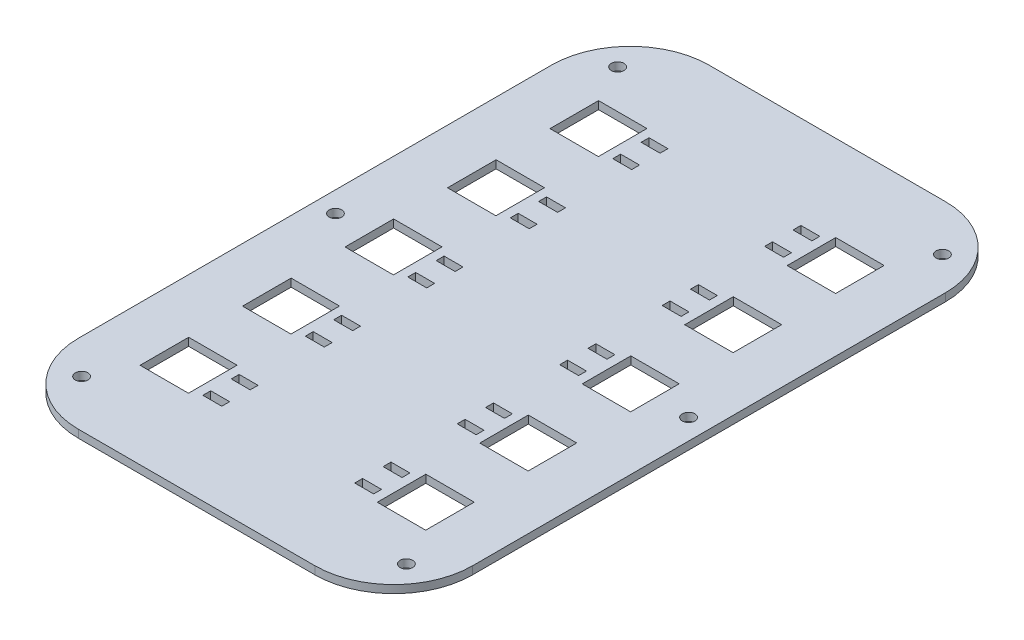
ISO-10303-21;
HEADER;
FILE_DESCRIPTION(('STEP AP214'),'2;1');
FILE_NAME('part.step','',(''),(''),'','','');
FILE_SCHEMA(('AUTOMOTIVE_DESIGN { 1 0 10303 214 1 1 1 1 }'));
ENDSEC;
DATA;
#1=APPLICATION_CONTEXT('core data for automotive mechanical design processes');
#2=APPLICATION_PROTOCOL_DEFINITION('international standard','automotive_design',2000,#1);
#3=PRODUCT_CONTEXT('',#1,'mechanical');
#4=PRODUCT('Part','Part','',(#3));
#5=PRODUCT_RELATED_PRODUCT_CATEGORY('part','',(#4));
#6=PRODUCT_DEFINITION_FORMATION('','',#4);
#7=PRODUCT_DEFINITION_CONTEXT('part definition',#1,'design');
#8=PRODUCT_DEFINITION('design','',#6,#7);
#9=PRODUCT_DEFINITION_SHAPE('','',#8);
#10=(LENGTH_UNIT() NAMED_UNIT(*) SI_UNIT(.MILLI.,.METRE.));
#11=(NAMED_UNIT(*) PLANE_ANGLE_UNIT() SI_UNIT($,.RADIAN.));
#12=(NAMED_UNIT(*) SI_UNIT($,.STERADIAN.) SOLID_ANGLE_UNIT());
#13=UNCERTAINTY_MEASURE_WITH_UNIT(LENGTH_MEASURE(1.E-05),#10,'distance_accuracy_value','');
#14=(GEOMETRIC_REPRESENTATION_CONTEXT(3) GLOBAL_UNCERTAINTY_ASSIGNED_CONTEXT((#13)) GLOBAL_UNIT_ASSIGNED_CONTEXT((#10,
#11,#12)) REPRESENTATION_CONTEXT('',''));
#15=CARTESIAN_POINT('',(0.,0.,0.));
#16=DIRECTION('',(0.,0.,1.));
#17=DIRECTION('',(1.,0.,0.));
#18=AXIS2_PLACEMENT_3D('',#15,#16,#17);
#19=CARTESIAN_POINT('',(0.,-5.,-123.08));
#20=DIRECTION('',(0.,0.,1.));
#21=DIRECTION('',(1.,0.,0.));
#22=AXIS2_PLACEMENT_3D('',#19,#20,#21);
#23=PLANE('',#22);
#24=DIRECTION('',(1.,0.,0.));
#25=VECTOR('',#24,1.);
#26=CARTESIAN_POINT('',(-75.,0.,-123.08));
#27=LINE('',#26,#25);
#28=CARTESIAN_POINT('',(42.1649999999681,0.,-123.08));
#29=VERTEX_POINT('',#28);
#30=CARTESIAN_POINT('',(54.1649999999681,0.,-123.08));
#31=VERTEX_POINT('',#30);
#32=EDGE_CURVE('E1813',#29,#31,#27,.T.);
#33=ORIENTED_EDGE('',*,*,#32,.T.);
#34=DIRECTION('',(0.,1.,0.));
#35=VECTOR('',#34,1.);
#36=CARTESIAN_POINT('',(54.1649999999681,-5.,-123.08));
#37=LINE('',#36,#35);
#38=CARTESIAN_POINT('',(54.1649999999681,5.,-123.08));
#39=VERTEX_POINT('',#38);
#40=EDGE_CURVE('E1830',#31,#39,#37,.T.);
#41=ORIENTED_EDGE('',*,*,#40,.T.);
#42=DIRECTION('',(1.,0.,0.));
#43=VECTOR('',#42,1.);
#44=CARTESIAN_POINT('',(0.,5.,-123.08));
#45=LINE('',#44,#43);
#46=CARTESIAN_POINT('',(42.1649999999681,5.,-123.08));
#47=VERTEX_POINT('',#46);
#48=EDGE_CURVE('E1826',#47,#39,#45,.T.);
#49=ORIENTED_EDGE('',*,*,#48,.F.);
#50=DIRECTION('',(0.,1.,0.));
#51=VECTOR('',#50,1.);
#52=CARTESIAN_POINT('',(42.1649999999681,-5.,-123.08));
#53=LINE('',#52,#51);
#54=EDGE_CURVE('E11',#29,#47,#53,.T.);
#55=ORIENTED_EDGE('',*,*,#54,.F.);
#56=EDGE_LOOP('',(#33,#41,#49,#55));
#57=FACE_BOUND('',#56,.T.);
#58=ADVANCED_FACE('F39',(#57),#23,.T.);
#59=CARTESIAN_POINT('',(42.1649999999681,-5.,-260.));
#60=DIRECTION('',(1.,0.,0.));
#61=DIRECTION('',(0.,0.,-1.));
#62=AXIS2_PLACEMENT_3D('',#59,#60,#61);
#63=PLANE('',#62);
#64=DIRECTION('',(0.,0.,-1.));
#65=VECTOR('',#64,1.);
#66=CARTESIAN_POINT('',(42.1649999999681,0.,-110.));
#67=LINE('',#66,#65);
#68=CARTESIAN_POINT('',(42.1649999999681,0.,-118.08));
#69=VERTEX_POINT('',#68);
#70=EDGE_CURVE('E1816',#69,#29,#67,.T.);
#71=ORIENTED_EDGE('',*,*,#70,.T.);
#72=ORIENTED_EDGE('',*,*,#54,.T.);
#73=DIRECTION('',(0.,0.,-1.));
#74=VECTOR('',#73,1.);
#75=CARTESIAN_POINT('',(42.1649999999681,5.,-260.));
#76=LINE('',#75,#74);
#77=CARTESIAN_POINT('',(42.1649999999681,5.,-118.08));
#78=VERTEX_POINT('',#77);
#79=EDGE_CURVE('E60',#78,#47,#76,.T.);
#80=ORIENTED_EDGE('',*,*,#79,.F.);
#81=DIRECTION('',(0.,1.,0.));
#82=VECTOR('',#81,1.);
#83=CARTESIAN_POINT('',(42.1649999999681,-5.,-118.08));
#84=LINE('',#83,#82);
#85=EDGE_CURVE('E46',#69,#78,#84,.T.);
#86=ORIENTED_EDGE('',*,*,#85,.F.);
#87=EDGE_LOOP('',(#71,#72,#80,#86));
#88=FACE_BOUND('',#87,.T.);
#89=ADVANCED_FACE('F1840',(#88),#63,.T.);
#90=CARTESIAN_POINT('',(0.,-5.,-118.08));
#91=DIRECTION('',(0.,0.,-1.));
#92=DIRECTION('',(-1.,0.,0.));
#93=AXIS2_PLACEMENT_3D('',#90,#91,#92);
#94=PLANE('',#93);
#95=DIRECTION('',(-1.,0.,0.));
#96=VECTOR('',#95,1.);
#97=CARTESIAN_POINT('',(-75.,0.,-118.08));
#98=LINE('',#97,#96);
#99=CARTESIAN_POINT('',(54.1649999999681,0.,-118.08));
#100=VERTEX_POINT('',#99);
#101=EDGE_CURVE('E1819',#100,#69,#98,.T.);
#102=ORIENTED_EDGE('',*,*,#101,.T.);
#103=ORIENTED_EDGE('',*,*,#85,.T.);
#104=DIRECTION('',(-1.,0.,0.));
#105=VECTOR('',#104,1.);
#106=CARTESIAN_POINT('',(0.,5.,-118.08));
#107=LINE('',#106,#105);
#108=CARTESIAN_POINT('',(54.1649999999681,5.,-118.08));
#109=VERTEX_POINT('',#108);
#110=EDGE_CURVE('E1823',#109,#78,#107,.T.);
#111=ORIENTED_EDGE('',*,*,#110,.F.);
#112=DIRECTION('',(0.,1.,0.));
#113=VECTOR('',#112,1.);
#114=CARTESIAN_POINT('',(54.1649999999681,-5.,-118.08));
#115=LINE('',#114,#113);
#116=EDGE_CURVE('E1828',#100,#109,#115,.T.);
#117=ORIENTED_EDGE('',*,*,#116,.F.);
#118=EDGE_LOOP('',(#102,#103,#111,#117));
#119=FACE_BOUND('',#118,.T.);
#120=ADVANCED_FACE('F1836',(#119),#94,.T.);
#121=CARTESIAN_POINT('',(54.1649999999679,-5.,-260.));
#122=DIRECTION('',(-1.,0.,0.));
#123=DIRECTION('',(0.,0.,1.));
#124=AXIS2_PLACEMENT_3D('',#121,#122,#123);
#125=PLANE('',#124);
#126=DIRECTION('',(0.,0.,1.));
#127=VECTOR('',#126,1.);
#128=CARTESIAN_POINT('',(54.1649999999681,0.,-110.));
#129=LINE('',#128,#127);
#130=EDGE_CURVE('E1811',#31,#100,#129,.T.);
#131=ORIENTED_EDGE('',*,*,#130,.T.);
#132=ORIENTED_EDGE('',*,*,#116,.T.);
#133=DIRECTION('',(0.,0.,1.));
#134=VECTOR('',#133,1.);
#135=CARTESIAN_POINT('',(54.1649999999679,5.,-260.));
#136=LINE('',#135,#134);
#137=EDGE_CURVE('E53',#39,#109,#136,.T.);
#138=ORIENTED_EDGE('',*,*,#137,.F.);
#139=ORIENTED_EDGE('',*,*,#40,.F.);
#140=EDGE_LOOP('',(#131,#132,#138,#139));
#141=FACE_BOUND('',#140,.T.);
#142=ADVANCED_FACE('F1868',(#141),#125,.T.);
#143=CARTESIAN_POINT('',(0.,-5.,-58.0799999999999));
#144=DIRECTION('',(0.,0.,1.));
#145=DIRECTION('',(1.,0.,0.));
#146=AXIS2_PLACEMENT_3D('',#143,#144,#145);
#147=PLANE('',#146);
#148=DIRECTION('',(1.,0.,0.));
#149=VECTOR('',#148,1.);
#150=CARTESIAN_POINT('',(-75.,0.,-58.0799999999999));
#151=LINE('',#150,#149);
#152=CARTESIAN_POINT('',(42.1649999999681,0.,-58.0799999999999));
#153=VERTEX_POINT('',#152);
#154=CARTESIAN_POINT('',(54.1649999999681,0.,-58.0799999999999));
#155=VERTEX_POINT('',#154);
#156=EDGE_CURVE('E1781',#153,#155,#151,.T.);
#157=ORIENTED_EDGE('',*,*,#156,.T.);
#158=DIRECTION('',(0.,1.,0.));
#159=VECTOR('',#158,1.);
#160=CARTESIAN_POINT('',(54.1649999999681,-5.,-58.0799999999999));
#161=LINE('',#160,#159);
#162=CARTESIAN_POINT('',(54.1649999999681,5.,-58.0799999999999));
#163=VERTEX_POINT('',#162);
#164=EDGE_CURVE('E1802',#155,#163,#161,.T.);
#165=ORIENTED_EDGE('',*,*,#164,.T.);
#166=DIRECTION('',(1.,0.,0.));
#167=VECTOR('',#166,1.);
#168=CARTESIAN_POINT('',(0.,5.,-58.0799999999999));
#169=LINE('',#168,#167);
#170=CARTESIAN_POINT('',(42.1649999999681,5.,-58.0799999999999));
#171=VERTEX_POINT('',#170);
#172=EDGE_CURVE('E1796',#171,#163,#169,.T.);
#173=ORIENTED_EDGE('',*,*,#172,.F.);
#174=DIRECTION('',(0.,1.,0.));
#175=VECTOR('',#174,1.);
#176=CARTESIAN_POINT('',(42.1649999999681,-5.,-58.0799999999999));
#177=LINE('',#176,#175);
#178=EDGE_CURVE('E1808',#153,#171,#177,.T.);
#179=ORIENTED_EDGE('',*,*,#178,.F.);
#180=EDGE_LOOP('',(#157,#165,#173,#179));
#181=FACE_BOUND('',#180,.T.);
#182=ADVANCED_FACE('F1873',(#181),#147,.T.);
#183=CARTESIAN_POINT('',(42.1649999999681,-5.,-195.));
#184=DIRECTION('',(1.,0.,0.));
#185=DIRECTION('',(0.,0.,-1.));
#186=AXIS2_PLACEMENT_3D('',#183,#184,#185);
#187=PLANE('',#186);
#188=DIRECTION('',(0.,0.,-1.));
#189=VECTOR('',#188,1.);
#190=CARTESIAN_POINT('',(42.1649999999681,0.,-45.));
#191=LINE('',#190,#189);
#192=CARTESIAN_POINT('',(42.1649999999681,0.,-53.0799999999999));
#193=VERTEX_POINT('',#192);
#194=EDGE_CURVE('E1784',#193,#153,#191,.T.);
#195=ORIENTED_EDGE('',*,*,#194,.T.);
#196=ORIENTED_EDGE('',*,*,#178,.T.);
#197=DIRECTION('',(0.,0.,-1.));
#198=VECTOR('',#197,1.);
#199=CARTESIAN_POINT('',(42.1649999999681,5.,-195.));
#200=LINE('',#199,#198);
#201=CARTESIAN_POINT('',(42.1649999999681,5.,-53.0799999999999));
#202=VERTEX_POINT('',#201);
#203=EDGE_CURVE('E1794',#202,#171,#200,.T.);
#204=ORIENTED_EDGE('',*,*,#203,.F.);
#205=DIRECTION('',(0.,1.,0.));
#206=VECTOR('',#205,1.);
#207=CARTESIAN_POINT('',(42.1649999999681,-5.,-53.0799999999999));
#208=LINE('',#207,#206);
#209=EDGE_CURVE('E1805',#193,#202,#208,.T.);
#210=ORIENTED_EDGE('',*,*,#209,.F.);
#211=EDGE_LOOP('',(#195,#196,#204,#210));
#212=FACE_BOUND('',#211,.T.);
#213=ADVANCED_FACE('F1876',(#212),#187,.T.);
#214=CARTESIAN_POINT('',(0.,-5.,-53.0799999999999));
#215=DIRECTION('',(0.,0.,-1.));
#216=DIRECTION('',(-1.,0.,0.));
#217=AXIS2_PLACEMENT_3D('',#214,#215,#216);
#218=PLANE('',#217);
#219=DIRECTION('',(-1.,0.,0.));
#220=VECTOR('',#219,1.);
#221=CARTESIAN_POINT('',(-75.,0.,-53.0799999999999));
#222=LINE('',#221,#220);
#223=CARTESIAN_POINT('',(54.1649999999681,0.,-53.0799999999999));
#224=VERTEX_POINT('',#223);
#225=EDGE_CURVE('E1787',#224,#193,#222,.T.);
#226=ORIENTED_EDGE('',*,*,#225,.T.);
#227=ORIENTED_EDGE('',*,*,#209,.T.);
#228=DIRECTION('',(-1.,0.,0.));
#229=VECTOR('',#228,1.);
#230=CARTESIAN_POINT('',(0.,5.,-53.0799999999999));
#231=LINE('',#230,#229);
#232=CARTESIAN_POINT('',(54.1649999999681,5.,-53.0799999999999));
#233=VERTEX_POINT('',#232);
#234=EDGE_CURVE('E1792',#233,#202,#231,.T.);
#235=ORIENTED_EDGE('',*,*,#234,.F.);
#236=DIRECTION('',(0.,1.,0.));
#237=VECTOR('',#236,1.);
#238=CARTESIAN_POINT('',(54.1649999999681,-5.,-53.0799999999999));
#239=LINE('',#238,#237);
#240=EDGE_CURVE('E1799',#224,#233,#239,.T.);
#241=ORIENTED_EDGE('',*,*,#240,.F.);
#242=EDGE_LOOP('',(#226,#227,#235,#241));
#243=FACE_BOUND('',#242,.T.);
#244=ADVANCED_FACE('F1880',(#243),#218,.T.);
#245=CARTESIAN_POINT('',(54.1649999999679,-5.,-195.));
#246=DIRECTION('',(-1.,0.,0.));
#247=DIRECTION('',(0.,0.,1.));
#248=AXIS2_PLACEMENT_3D('',#245,#246,#247);
#249=PLANE('',#248);
#250=DIRECTION('',(0.,0.,1.));
#251=VECTOR('',#250,1.);
#252=CARTESIAN_POINT('',(54.1649999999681,0.,-45.0000000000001));
#253=LINE('',#252,#251);
#254=EDGE_CURVE('E1779',#155,#224,#253,.T.);
#255=ORIENTED_EDGE('',*,*,#254,.T.);
#256=ORIENTED_EDGE('',*,*,#240,.T.);
#257=DIRECTION('',(0.,0.,1.));
#258=VECTOR('',#257,1.);
#259=CARTESIAN_POINT('',(54.1649999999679,5.,-195.));
#260=LINE('',#259,#258);
#261=EDGE_CURVE('E1790',#163,#233,#260,.T.);
#262=ORIENTED_EDGE('',*,*,#261,.F.);
#263=ORIENTED_EDGE('',*,*,#164,.F.);
#264=EDGE_LOOP('',(#255,#256,#262,#263));
#265=FACE_BOUND('',#264,.T.);
#266=ADVANCED_FACE('F1884',(#265),#249,.T.);
#267=CARTESIAN_POINT('',(0.,-5.,6.92000000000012));
#268=DIRECTION('',(0.,0.,1.));
#269=DIRECTION('',(1.,0.,0.));
#270=AXIS2_PLACEMENT_3D('',#267,#268,#269);
#271=PLANE('',#270);
#272=DIRECTION('',(1.,0.,0.));
#273=VECTOR('',#272,1.);
#274=CARTESIAN_POINT('',(-75.,0.,6.92000000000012));
#275=LINE('',#274,#273);
#276=CARTESIAN_POINT('',(42.1649999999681,0.,6.92000000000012));
#277=VERTEX_POINT('',#276);
#278=CARTESIAN_POINT('',(54.1649999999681,0.,6.92000000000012));
#279=VERTEX_POINT('',#278);
#280=EDGE_CURVE('E1749',#277,#279,#275,.T.);
#281=ORIENTED_EDGE('',*,*,#280,.T.);
#282=DIRECTION('',(0.,1.,0.));
#283=VECTOR('',#282,1.);
#284=CARTESIAN_POINT('',(54.1649999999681,-5.,6.92000000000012));
#285=LINE('',#284,#283);
#286=CARTESIAN_POINT('',(54.1649999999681,5.,6.92000000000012));
#287=VERTEX_POINT('',#286);
#288=EDGE_CURVE('E1770',#279,#287,#285,.T.);
#289=ORIENTED_EDGE('',*,*,#288,.T.);
#290=DIRECTION('',(1.,0.,0.));
#291=VECTOR('',#290,1.);
#292=CARTESIAN_POINT('',(0.,5.,6.92000000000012));
#293=LINE('',#292,#291);
#294=CARTESIAN_POINT('',(42.1649999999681,5.,6.92000000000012));
#295=VERTEX_POINT('',#294);
#296=EDGE_CURVE('E1764',#295,#287,#293,.T.);
#297=ORIENTED_EDGE('',*,*,#296,.F.);
#298=DIRECTION('',(0.,1.,0.));
#299=VECTOR('',#298,1.);
#300=CARTESIAN_POINT('',(42.1649999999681,-5.,6.92000000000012));
#301=LINE('',#300,#299);
#302=EDGE_CURVE('E1776',#277,#295,#301,.T.);
#303=ORIENTED_EDGE('',*,*,#302,.F.);
#304=EDGE_LOOP('',(#281,#289,#297,#303));
#305=FACE_BOUND('',#304,.T.);
#306=ADVANCED_FACE('F1888',(#305),#271,.T.);
#307=CARTESIAN_POINT('',(42.1649999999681,-5.,-130.));
#308=DIRECTION('',(1.,0.,0.));
#309=DIRECTION('',(0.,0.,-1.));
#310=AXIS2_PLACEMENT_3D('',#307,#308,#309);
#311=PLANE('',#310);
#312=DIRECTION('',(0.,0.,-1.));
#313=VECTOR('',#312,1.);
#314=CARTESIAN_POINT('',(42.1649999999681,0.,20.));
#315=LINE('',#314,#313);
#316=CARTESIAN_POINT('',(42.1649999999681,0.,11.9200000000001));
#317=VERTEX_POINT('',#316);
#318=EDGE_CURVE('E1752',#317,#277,#315,.T.);
#319=ORIENTED_EDGE('',*,*,#318,.T.);
#320=ORIENTED_EDGE('',*,*,#302,.T.);
#321=DIRECTION('',(0.,0.,-1.));
#322=VECTOR('',#321,1.);
#323=CARTESIAN_POINT('',(42.1649999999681,5.,-130.));
#324=LINE('',#323,#322);
#325=CARTESIAN_POINT('',(42.1649999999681,5.,11.9200000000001));
#326=VERTEX_POINT('',#325);
#327=EDGE_CURVE('E1762',#326,#295,#324,.T.);
#328=ORIENTED_EDGE('',*,*,#327,.F.);
#329=DIRECTION('',(0.,1.,0.));
#330=VECTOR('',#329,1.);
#331=CARTESIAN_POINT('',(42.1649999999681,-5.,11.9200000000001));
#332=LINE('',#331,#330);
#333=EDGE_CURVE('E1773',#317,#326,#332,.T.);
#334=ORIENTED_EDGE('',*,*,#333,.F.);
#335=EDGE_LOOP('',(#319,#320,#328,#334));
#336=FACE_BOUND('',#335,.T.);
#337=ADVANCED_FACE('F1892',(#336),#311,.T.);
#338=CARTESIAN_POINT('',(0.,-5.,11.9200000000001));
#339=DIRECTION('',(0.,0.,-1.));
#340=DIRECTION('',(-1.,0.,0.));
#341=AXIS2_PLACEMENT_3D('',#338,#339,#340);
#342=PLANE('',#341);
#343=DIRECTION('',(-1.,0.,0.));
#344=VECTOR('',#343,1.);
#345=CARTESIAN_POINT('',(-75.,0.,11.9200000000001));
#346=LINE('',#345,#344);
#347=CARTESIAN_POINT('',(54.1649999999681,0.,11.9200000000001));
#348=VERTEX_POINT('',#347);
#349=EDGE_CURVE('E1755',#348,#317,#346,.T.);
#350=ORIENTED_EDGE('',*,*,#349,.T.);
#351=ORIENTED_EDGE('',*,*,#333,.T.);
#352=DIRECTION('',(-1.,0.,0.));
#353=VECTOR('',#352,1.);
#354=CARTESIAN_POINT('',(0.,5.,11.9200000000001));
#355=LINE('',#354,#353);
#356=CARTESIAN_POINT('',(54.1649999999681,5.,11.9200000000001));
#357=VERTEX_POINT('',#356);
#358=EDGE_CURVE('E1760',#357,#326,#355,.T.);
#359=ORIENTED_EDGE('',*,*,#358,.F.);
#360=DIRECTION('',(0.,1.,0.));
#361=VECTOR('',#360,1.);
#362=CARTESIAN_POINT('',(54.1649999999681,-5.,11.9200000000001));
#363=LINE('',#362,#361);
#364=EDGE_CURVE('E1767',#348,#357,#363,.T.);
#365=ORIENTED_EDGE('',*,*,#364,.F.);
#366=EDGE_LOOP('',(#350,#351,#359,#365));
#367=FACE_BOUND('',#366,.T.);
#368=ADVANCED_FACE('F1896',(#367),#342,.T.);
#369=CARTESIAN_POINT('',(54.1649999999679,-5.,-130.));
#370=DIRECTION('',(-1.,0.,0.));
#371=DIRECTION('',(0.,0.,1.));
#372=AXIS2_PLACEMENT_3D('',#369,#370,#371);
#373=PLANE('',#372);
#374=DIRECTION('',(0.,0.,1.));
#375=VECTOR('',#374,1.);
#376=CARTESIAN_POINT('',(54.1649999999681,0.,19.9999999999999));
#377=LINE('',#376,#375);
#378=EDGE_CURVE('E1747',#279,#348,#377,.T.);
#379=ORIENTED_EDGE('',*,*,#378,.T.);
#380=ORIENTED_EDGE('',*,*,#364,.T.);
#381=DIRECTION('',(0.,0.,1.));
#382=VECTOR('',#381,1.);
#383=CARTESIAN_POINT('',(54.1649999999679,5.,-130.));
#384=LINE('',#383,#382);
#385=EDGE_CURVE('E1758',#287,#357,#384,.T.);
#386=ORIENTED_EDGE('',*,*,#385,.F.);
#387=ORIENTED_EDGE('',*,*,#288,.F.);
#388=EDGE_LOOP('',(#379,#380,#386,#387));
#389=FACE_BOUND('',#388,.T.);
#390=ADVANCED_FACE('F1855',(#389),#373,.T.);
#391=CARTESIAN_POINT('',(-75.,0.,150.));
#392=DIRECTION('',(0.,1.,0.));
#393=DIRECTION('',(0.,0.,1.));
#394=AXIS2_PLACEMENT_3D('',#391,#392,#393);
#395=PLANE('',#394);
#396=CARTESIAN_POINT('',(112.,0.,0.));
#397=DIRECTION('',(0.,1.,0.));
#398=DIRECTION('',(0.,0.,1.));
#399=AXIS2_PLACEMENT_3D('',#396,#397,#398);
#400=CIRCLE('',#399,4.00000000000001);
#401=CARTESIAN_POINT('',(112.,0.,4.00000000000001));
#402=VERTEX_POINT('',#401);
#403=EDGE_CURVE('E3596',#402,#402,#400,.T.);
#404=ORIENTED_EDGE('',*,*,#403,.T.);
#405=EDGE_LOOP('',(#404));
#406=FACE_BOUND('',#405,.T.);
#407=CARTESIAN_POINT('',(-112.,0.,0.));
#408=DIRECTION('',(0.,1.,0.));
#409=DIRECTION('',(0.,0.,1.));
#410=AXIS2_PLACEMENT_3D('',#407,#408,#409);
#411=CIRCLE('',#410,4.00000000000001);
#412=CARTESIAN_POINT('',(-112.,0.,4.00000000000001));
#413=VERTEX_POINT('',#412);
#414=EDGE_CURVE('E3599',#413,#413,#411,.T.);
#415=ORIENTED_EDGE('',*,*,#414,.T.);
#416=EDGE_LOOP('',(#415));
#417=FACE_BOUND('',#416,.T.);
#418=CARTESIAN_POINT('',(-103.,0.,170.));
#419=DIRECTION('',(0.,1.,0.));
#420=DIRECTION('',(0.,0.,1.));
#421=AXIS2_PLACEMENT_3D('',#418,#419,#420);
#422=CIRCLE('',#421,4.00000000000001);
#423=CARTESIAN_POINT('',(-103.,0.,174.));
#424=VERTEX_POINT('',#423);
#425=EDGE_CURVE('E3630',#424,#424,#422,.T.);
#426=ORIENTED_EDGE('',*,*,#425,.T.);
#427=EDGE_LOOP('',(#426));
#428=FACE_BOUND('',#427,.T.);
#429=CARTESIAN_POINT('',(103.,0.,170.));
#430=DIRECTION('',(0.,1.,0.));
#431=DIRECTION('',(0.,0.,1.));
#432=AXIS2_PLACEMENT_3D('',#429,#430,#431);
#433=CIRCLE('',#432,4.00000000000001);
#434=CARTESIAN_POINT('',(103.,0.,174.));
#435=VERTEX_POINT('',#434);
#436=EDGE_CURVE('E3624',#435,#435,#433,.T.);
#437=ORIENTED_EDGE('',*,*,#436,.T.);
#438=EDGE_LOOP('',(#437));
#439=FACE_BOUND('',#438,.T.);
#440=CARTESIAN_POINT('',(103.,0.,-170.));
#441=DIRECTION('',(0.,1.,0.));
#442=DIRECTION('',(0.,0.,1.));
#443=AXIS2_PLACEMENT_3D('',#440,#441,#442);
#444=CIRCLE('',#443,4.00000000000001);
#445=CARTESIAN_POINT('',(103.,0.,-166.));
#446=VERTEX_POINT('',#445);
#447=EDGE_CURVE('E3614',#446,#446,#444,.T.);
#448=ORIENTED_EDGE('',*,*,#447,.T.);
#449=EDGE_LOOP('',(#448));
#450=FACE_BOUND('',#449,.T.);
#451=CARTESIAN_POINT('',(-103.,0.,-170.));
#452=DIRECTION('',(0.,1.,0.));
#453=DIRECTION('',(0.,0.,1.));
#454=AXIS2_PLACEMENT_3D('',#451,#452,#453);
#455=CIRCLE('',#454,4.00000000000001);
#456=CARTESIAN_POINT('',(-103.,0.,-166.));
#457=VERTEX_POINT('',#456);
#458=EDGE_CURVE('E836',#457,#457,#455,.T.);
#459=ORIENTED_EDGE('',*,*,#458,.T.);
#460=EDGE_LOOP('',(#459));
#461=FACE_BOUND('',#460,.T.);
#462=DIRECTION('',(0.,0.,1.));
#463=VECTOR('',#462,1.);
#464=CARTESIAN_POINT('',(54.1649999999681,0.,-110.));
#465=LINE('',#464,#463);
#466=CARTESIAN_POINT('',(54.1649999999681,0.,-141.08));
#467=VERTEX_POINT('',#466);
#468=CARTESIAN_POINT('',(54.1649999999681,0.,-136.08));
#469=VERTEX_POINT('',#468);
#470=EDGE_CURVE('E1715',#467,#469,#465,.T.);
#471=ORIENTED_EDGE('',*,*,#470,.F.);
#472=DIRECTION('',(-1.,0.,0.));
#473=VECTOR('',#472,1.);
#474=CARTESIAN_POINT('',(-75.,0.,-141.08));
#475=LINE('',#474,#473);
#476=CARTESIAN_POINT('',(42.1649999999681,0.,-141.08));
#477=VERTEX_POINT('',#476);
#478=EDGE_CURVE('E1717',#467,#477,#475,.T.);
#479=ORIENTED_EDGE('',*,*,#478,.T.);
#480=DIRECTION('',(0.,0.,1.));
#481=VECTOR('',#480,1.);
#482=CARTESIAN_POINT('',(42.1649999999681,0.,-110.));
#483=LINE('',#482,#481);
#484=CARTESIAN_POINT('',(42.1649999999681,0.,-136.08));
#485=VERTEX_POINT('',#484);
#486=EDGE_CURVE('E1719',#477,#485,#483,.T.);
#487=ORIENTED_EDGE('',*,*,#486,.T.);
#488=DIRECTION('',(1.,0.,0.));
#489=VECTOR('',#488,1.);
#490=CARTESIAN_POINT('',(-75.,0.,-136.08));
#491=LINE('',#490,#489);
#492=EDGE_CURVE('E1721',#485,#469,#491,.T.);
#493=ORIENTED_EDGE('',*,*,#492,.T.);
#494=EDGE_LOOP('',(#471,#479,#487,#493));
#495=FACE_BOUND('',#494,.T.);
#496=DIRECTION('',(0.,0.,1.));
#497=VECTOR('',#496,1.);
#498=CARTESIAN_POINT('',(54.1649999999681,0.,-45.));
#499=LINE('',#498,#497);
#500=CARTESIAN_POINT('',(54.1649999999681,0.,-76.0799999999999));
#501=VERTEX_POINT('',#500);
#502=CARTESIAN_POINT('',(54.1649999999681,0.,-71.0799999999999));
#503=VERTEX_POINT('',#502);
#504=EDGE_CURVE('E1683',#501,#503,#499,.T.);
#505=ORIENTED_EDGE('',*,*,#504,.F.);
#506=DIRECTION('',(-1.,0.,0.));
#507=VECTOR('',#506,1.);
#508=CARTESIAN_POINT('',(-75.,0.,-76.0799999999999));
#509=LINE('',#508,#507);
#510=CARTESIAN_POINT('',(42.1649999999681,0.,-76.0799999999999));
#511=VERTEX_POINT('',#510);
#512=EDGE_CURVE('E1685',#501,#511,#509,.T.);
#513=ORIENTED_EDGE('',*,*,#512,.T.);
#514=DIRECTION('',(0.,0.,1.));
#515=VECTOR('',#514,1.);
#516=CARTESIAN_POINT('',(42.1649999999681,0.,-45.));
#517=LINE('',#516,#515);
#518=CARTESIAN_POINT('',(42.1649999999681,0.,-71.0799999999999));
#519=VERTEX_POINT('',#518);
#520=EDGE_CURVE('E1687',#511,#519,#517,.T.);
#521=ORIENTED_EDGE('',*,*,#520,.T.);
#522=DIRECTION('',(1.,0.,0.));
#523=VECTOR('',#522,1.);
#524=CARTESIAN_POINT('',(-75.,0.,-71.0799999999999));
#525=LINE('',#524,#523);
#526=EDGE_CURVE('E1689',#519,#503,#525,.T.);
#527=ORIENTED_EDGE('',*,*,#526,.T.);
#528=EDGE_LOOP('',(#505,#513,#521,#527));
#529=FACE_BOUND('',#528,.T.);
#530=DIRECTION('',(0.,0.,1.));
#531=VECTOR('',#530,1.);
#532=CARTESIAN_POINT('',(54.1649999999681,0.,20.));
#533=LINE('',#532,#531);
#534=CARTESIAN_POINT('',(54.1649999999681,0.,-11.0799999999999));
#535=VERTEX_POINT('',#534);
#536=CARTESIAN_POINT('',(54.1649999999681,0.,-6.07999999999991));
#537=VERTEX_POINT('',#536);
#538=EDGE_CURVE('E1651',#535,#537,#533,.T.);
#539=ORIENTED_EDGE('',*,*,#538,.F.);
#540=DIRECTION('',(-1.,0.,0.));
#541=VECTOR('',#540,1.);
#542=CARTESIAN_POINT('',(-75.,0.,-11.0799999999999));
#543=LINE('',#542,#541);
#544=CARTESIAN_POINT('',(42.1649999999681,0.,-11.0799999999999));
#545=VERTEX_POINT('',#544);
#546=EDGE_CURVE('E1653',#535,#545,#543,.T.);
#547=ORIENTED_EDGE('',*,*,#546,.T.);
#548=DIRECTION('',(0.,0.,1.));
#549=VECTOR('',#548,1.);
#550=CARTESIAN_POINT('',(42.1649999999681,0.,20.));
#551=LINE('',#550,#549);
#552=CARTESIAN_POINT('',(42.1649999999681,0.,-6.07999999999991));
#553=VERTEX_POINT('',#552);
#554=EDGE_CURVE('E1655',#545,#553,#551,.T.);
#555=ORIENTED_EDGE('',*,*,#554,.T.);
#556=DIRECTION('',(1.,0.,0.));
#557=VECTOR('',#556,1.);
#558=CARTESIAN_POINT('',(-75.,0.,-6.07999999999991));
#559=LINE('',#558,#557);
#560=EDGE_CURVE('E1657',#553,#537,#559,.T.);
#561=ORIENTED_EDGE('',*,*,#560,.T.);
#562=EDGE_LOOP('',(#539,#547,#555,#561));
#563=FACE_BOUND('',#562,.T.);
#564=DIRECTION('',(0.,0.,1.));
#565=VECTOR('',#564,1.);
#566=CARTESIAN_POINT('',(54.1649999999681,0.,85.));
#567=LINE('',#566,#565);
#568=CARTESIAN_POINT('',(54.1649999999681,0.,53.9200000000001));
#569=VERTEX_POINT('',#568);
#570=CARTESIAN_POINT('',(54.1649999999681,0.,58.9200000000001));
#571=VERTEX_POINT('',#570);
#572=EDGE_CURVE('E885',#569,#571,#567,.T.);
#573=ORIENTED_EDGE('',*,*,#572,.F.);
#574=DIRECTION('',(-1.,0.,0.));
#575=VECTOR('',#574,1.);
#576=CARTESIAN_POINT('',(-75.,0.,53.9200000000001));
#577=LINE('',#576,#575);
#578=CARTESIAN_POINT('',(42.1649999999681,0.,53.9200000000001));
#579=VERTEX_POINT('',#578);
#580=EDGE_CURVE('E860',#569,#579,#577,.T.);
#581=ORIENTED_EDGE('',*,*,#580,.T.);
#582=DIRECTION('',(0.,0.,1.));
#583=VECTOR('',#582,1.);
#584=CARTESIAN_POINT('',(42.1649999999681,0.,85.));
#585=LINE('',#584,#583);
#586=CARTESIAN_POINT('',(42.1649999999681,0.,58.9200000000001));
#587=VERTEX_POINT('',#586);
#588=EDGE_CURVE('E874',#579,#587,#585,.T.);
#589=ORIENTED_EDGE('',*,*,#588,.T.);
#590=DIRECTION('',(1.,0.,0.));
#591=VECTOR('',#590,1.);
#592=CARTESIAN_POINT('',(-75.,0.,58.9200000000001));
#593=LINE('',#592,#591);
#594=EDGE_CURVE('E882',#587,#571,#593,.T.);
#595=ORIENTED_EDGE('',*,*,#594,.T.);
#596=EDGE_LOOP('',(#573,#581,#589,#595));
#597=FACE_BOUND('',#596,.T.);
#598=DIRECTION('',(0.,0.,1.));
#599=VECTOR('',#598,1.);
#600=CARTESIAN_POINT('',(-54.1649999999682,0.,85.0000000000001));
#601=LINE('',#600,#599);
#602=CARTESIAN_POINT('',(-54.1649999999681,0.,71.9200000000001));
#603=VERTEX_POINT('',#602);
#604=CARTESIAN_POINT('',(-54.1649999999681,0.,76.9200000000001));
#605=VERTEX_POINT('',#604);
#606=EDGE_CURVE('E915',#603,#605,#601,.T.);
#607=ORIENTED_EDGE('',*,*,#606,.T.);
#608=DIRECTION('',(1.,0.,0.));
#609=VECTOR('',#608,1.);
#610=CARTESIAN_POINT('',(-75.,0.,76.9200000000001));
#611=LINE('',#610,#609);
#612=CARTESIAN_POINT('',(-42.1649999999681,0.,76.9200000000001));
#613=VERTEX_POINT('',#612);
#614=EDGE_CURVE('E920',#605,#613,#611,.T.);
#615=ORIENTED_EDGE('',*,*,#614,.T.);
#616=DIRECTION('',(0.,0.,-1.));
#617=VECTOR('',#616,1.);
#618=CARTESIAN_POINT('',(-42.1649999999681,0.,85.));
#619=LINE('',#618,#617);
#620=CARTESIAN_POINT('',(-42.1649999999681,0.,71.9200000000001));
#621=VERTEX_POINT('',#620);
#622=EDGE_CURVE('E893',#613,#621,#619,.T.);
#623=ORIENTED_EDGE('',*,*,#622,.T.);
#624=DIRECTION('',(-1.,0.,0.));
#625=VECTOR('',#624,1.);
#626=CARTESIAN_POINT('',(-75.,0.,71.9200000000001));
#627=LINE('',#626,#625);
#628=EDGE_CURVE('E907',#621,#603,#627,.T.);
#629=ORIENTED_EDGE('',*,*,#628,.T.);
#630=EDGE_LOOP('',(#607,#615,#623,#629));
#631=FACE_BOUND('',#630,.T.);
#632=DIRECTION('',(0.,0.,1.));
#633=VECTOR('',#632,1.);
#634=CARTESIAN_POINT('',(-42.1649999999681,0.,150.));
#635=LINE('',#634,#633);
#636=CARTESIAN_POINT('',(-42.1649999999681,0.,118.92));
#637=VERTEX_POINT('',#636);
#638=CARTESIAN_POINT('',(-42.1649999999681,0.,123.92));
#639=VERTEX_POINT('',#638);
#640=EDGE_CURVE('E1079',#637,#639,#635,.T.);
#641=ORIENTED_EDGE('',*,*,#640,.F.);
#642=DIRECTION('',(1.,0.,0.));
#643=VECTOR('',#642,1.);
#644=CARTESIAN_POINT('',(-75.,0.,118.92));
#645=LINE('',#644,#643);
#646=CARTESIAN_POINT('',(-54.1649999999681,0.,118.92));
#647=VERTEX_POINT('',#646);
#648=EDGE_CURVE('E1072',#647,#637,#645,.T.);
#649=ORIENTED_EDGE('',*,*,#648,.F.);
#650=DIRECTION('',(0.,0.,1.));
#651=VECTOR('',#650,1.);
#652=CARTESIAN_POINT('',(-54.1649999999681,0.,150.));
#653=LINE('',#652,#651);
#654=CARTESIAN_POINT('',(-54.1649999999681,0.,123.92));
#655=VERTEX_POINT('',#654);
#656=EDGE_CURVE('E1074',#647,#655,#653,.T.);
#657=ORIENTED_EDGE('',*,*,#656,.T.);
#658=DIRECTION('',(-1.,0.,0.));
#659=VECTOR('',#658,1.);
#660=CARTESIAN_POINT('',(-75.,0.,123.92));
#661=LINE('',#660,#659);
#662=EDGE_CURVE('E1077',#639,#655,#661,.T.);
#663=ORIENTED_EDGE('',*,*,#662,.F.);
#664=EDGE_LOOP('',(#641,#649,#657,#663));
#665=FACE_BOUND('',#664,.T.);
#666=DIRECTION('',(0.,0.,1.));
#667=VECTOR('',#666,1.);
#668=CARTESIAN_POINT('',(54.1649999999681,0.,150.));
#669=LINE('',#668,#667);
#670=CARTESIAN_POINT('',(54.1649999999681,0.,118.92));
#671=VERTEX_POINT('',#670);
#672=CARTESIAN_POINT('',(54.1649999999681,0.,123.92));
#673=VERTEX_POINT('',#672);
#674=EDGE_CURVE('E1061',#671,#673,#669,.T.);
#675=ORIENTED_EDGE('',*,*,#674,.F.);
#676=DIRECTION('',(-1.,0.,0.));
#677=VECTOR('',#676,1.);
#678=CARTESIAN_POINT('',(-75.,0.,118.92));
#679=LINE('',#678,#677);
#680=CARTESIAN_POINT('',(42.1649999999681,0.,118.92));
#681=VERTEX_POINT('',#680);
#682=EDGE_CURVE('E1052',#671,#681,#679,.T.);
#683=ORIENTED_EDGE('',*,*,#682,.T.);
#684=DIRECTION('',(0.,0.,1.));
#685=VECTOR('',#684,1.);
#686=CARTESIAN_POINT('',(42.1649999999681,0.,150.));
#687=LINE('',#686,#685);
#688=CARTESIAN_POINT('',(42.1649999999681,0.,123.92));
#689=VERTEX_POINT('',#688);
#690=EDGE_CURVE('E1055',#681,#689,#687,.T.);
#691=ORIENTED_EDGE('',*,*,#690,.T.);
#692=DIRECTION('',(1.,0.,0.));
#693=VECTOR('',#692,1.);
#694=CARTESIAN_POINT('',(-75.,0.,123.92));
#695=LINE('',#694,#693);
#696=EDGE_CURVE('E1058',#689,#673,#695,.T.);
#697=ORIENTED_EDGE('',*,*,#696,.T.);
#698=EDGE_LOOP('',(#675,#683,#691,#697));
#699=FACE_BOUND('',#698,.T.);
#700=DIRECTION('',(0.,0.,1.));
#701=VECTOR('',#700,1.);
#702=CARTESIAN_POINT('',(-54.1649999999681,0.,150.));
#703=LINE('',#702,#701);
#704=CARTESIAN_POINT('',(-54.1649999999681,0.,136.92));
#705=VERTEX_POINT('',#704);
#706=CARTESIAN_POINT('',(-54.1649999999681,0.,141.92));
#707=VERTEX_POINT('',#706);
#708=EDGE_CURVE('E1046',#705,#707,#703,.T.);
#709=ORIENTED_EDGE('',*,*,#708,.T.);
#710=DIRECTION('',(1.,0.,0.));
#711=VECTOR('',#710,1.);
#712=CARTESIAN_POINT('',(-75.,0.,141.92));
#713=LINE('',#712,#711);
#714=CARTESIAN_POINT('',(-42.1649999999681,0.,141.92));
#715=VERTEX_POINT('',#714);
#716=EDGE_CURVE('E1049',#707,#715,#713,.T.);
#717=ORIENTED_EDGE('',*,*,#716,.T.);
#718=DIRECTION('',(0.,0.,-1.));
#719=VECTOR('',#718,1.);
#720=CARTESIAN_POINT('',(-42.1649999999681,0.,150.));
#721=LINE('',#720,#719);
#722=CARTESIAN_POINT('',(-42.1649999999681,0.,136.92));
#723=VERTEX_POINT('',#722);
#724=EDGE_CURVE('E1034',#715,#723,#721,.T.);
#725=ORIENTED_EDGE('',*,*,#724,.T.);
#726=DIRECTION('',(-1.,0.,0.));
#727=VECTOR('',#726,1.);
#728=CARTESIAN_POINT('',(-75.,0.,136.92));
#729=LINE('',#728,#727);
#730=EDGE_CURVE('E1043',#723,#705,#729,.T.);
#731=ORIENTED_EDGE('',*,*,#730,.T.);
#732=EDGE_LOOP('',(#709,#717,#725,#731));
#733=FACE_BOUND('',#732,.T.);
#734=DIRECTION('',(0.,0.,1.));
#735=VECTOR('',#734,1.);
#736=CARTESIAN_POINT('',(-59.8750000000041,0.,-260.));
#737=LINE('',#736,#735);
#738=CARTESIAN_POINT('',(-59.8750000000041,0.,-145.471429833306));
#739=VERTEX_POINT('',#738);
#740=CARTESIAN_POINT('',(-59.8750000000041,0.,-114.671429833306));
#741=VERTEX_POINT('',#740);
#742=EDGE_CURVE('E1346',#739,#741,#737,.T.);
#743=ORIENTED_EDGE('',*,*,#742,.F.);
#744=DIRECTION('',(1.,0.,0.));
#745=VECTOR('',#744,1.);
#746=CARTESIAN_POINT('',(0.,0.,-145.471429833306));
#747=LINE('',#746,#745);
#748=CARTESIAN_POINT('',(-90.5750000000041,0.,-145.471429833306));
#749=VERTEX_POINT('',#748);
#750=EDGE_CURVE('E1348',#749,#739,#747,.T.);
#751=ORIENTED_EDGE('',*,*,#750,.F.);
#752=DIRECTION('',(0.,0.,-1.));
#753=VECTOR('',#752,1.);
#754=CARTESIAN_POINT('',(-90.5750000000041,0.,-260.));
#755=LINE('',#754,#753);
#756=CARTESIAN_POINT('',(-90.5750000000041,0.,-114.671429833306));
#757=VERTEX_POINT('',#756);
#758=EDGE_CURVE('E1351',#757,#749,#755,.T.);
#759=ORIENTED_EDGE('',*,*,#758,.F.);
#760=DIRECTION('',(-1.,0.,0.));
#761=VECTOR('',#760,1.);
#762=CARTESIAN_POINT('',(0.,0.,-114.671429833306));
#763=LINE('',#762,#761);
#764=EDGE_CURVE('E1354',#741,#757,#763,.T.);
#765=ORIENTED_EDGE('',*,*,#764,.F.);
#766=EDGE_LOOP('',(#743,#751,#759,#765));
#767=FACE_BOUND('',#766,.T.);
#768=DIRECTION('',(0.,0.,1.));
#769=VECTOR('',#768,1.);
#770=CARTESIAN_POINT('',(-59.8750000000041,0.,-195.));
#771=LINE('',#770,#769);
#772=CARTESIAN_POINT('',(-59.8750000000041,0.,-80.4714298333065));
#773=VERTEX_POINT('',#772);
#774=CARTESIAN_POINT('',(-59.8750000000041,0.,-49.6714298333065));
#775=VERTEX_POINT('',#774);
#776=EDGE_CURVE('E1312',#773,#775,#771,.T.);
#777=ORIENTED_EDGE('',*,*,#776,.F.);
#778=DIRECTION('',(1.,0.,0.));
#779=VECTOR('',#778,1.);
#780=CARTESIAN_POINT('',(0.,0.,-80.4714298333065));
#781=LINE('',#780,#779);
#782=CARTESIAN_POINT('',(-90.5750000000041,0.,-80.4714298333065));
#783=VERTEX_POINT('',#782);
#784=EDGE_CURVE('E1314',#783,#773,#781,.T.);
#785=ORIENTED_EDGE('',*,*,#784,.F.);
#786=DIRECTION('',(0.,0.,-1.));
#787=VECTOR('',#786,1.);
#788=CARTESIAN_POINT('',(-90.5750000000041,0.,-195.));
#789=LINE('',#788,#787);
#790=CARTESIAN_POINT('',(-90.5750000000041,0.,-49.6714298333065));
#791=VERTEX_POINT('',#790);
#792=EDGE_CURVE('E1317',#791,#783,#789,.T.);
#793=ORIENTED_EDGE('',*,*,#792,.F.);
#794=DIRECTION('',(-1.,0.,0.));
#795=VECTOR('',#794,1.);
#796=CARTESIAN_POINT('',(0.,0.,-49.6714298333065));
#797=LINE('',#796,#795);
#798=EDGE_CURVE('E1320',#775,#791,#797,.T.);
#799=ORIENTED_EDGE('',*,*,#798,.F.);
#800=EDGE_LOOP('',(#777,#785,#793,#799));
#801=FACE_BOUND('',#800,.T.);
#802=DIRECTION('',(0.,0.,1.));
#803=VECTOR('',#802,1.);
#804=CARTESIAN_POINT('',(-59.8750000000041,0.,-130.));
#805=LINE('',#804,#803);
#806=CARTESIAN_POINT('',(-59.8750000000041,0.,-15.4714298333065));
#807=VERTEX_POINT('',#806);
#808=CARTESIAN_POINT('',(-59.8750000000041,0.,15.3285701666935));
#809=VERTEX_POINT('',#808);
#810=EDGE_CURVE('E1278',#807,#809,#805,.T.);
#811=ORIENTED_EDGE('',*,*,#810,.F.);
#812=DIRECTION('',(1.,0.,0.));
#813=VECTOR('',#812,1.);
#814=CARTESIAN_POINT('',(0.,0.,-15.4714298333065));
#815=LINE('',#814,#813);
#816=CARTESIAN_POINT('',(-90.5750000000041,0.,-15.4714298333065));
#817=VERTEX_POINT('',#816);
#818=EDGE_CURVE('E1280',#817,#807,#815,.T.);
#819=ORIENTED_EDGE('',*,*,#818,.F.);
#820=DIRECTION('',(0.,0.,-1.));
#821=VECTOR('',#820,1.);
#822=CARTESIAN_POINT('',(-90.5750000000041,0.,-130.));
#823=LINE('',#822,#821);
#824=CARTESIAN_POINT('',(-90.5750000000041,0.,15.3285701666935));
#825=VERTEX_POINT('',#824);
#826=EDGE_CURVE('E1283',#825,#817,#823,.T.);
#827=ORIENTED_EDGE('',*,*,#826,.F.);
#828=DIRECTION('',(-1.,0.,0.));
#829=VECTOR('',#828,1.);
#830=CARTESIAN_POINT('',(0.,0.,15.3285701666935));
#831=LINE('',#830,#829);
#832=EDGE_CURVE('E1286',#809,#825,#831,.T.);
#833=ORIENTED_EDGE('',*,*,#832,.F.);
#834=EDGE_LOOP('',(#811,#819,#827,#833));
#835=FACE_BOUND('',#834,.T.);
#836=DIRECTION('',(-1.,0.,0.));
#837=VECTOR('',#836,1.);
#838=CARTESIAN_POINT('',(0.,0.,114.528570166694));
#839=LINE('',#838,#837);
#840=CARTESIAN_POINT('',(90.575000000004,0.,114.528570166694));
#841=VERTEX_POINT('',#840);
#842=CARTESIAN_POINT('',(59.875000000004,0.,114.528570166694));
#843=VERTEX_POINT('',#842);
#844=EDGE_CURVE('E1147',#841,#843,#839,.T.);
#845=ORIENTED_EDGE('',*,*,#844,.T.);
#846=DIRECTION('',(0.,0.,1.));
#847=VECTOR('',#846,1.);
#848=CARTESIAN_POINT('',(59.875000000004,0.,0.));
#849=LINE('',#848,#847);
#850=CARTESIAN_POINT('',(59.875000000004,0.,145.328570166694));
#851=VERTEX_POINT('',#850);
#852=EDGE_CURVE('E1178',#843,#851,#849,.T.);
#853=ORIENTED_EDGE('',*,*,#852,.T.);
#854=DIRECTION('',(1.,0.,0.));
#855=VECTOR('',#854,1.);
#856=CARTESIAN_POINT('',(0.,0.,145.328570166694));
#857=LINE('',#856,#855);
#858=CARTESIAN_POINT('',(90.575000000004,0.,145.328570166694));
#859=VERTEX_POINT('',#858);
#860=EDGE_CURVE('E1175',#851,#859,#857,.T.);
#861=ORIENTED_EDGE('',*,*,#860,.T.);
#862=DIRECTION('',(0.,0.,-1.));
#863=VECTOR('',#862,1.);
#864=CARTESIAN_POINT('',(90.575000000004,0.,0.));
#865=LINE('',#864,#863);
#866=EDGE_CURVE('E1172',#859,#841,#865,.T.);
#867=ORIENTED_EDGE('',*,*,#866,.T.);
#868=EDGE_LOOP('',(#845,#853,#861,#867));
#869=FACE_BOUND('',#868,.T.);
#870=CARTESIAN_POINT('',(-75.,0.,150.));
#871=DIRECTION('',(0.,1.,0.));
#872=DIRECTION('',(0.,0.,1.));
#873=AXIS2_PLACEMENT_3D('',#870,#871,#872);
#874=CIRCLE('',#873,50.);
#875=CARTESIAN_POINT('',(-125.,0.,150.));
#876=VERTEX_POINT('',#875);
#877=CARTESIAN_POINT('',(-75.,0.,200.));
#878=VERTEX_POINT('',#877);
#879=EDGE_CURVE('E1209',#876,#878,#874,.T.);
#880=ORIENTED_EDGE('',*,*,#879,.F.);
#881=DIRECTION('',(0.,0.,1.));
#882=VECTOR('',#881,1.);
#883=CARTESIAN_POINT('',(-125.,0.,-150.));
#884=LINE('',#883,#882);
#885=CARTESIAN_POINT('',(-125.,0.,-150.));
#886=VERTEX_POINT('',#885);
#887=EDGE_CURVE('E1214',#886,#876,#884,.T.);
#888=ORIENTED_EDGE('',*,*,#887,.F.);
#889=CARTESIAN_POINT('',(-75.,0.,-150.));
#890=DIRECTION('',(0.,1.,0.));
#891=DIRECTION('',(0.,0.,1.));
#892=AXIS2_PLACEMENT_3D('',#889,#890,#891);
#893=CIRCLE('',#892,50.);
#894=CARTESIAN_POINT('',(-75.,0.,-200.));
#895=VERTEX_POINT('',#894);
#896=EDGE_CURVE('E1241',#895,#886,#893,.T.);
#897=ORIENTED_EDGE('',*,*,#896,.F.);
#898=DIRECTION('',(-1.,0.,0.));
#899=VECTOR('',#898,1.);
#900=CARTESIAN_POINT('',(-75.,0.,-200.));
#901=LINE('',#900,#899);
#902=CARTESIAN_POINT('',(75.,0.,-200.));
#903=VERTEX_POINT('',#902);
#904=EDGE_CURVE('E1239',#903,#895,#901,.T.);
#905=ORIENTED_EDGE('',*,*,#904,.F.);
#906=CARTESIAN_POINT('',(75.,0.,-150.));
#907=DIRECTION('',(0.,1.,0.));
#908=DIRECTION('',(0.,0.,-1.));
#909=AXIS2_PLACEMENT_3D('',#906,#907,#908);
#910=CIRCLE('',#909,50.);
#911=CARTESIAN_POINT('',(125.,0.,-150.));
#912=VERTEX_POINT('',#911);
#913=EDGE_CURVE('E1237',#912,#903,#910,.T.);
#914=ORIENTED_EDGE('',*,*,#913,.F.);
#915=DIRECTION('',(0.,0.,-1.));
#916=VECTOR('',#915,1.);
#917=CARTESIAN_POINT('',(125.,0.,-150.));
#918=LINE('',#917,#916);
#919=CARTESIAN_POINT('',(125.,0.,150.));
#920=VERTEX_POINT('',#919);
#921=EDGE_CURVE('E1235',#920,#912,#918,.T.);
#922=ORIENTED_EDGE('',*,*,#921,.F.);
#923=CARTESIAN_POINT('',(75.,0.,150.));
#924=DIRECTION('',(0.,1.,0.));
#925=DIRECTION('',(0.,0.,1.));
#926=AXIS2_PLACEMENT_3D('',#923,#924,#925);
#927=CIRCLE('',#926,50.);
#928=CARTESIAN_POINT('',(75.,0.,200.));
#929=VERTEX_POINT('',#928);
#930=EDGE_CURVE('E1233',#929,#920,#927,.T.);
#931=ORIENTED_EDGE('',*,*,#930,.F.);
#932=DIRECTION('',(1.,0.,0.));
#933=VECTOR('',#932,1.);
#934=CARTESIAN_POINT('',(-75.,0.,200.));
#935=LINE('',#934,#933);
#936=EDGE_CURVE('E1231',#878,#929,#935,.T.);
#937=ORIENTED_EDGE('',*,*,#936,.F.);
#938=EDGE_LOOP('',(#880,#888,#897,#905,#914,#922,#931,#937));
#939=FACE_BOUND('',#938,.T.);
#940=DIRECTION('',(-1.,0.,0.));
#941=VECTOR('',#940,1.);
#942=CARTESIAN_POINT('',(0.,0.,145.328570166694));
#943=LINE('',#942,#941);
#944=CARTESIAN_POINT('',(-59.875000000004,0.,145.328570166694));
#945=VERTEX_POINT('',#944);
#946=CARTESIAN_POINT('',(-90.5750000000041,0.,145.328570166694));
#947=VERTEX_POINT('',#946);
#948=EDGE_CURVE('E1150',#945,#947,#943,.T.);
#949=ORIENTED_EDGE('',*,*,#948,.F.);
#950=DIRECTION('',(0.,0.,1.));
#951=VECTOR('',#950,1.);
#952=CARTESIAN_POINT('',(-59.875000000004,0.,0.));
#953=LINE('',#952,#951);
#954=CARTESIAN_POINT('',(-59.875000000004,0.,114.528570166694));
#955=VERTEX_POINT('',#954);
#956=EDGE_CURVE('E1148',#955,#945,#953,.T.);
#957=ORIENTED_EDGE('',*,*,#956,.F.);
#958=DIRECTION('',(1.,0.,0.));
#959=VECTOR('',#958,1.);
#960=CARTESIAN_POINT('',(0.,0.,114.528570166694));
#961=LINE('',#960,#959);
#962=CARTESIAN_POINT('',(-90.5750000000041,0.,114.528570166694));
#963=VERTEX_POINT('',#962);
#964=EDGE_CURVE('E1157',#963,#955,#961,.T.);
#965=ORIENTED_EDGE('',*,*,#964,.F.);
#966=DIRECTION('',(0.,0.,-1.));
#967=VECTOR('',#966,1.);
#968=CARTESIAN_POINT('',(-90.5750000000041,0.,0.));
#969=LINE('',#968,#967);
#970=EDGE_CURVE('E1154',#947,#963,#969,.T.);
#971=ORIENTED_EDGE('',*,*,#970,.F.);
#972=EDGE_LOOP('',(#949,#957,#965,#971));
#973=FACE_BOUND('',#972,.T.);
#974=DIRECTION('',(-1.,0.,0.));
#975=VECTOR('',#974,1.);
#976=CARTESIAN_POINT('',(0.,0.,80.3285701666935));
#977=LINE('',#976,#975);
#978=CARTESIAN_POINT('',(-59.8750000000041,0.,80.3285701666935));
#979=VERTEX_POINT('',#978);
#980=CARTESIAN_POINT('',(-90.5750000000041,0.,80.3285701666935));
#981=VERTEX_POINT('',#980);
#982=EDGE_CURVE('E1119',#979,#981,#977,.T.);
#983=ORIENTED_EDGE('',*,*,#982,.F.);
#984=DIRECTION('',(0.,0.,1.));
#985=VECTOR('',#984,1.);
#986=CARTESIAN_POINT('',(-59.8750000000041,0.,-65.));
#987=LINE('',#986,#985);
#988=CARTESIAN_POINT('',(-59.8750000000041,0.,49.5285701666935));
#989=VERTEX_POINT('',#988);
#990=EDGE_CURVE('E1145',#989,#979,#987,.T.);
#991=ORIENTED_EDGE('',*,*,#990,.F.);
#992=DIRECTION('',(1.,0.,0.));
#993=VECTOR('',#992,1.);
#994=CARTESIAN_POINT('',(0.,0.,49.5285701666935));
#995=LINE('',#994,#993);
#996=CARTESIAN_POINT('',(-90.5750000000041,0.,49.5285701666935));
#997=VERTEX_POINT('',#996);
#998=EDGE_CURVE('E1137',#997,#989,#995,.T.);
#999=ORIENTED_EDGE('',*,*,#998,.F.);
#1000=DIRECTION('',(0.,0.,-1.));
#1001=VECTOR('',#1000,1.);
#1002=CARTESIAN_POINT('',(-90.5750000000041,0.,-65.));
#1003=LINE('',#1002,#1001);
#1004=EDGE_CURVE('E1129',#981,#997,#1003,.T.);
#1005=ORIENTED_EDGE('',*,*,#1004,.F.);
#1006=EDGE_LOOP('',(#983,#991,#999,#1005));
#1007=FACE_BOUND('',#1006,.T.);
#1008=DIRECTION('',(-1.,0.,0.));
#1009=VECTOR('',#1008,1.);
#1010=CARTESIAN_POINT('',(0.,0.,49.5285701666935));
#1011=LINE('',#1010,#1009);
#1012=CARTESIAN_POINT('',(90.575000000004,0.,49.5285701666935));
#1013=VERTEX_POINT('',#1012);
#1014=CARTESIAN_POINT('',(59.875000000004,0.,49.5285701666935));
#1015=VERTEX_POINT('',#1014);
#1016=EDGE_CURVE('E1111',#1013,#1015,#1011,.T.);
#1017=ORIENTED_EDGE('',*,*,#1016,.T.);
#1018=DIRECTION('',(0.,0.,1.));
#1019=VECTOR('',#1018,1.);
#1020=CARTESIAN_POINT('',(59.875000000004,0.,-65.));
#1021=LINE('',#1020,#1019);
#1022=CARTESIAN_POINT('',(59.875000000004,0.,80.3285701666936));
#1023=VERTEX_POINT('',#1022);
#1024=EDGE_CURVE('E1102',#1015,#1023,#1021,.T.);
#1025=ORIENTED_EDGE('',*,*,#1024,.T.);
#1026=DIRECTION('',(1.,0.,0.));
#1027=VECTOR('',#1026,1.);
#1028=CARTESIAN_POINT('',(0.,0.,80.3285701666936));
#1029=LINE('',#1028,#1027);
#1030=CARTESIAN_POINT('',(90.575000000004,0.,80.3285701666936));
#1031=VERTEX_POINT('',#1030);
#1032=EDGE_CURVE('E1093',#1023,#1031,#1029,.T.);
#1033=ORIENTED_EDGE('',*,*,#1032,.T.);
#1034=DIRECTION('',(0.,0.,-1.));
#1035=VECTOR('',#1034,1.);
#1036=CARTESIAN_POINT('',(90.575000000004,0.,-65.));
#1037=LINE('',#1036,#1035);
#1038=EDGE_CURVE('E1081',#1031,#1013,#1037,.T.);
#1039=ORIENTED_EDGE('',*,*,#1038,.T.);
#1040=EDGE_LOOP('',(#1017,#1025,#1033,#1039));
#1041=FACE_BOUND('',#1040,.T.);
#1042=DIRECTION('',(-1.,0.,0.));
#1043=VECTOR('',#1042,1.);
#1044=CARTESIAN_POINT('',(0.,0.,-15.4714298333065));
#1045=LINE('',#1044,#1043);
#1046=CARTESIAN_POINT('',(90.575000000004,0.,-15.4714298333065));
#1047=VERTEX_POINT('',#1046);
#1048=CARTESIAN_POINT('',(59.875000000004,0.,-15.4714298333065));
#1049=VERTEX_POINT('',#1048);
#1050=EDGE_CURVE('E1369',#1047,#1049,#1045,.T.);
#1051=ORIENTED_EDGE('',*,*,#1050,.T.);
#1052=DIRECTION('',(0.,0.,1.));
#1053=VECTOR('',#1052,1.);
#1054=CARTESIAN_POINT('',(59.875000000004,0.,-130.));
#1055=LINE('',#1054,#1053);
#1056=CARTESIAN_POINT('',(59.875000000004,0.,15.3285701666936));
#1057=VERTEX_POINT('',#1056);
#1058=EDGE_CURVE('E1371',#1049,#1057,#1055,.T.);
#1059=ORIENTED_EDGE('',*,*,#1058,.T.);
#1060=DIRECTION('',(1.,0.,0.));
#1061=VECTOR('',#1060,1.);
#1062=CARTESIAN_POINT('',(0.,0.,15.3285701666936));
#1063=LINE('',#1062,#1061);
#1064=CARTESIAN_POINT('',(90.575000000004,0.,15.3285701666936));
#1065=VERTEX_POINT('',#1064);
#1066=EDGE_CURVE('E1373',#1057,#1065,#1063,.T.);
#1067=ORIENTED_EDGE('',*,*,#1066,.T.);
#1068=DIRECTION('',(0.,0.,-1.));
#1069=VECTOR('',#1068,1.);
#1070=CARTESIAN_POINT('',(90.575000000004,0.,-130.));
#1071=LINE('',#1070,#1069);
#1072=EDGE_CURVE('E1375',#1065,#1047,#1071,.T.);
#1073=ORIENTED_EDGE('',*,*,#1072,.T.);
#1074=EDGE_LOOP('',(#1051,#1059,#1067,#1073));
#1075=FACE_BOUND('',#1074,.T.);
#1076=DIRECTION('',(-1.,0.,0.));
#1077=VECTOR('',#1076,1.);
#1078=CARTESIAN_POINT('',(0.,0.,-80.4714298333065));
#1079=LINE('',#1078,#1077);
#1080=CARTESIAN_POINT('',(90.5750000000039,0.,-80.4714298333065));
#1081=VERTEX_POINT('',#1080);
#1082=CARTESIAN_POINT('',(59.875000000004,0.,-80.4714298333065));
#1083=VERTEX_POINT('',#1082);
#1084=EDGE_CURVE('E1399',#1081,#1083,#1079,.T.);
#1085=ORIENTED_EDGE('',*,*,#1084,.T.);
#1086=DIRECTION('',(0.,0.,1.));
#1087=VECTOR('',#1086,1.);
#1088=CARTESIAN_POINT('',(59.875000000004,0.,-195.));
#1089=LINE('',#1088,#1087);
#1090=CARTESIAN_POINT('',(59.875000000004,0.,-49.6714298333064));
#1091=VERTEX_POINT('',#1090);
#1092=EDGE_CURVE('E1401',#1083,#1091,#1089,.T.);
#1093=ORIENTED_EDGE('',*,*,#1092,.T.);
#1094=DIRECTION('',(1.,0.,0.));
#1095=VECTOR('',#1094,1.);
#1096=CARTESIAN_POINT('',(0.,0.,-49.6714298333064));
#1097=LINE('',#1096,#1095);
#1098=CARTESIAN_POINT('',(90.575000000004,0.,-49.6714298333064));
#1099=VERTEX_POINT('',#1098);
#1100=EDGE_CURVE('E1403',#1091,#1099,#1097,.T.);
#1101=ORIENTED_EDGE('',*,*,#1100,.T.);
#1102=DIRECTION('',(0.,0.,-1.));
#1103=VECTOR('',#1102,1.);
#1104=CARTESIAN_POINT('',(90.575000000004,0.,-195.));
#1105=LINE('',#1104,#1103);
#1106=EDGE_CURVE('E1405',#1099,#1081,#1105,.T.);
#1107=ORIENTED_EDGE('',*,*,#1106,.T.);
#1108=EDGE_LOOP('',(#1085,#1093,#1101,#1107));
#1109=FACE_BOUND('',#1108,.T.);
#1110=DIRECTION('',(-1.,0.,0.));
#1111=VECTOR('',#1110,1.);
#1112=CARTESIAN_POINT('',(0.,0.,-145.471429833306));
#1113=LINE('',#1112,#1111);
#1114=CARTESIAN_POINT('',(90.5750000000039,0.,-145.471429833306));
#1115=VERTEX_POINT('',#1114);
#1116=CARTESIAN_POINT('',(59.875000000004,0.,-145.471429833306));
#1117=VERTEX_POINT('',#1116);
#1118=EDGE_CURVE('E1429',#1115,#1117,#1113,.T.);
#1119=ORIENTED_EDGE('',*,*,#1118,.T.);
#1120=DIRECTION('',(0.,0.,1.));
#1121=VECTOR('',#1120,1.);
#1122=CARTESIAN_POINT('',(59.875000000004,0.,-260.));
#1123=LINE('',#1122,#1121);
#1124=CARTESIAN_POINT('',(59.875000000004,0.,-114.671429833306));
#1125=VERTEX_POINT('',#1124);
#1126=EDGE_CURVE('E1431',#1117,#1125,#1123,.T.);
#1127=ORIENTED_EDGE('',*,*,#1126,.T.);
#1128=DIRECTION('',(1.,0.,0.));
#1129=VECTOR('',#1128,1.);
#1130=CARTESIAN_POINT('',(0.,0.,-114.671429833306));
#1131=LINE('',#1130,#1129);
#1132=CARTESIAN_POINT('',(90.5750000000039,0.,-114.671429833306));
#1133=VERTEX_POINT('',#1132);
#1134=EDGE_CURVE('E1433',#1125,#1133,#1131,.T.);
#1135=ORIENTED_EDGE('',*,*,#1134,.T.);
#1136=DIRECTION('',(0.,0.,-1.));
#1137=VECTOR('',#1136,1.);
#1138=CARTESIAN_POINT('',(90.5750000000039,0.,-260.));
#1139=LINE('',#1138,#1137);
#1140=EDGE_CURVE('E1435',#1133,#1115,#1139,.T.);
#1141=ORIENTED_EDGE('',*,*,#1140,.T.);
#1142=EDGE_LOOP('',(#1119,#1127,#1135,#1141));
#1143=FACE_BOUND('',#1142,.T.);
#1144=DIRECTION('',(0.,0.,1.));
#1145=VECTOR('',#1144,1.);
#1146=CARTESIAN_POINT('',(54.1649999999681,0.,150.));
#1147=LINE('',#1146,#1145);
#1148=CARTESIAN_POINT('',(54.1649999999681,0.,136.92));
#1149=VERTEX_POINT('',#1148);
#1150=CARTESIAN_POINT('',(54.1649999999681,0.,141.92));
#1151=VERTEX_POINT('',#1150);
#1152=EDGE_CURVE('E1070',#1149,#1151,#1147,.T.);
#1153=ORIENTED_EDGE('',*,*,#1152,.F.);
#1154=DIRECTION('',(1.,0.,0.));
#1155=VECTOR('',#1154,1.);
#1156=CARTESIAN_POINT('',(-75.,0.,136.92));
#1157=LINE('',#1156,#1155);
#1158=CARTESIAN_POINT('',(42.1649999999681,0.,136.92));
#1159=VERTEX_POINT('',#1158);
#1160=EDGE_CURVE('E1063',#1159,#1149,#1157,.T.);
#1161=ORIENTED_EDGE('',*,*,#1160,.F.);
#1162=DIRECTION('',(0.,0.,-1.));
#1163=VECTOR('',#1162,1.);
#1164=CARTESIAN_POINT('',(42.1649999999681,0.,150.));
#1165=LINE('',#1164,#1163);
#1166=CARTESIAN_POINT('',(42.1649999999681,0.,141.92));
#1167=VERTEX_POINT('',#1166);
#1168=EDGE_CURVE('E1065',#1167,#1159,#1165,.T.);
#1169=ORIENTED_EDGE('',*,*,#1168,.F.);
#1170=DIRECTION('',(-1.,0.,0.));
#1171=VECTOR('',#1170,1.);
#1172=CARTESIAN_POINT('',(-75.,0.,141.92));
#1173=LINE('',#1172,#1171);
#1174=EDGE_CURVE('E1068',#1151,#1167,#1173,.T.);
#1175=ORIENTED_EDGE('',*,*,#1174,.F.);
#1176=EDGE_LOOP('',(#1153,#1161,#1169,#1175));
#1177=FACE_BOUND('',#1176,.T.);
#1178=DIRECTION('',(0.,0.,1.));
#1179=VECTOR('',#1178,1.);
#1180=CARTESIAN_POINT('',(-42.1649999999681,0.,85.));
#1181=LINE('',#1180,#1179);
#1182=CARTESIAN_POINT('',(-42.1649999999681,0.,53.9200000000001));
#1183=VERTEX_POINT('',#1182);
#1184=CARTESIAN_POINT('',(-42.1649999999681,0.,58.9200000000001));
#1185=VERTEX_POINT('',#1184);
#1186=EDGE_CURVE('E951',#1183,#1185,#1181,.T.);
#1187=ORIENTED_EDGE('',*,*,#1186,.F.);
#1188=DIRECTION('',(1.,0.,0.));
#1189=VECTOR('',#1188,1.);
#1190=CARTESIAN_POINT('',(-75.,0.,53.9200000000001));
#1191=LINE('',#1190,#1189);
#1192=CARTESIAN_POINT('',(-54.1649999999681,0.,53.9200000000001));
#1193=VERTEX_POINT('',#1192);
#1194=EDGE_CURVE('E923',#1193,#1183,#1191,.T.);
#1195=ORIENTED_EDGE('',*,*,#1194,.F.);
#1196=DIRECTION('',(0.,0.,1.));
#1197=VECTOR('',#1196,1.);
#1198=CARTESIAN_POINT('',(-54.1649999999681,0.,85.));
#1199=LINE('',#1198,#1197);
#1200=CARTESIAN_POINT('',(-54.1649999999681,0.,58.9200000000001));
#1201=VERTEX_POINT('',#1200);
#1202=EDGE_CURVE('E939',#1193,#1201,#1199,.T.);
#1203=ORIENTED_EDGE('',*,*,#1202,.T.);
#1204=DIRECTION('',(-1.,0.,0.));
#1205=VECTOR('',#1204,1.);
#1206=CARTESIAN_POINT('',(-75.,0.,58.9200000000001));
#1207=LINE('',#1206,#1205);
#1208=EDGE_CURVE('E942',#1185,#1201,#1207,.T.);
#1209=ORIENTED_EDGE('',*,*,#1208,.F.);
#1210=EDGE_LOOP('',(#1187,#1195,#1203,#1209));
#1211=FACE_BOUND('',#1210,.T.);
#1212=DIRECTION('',(0.,0.,1.));
#1213=VECTOR('',#1212,1.);
#1214=CARTESIAN_POINT('',(-42.1649999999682,0.,20.));
#1215=LINE('',#1214,#1213);
#1216=CARTESIAN_POINT('',(-42.1649999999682,0.,-11.0799999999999));
#1217=VERTEX_POINT('',#1216);
#1218=CARTESIAN_POINT('',(-42.1649999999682,0.,-6.07999999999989));
#1219=VERTEX_POINT('',#1218);
#1220=EDGE_CURVE('E1459',#1217,#1219,#1215,.T.);
#1221=ORIENTED_EDGE('',*,*,#1220,.F.);
#1222=DIRECTION('',(1.,0.,0.));
#1223=VECTOR('',#1222,1.);
#1224=CARTESIAN_POINT('',(-75.,0.,-11.0799999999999));
#1225=LINE('',#1224,#1223);
#1226=CARTESIAN_POINT('',(-54.1649999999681,0.,-11.0799999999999));
#1227=VERTEX_POINT('',#1226);
#1228=EDGE_CURVE('E1461',#1227,#1217,#1225,.T.);
#1229=ORIENTED_EDGE('',*,*,#1228,.F.);
#1230=DIRECTION('',(0.,0.,1.));
#1231=VECTOR('',#1230,1.);
#1232=CARTESIAN_POINT('',(-54.1649999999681,0.,20.));
#1233=LINE('',#1232,#1231);
#1234=CARTESIAN_POINT('',(-54.1649999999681,0.,-6.07999999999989));
#1235=VERTEX_POINT('',#1234);
#1236=EDGE_CURVE('E1464',#1227,#1235,#1233,.T.);
#1237=ORIENTED_EDGE('',*,*,#1236,.T.);
#1238=DIRECTION('',(-1.,0.,0.));
#1239=VECTOR('',#1238,1.);
#1240=CARTESIAN_POINT('',(-75.,0.,-6.07999999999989));
#1241=LINE('',#1240,#1239);
#1242=EDGE_CURVE('E1466',#1219,#1235,#1241,.T.);
#1243=ORIENTED_EDGE('',*,*,#1242,.F.);
#1244=EDGE_LOOP('',(#1221,#1229,#1237,#1243));
#1245=FACE_BOUND('',#1244,.T.);
#1246=DIRECTION('',(0.,0.,1.));
#1247=VECTOR('',#1246,1.);
#1248=CARTESIAN_POINT('',(-42.1649999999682,0.,-45.));
#1249=LINE('',#1248,#1247);
#1250=CARTESIAN_POINT('',(-42.1649999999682,0.,-76.0799999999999));
#1251=VERTEX_POINT('',#1250);
#1252=CARTESIAN_POINT('',(-42.1649999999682,0.,-71.0799999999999));
#1253=VERTEX_POINT('',#1252);
#1254=EDGE_CURVE('E1491',#1251,#1253,#1249,.T.);
#1255=ORIENTED_EDGE('',*,*,#1254,.F.);
#1256=DIRECTION('',(1.,0.,0.));
#1257=VECTOR('',#1256,1.);
#1258=CARTESIAN_POINT('',(-75.,0.,-76.0799999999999));
#1259=LINE('',#1258,#1257);
#1260=CARTESIAN_POINT('',(-54.1649999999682,0.,-76.0799999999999));
#1261=VERTEX_POINT('',#1260);
#1262=EDGE_CURVE('E1493',#1261,#1251,#1259,.T.);
#1263=ORIENTED_EDGE('',*,*,#1262,.F.);
#1264=DIRECTION('',(0.,0.,1.));
#1265=VECTOR('',#1264,1.);
#1266=CARTESIAN_POINT('',(-54.1649999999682,0.,-45.));
#1267=LINE('',#1266,#1265);
#1268=CARTESIAN_POINT('',(-54.1649999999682,0.,-71.0799999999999));
#1269=VERTEX_POINT('',#1268);
#1270=EDGE_CURVE('E1496',#1261,#1269,#1267,.T.);
#1271=ORIENTED_EDGE('',*,*,#1270,.T.);
#1272=DIRECTION('',(-1.,0.,0.));
#1273=VECTOR('',#1272,1.);
#1274=CARTESIAN_POINT('',(-75.,0.,-71.0799999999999));
#1275=LINE('',#1274,#1273);
#1276=EDGE_CURVE('E1498',#1253,#1269,#1275,.T.);
#1277=ORIENTED_EDGE('',*,*,#1276,.F.);
#1278=EDGE_LOOP('',(#1255,#1263,#1271,#1277));
#1279=FACE_BOUND('',#1278,.T.);
#1280=DIRECTION('',(0.,0.,1.));
#1281=VECTOR('',#1280,1.);
#1282=CARTESIAN_POINT('',(-42.1649999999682,0.,-110.));
#1283=LINE('',#1282,#1281);
#1284=CARTESIAN_POINT('',(-42.1649999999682,0.,-141.08));
#1285=VERTEX_POINT('',#1284);
#1286=CARTESIAN_POINT('',(-42.1649999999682,0.,-136.08));
#1287=VERTEX_POINT('',#1286);
#1288=EDGE_CURVE('E1523',#1285,#1287,#1283,.T.);
#1289=ORIENTED_EDGE('',*,*,#1288,.F.);
#1290=DIRECTION('',(1.,0.,0.));
#1291=VECTOR('',#1290,1.);
#1292=CARTESIAN_POINT('',(-75.,0.,-141.08));
#1293=LINE('',#1292,#1291);
#1294=CARTESIAN_POINT('',(-54.1649999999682,0.,-141.08));
#1295=VERTEX_POINT('',#1294);
#1296=EDGE_CURVE('E1525',#1295,#1285,#1293,.T.);
#1297=ORIENTED_EDGE('',*,*,#1296,.F.);
#1298=DIRECTION('',(0.,0.,1.));
#1299=VECTOR('',#1298,1.);
#1300=CARTESIAN_POINT('',(-54.1649999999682,0.,-110.));
#1301=LINE('',#1300,#1299);
#1302=CARTESIAN_POINT('',(-54.1649999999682,0.,-136.08));
#1303=VERTEX_POINT('',#1302);
#1304=EDGE_CURVE('E1528',#1295,#1303,#1301,.T.);
#1305=ORIENTED_EDGE('',*,*,#1304,.T.);
#1306=DIRECTION('',(-1.,0.,0.));
#1307=VECTOR('',#1306,1.);
#1308=CARTESIAN_POINT('',(-75.,0.,-136.08));
#1309=LINE('',#1308,#1307);
#1310=EDGE_CURVE('E1530',#1287,#1303,#1309,.T.);
#1311=ORIENTED_EDGE('',*,*,#1310,.F.);
#1312=EDGE_LOOP('',(#1289,#1297,#1305,#1311));
#1313=FACE_BOUND('',#1312,.T.);
#1314=DIRECTION('',(1.,0.,0.));
#1315=VECTOR('',#1314,1.);
#1316=CARTESIAN_POINT('',(-75.,0.,11.9200000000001));
#1317=LINE('',#1316,#1315);
#1318=CARTESIAN_POINT('',(-54.1649999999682,0.,11.9200000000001));
#1319=VERTEX_POINT('',#1318);
#1320=CARTESIAN_POINT('',(-42.1649999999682,0.,11.9200000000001));
#1321=VERTEX_POINT('',#1320);
#1322=EDGE_CURVE('E1566',#1319,#1321,#1317,.T.);
#1323=ORIENTED_EDGE('',*,*,#1322,.T.);
#1324=DIRECTION('',(0.,0.,-1.));
#1325=VECTOR('',#1324,1.);
#1326=CARTESIAN_POINT('',(-42.1649999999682,0.,20.));
#1327=LINE('',#1326,#1325);
#1328=CARTESIAN_POINT('',(-42.1649999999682,0.,6.92000000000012));
#1329=VERTEX_POINT('',#1328);
#1330=EDGE_CURVE('E1568',#1321,#1329,#1327,.T.);
#1331=ORIENTED_EDGE('',*,*,#1330,.T.);
#1332=DIRECTION('',(-1.,0.,0.));
#1333=VECTOR('',#1332,1.);
#1334=CARTESIAN_POINT('',(-75.,0.,6.92000000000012));
#1335=LINE('',#1334,#1333);
#1336=CARTESIAN_POINT('',(-54.1649999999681,0.,6.92000000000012));
#1337=VERTEX_POINT('',#1336);
#1338=EDGE_CURVE('E1570',#1329,#1337,#1335,.T.);
#1339=ORIENTED_EDGE('',*,*,#1338,.T.);
#1340=DIRECTION('',(0.,0.,1.));
#1341=VECTOR('',#1340,1.);
#1342=CARTESIAN_POINT('',(-54.1649999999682,0.,20.0000000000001));
#1343=LINE('',#1342,#1341);
#1344=EDGE_CURVE('E1572',#1337,#1319,#1343,.T.);
#1345=ORIENTED_EDGE('',*,*,#1344,.T.);
#1346=EDGE_LOOP('',(#1323,#1331,#1339,#1345));
#1347=FACE_BOUND('',#1346,.T.);
#1348=DIRECTION('',(1.,0.,0.));
#1349=VECTOR('',#1348,1.);
#1350=CARTESIAN_POINT('',(-75.,0.,-53.0799999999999));
#1351=LINE('',#1350,#1349);
#1352=CARTESIAN_POINT('',(-54.1649999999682,0.,-53.0799999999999));
#1353=VERTEX_POINT('',#1352);
#1354=CARTESIAN_POINT('',(-42.1649999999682,0.,-53.0799999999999));
#1355=VERTEX_POINT('',#1354);
#1356=EDGE_CURVE('E1598',#1353,#1355,#1351,.T.);
#1357=ORIENTED_EDGE('',*,*,#1356,.T.);
#1358=DIRECTION('',(0.,0.,-1.));
#1359=VECTOR('',#1358,1.);
#1360=CARTESIAN_POINT('',(-42.1649999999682,0.,-45.));
#1361=LINE('',#1360,#1359);
#1362=CARTESIAN_POINT('',(-42.1649999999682,0.,-58.0799999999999));
#1363=VERTEX_POINT('',#1362);
#1364=EDGE_CURVE('E1600',#1355,#1363,#1361,.T.);
#1365=ORIENTED_EDGE('',*,*,#1364,.T.);
#1366=DIRECTION('',(-1.,0.,0.));
#1367=VECTOR('',#1366,1.);
#1368=CARTESIAN_POINT('',(-75.,0.,-58.0799999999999));
#1369=LINE('',#1368,#1367);
#1370=CARTESIAN_POINT('',(-54.1649999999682,0.,-58.0799999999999));
#1371=VERTEX_POINT('',#1370);
#1372=EDGE_CURVE('E1602',#1363,#1371,#1369,.T.);
#1373=ORIENTED_EDGE('',*,*,#1372,.T.);
#1374=DIRECTION('',(0.,0.,1.));
#1375=VECTOR('',#1374,1.);
#1376=CARTESIAN_POINT('',(-54.1649999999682,0.,-44.9999999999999));
#1377=LINE('',#1376,#1375);
#1378=EDGE_CURVE('E1604',#1371,#1353,#1377,.T.);
#1379=ORIENTED_EDGE('',*,*,#1378,.T.);
#1380=EDGE_LOOP('',(#1357,#1365,#1373,#1379));
#1381=FACE_BOUND('',#1380,.T.);
#1382=DIRECTION('',(1.,0.,0.));
#1383=VECTOR('',#1382,1.);
#1384=CARTESIAN_POINT('',(-75.,0.,-118.08));
#1385=LINE('',#1384,#1383);
#1386=CARTESIAN_POINT('',(-54.1649999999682,0.,-118.08));
#1387=VERTEX_POINT('',#1386);
#1388=CARTESIAN_POINT('',(-42.1649999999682,0.,-118.08));
#1389=VERTEX_POINT('',#1388);
#1390=EDGE_CURVE('E1630',#1387,#1389,#1385,.T.);
#1391=ORIENTED_EDGE('',*,*,#1390,.T.);
#1392=DIRECTION('',(0.,0.,-1.));
#1393=VECTOR('',#1392,1.);
#1394=CARTESIAN_POINT('',(-42.1649999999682,0.,-110.));
#1395=LINE('',#1394,#1393);
#1396=CARTESIAN_POINT('',(-42.1649999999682,0.,-123.08));
#1397=VERTEX_POINT('',#1396);
#1398=EDGE_CURVE('E1632',#1389,#1397,#1395,.T.);
#1399=ORIENTED_EDGE('',*,*,#1398,.T.);
#1400=DIRECTION('',(-1.,0.,0.));
#1401=VECTOR('',#1400,1.);
#1402=CARTESIAN_POINT('',(-75.,0.,-123.08));
#1403=LINE('',#1402,#1401);
#1404=CARTESIAN_POINT('',(-54.1649999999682,0.,-123.08));
#1405=VERTEX_POINT('',#1404);
#1406=EDGE_CURVE('E1634',#1397,#1405,#1403,.T.);
#1407=ORIENTED_EDGE('',*,*,#1406,.T.);
#1408=DIRECTION('',(0.,0.,1.));
#1409=VECTOR('',#1408,1.);
#1410=CARTESIAN_POINT('',(-54.1649999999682,0.,-110.));
#1411=LINE('',#1410,#1409);
#1412=EDGE_CURVE('E1636',#1405,#1387,#1411,.T.);
#1413=ORIENTED_EDGE('',*,*,#1412,.T.);
#1414=EDGE_LOOP('',(#1391,#1399,#1407,#1413));
#1415=FACE_BOUND('',#1414,.T.);
#1416=DIRECTION('',(0.,0.,1.));
#1417=VECTOR('',#1416,1.);
#1418=CARTESIAN_POINT('',(54.1649999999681,0.,84.9999999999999));
#1419=LINE('',#1418,#1417);
#1420=CARTESIAN_POINT('',(54.1649999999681,0.,71.9200000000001));
#1421=VERTEX_POINT('',#1420);
#1422=CARTESIAN_POINT('',(54.1649999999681,0.,76.9200000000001));
#1423=VERTEX_POINT('',#1422);
#1424=EDGE_CURVE('E842',#1421,#1423,#1419,.T.);
#1425=ORIENTED_EDGE('',*,*,#1424,.F.);
#1426=DIRECTION('',(1.,0.,0.));
#1427=VECTOR('',#1426,1.);
#1428=CARTESIAN_POINT('',(-75.,0.,71.9200000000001));
#1429=LINE('',#1428,#1427);
#1430=CARTESIAN_POINT('',(42.1649999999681,0.,71.9200000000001));
#1431=VERTEX_POINT('',#1430);
#1432=EDGE_CURVE('E825',#1431,#1421,#1429,.T.);
#1433=ORIENTED_EDGE('',*,*,#1432,.F.);
#1434=DIRECTION('',(0.,0.,-1.));
#1435=VECTOR('',#1434,1.);
#1436=CARTESIAN_POINT('',(42.1649999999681,0.,85.));
#1437=LINE('',#1436,#1435);
#1438=CARTESIAN_POINT('',(42.1649999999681,0.,76.9200000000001));
#1439=VERTEX_POINT('',#1438);
#1440=EDGE_CURVE('E2275',#1439,#1431,#1437,.T.);
#1441=ORIENTED_EDGE('',*,*,#1440,.F.);
#1442=DIRECTION('',(-1.,0.,0.));
#1443=VECTOR('',#1442,1.);
#1444=CARTESIAN_POINT('',(-75.,0.,76.9200000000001));
#1445=LINE('',#1444,#1443);
#1446=EDGE_CURVE('E850',#1423,#1439,#1445,.T.);
#1447=ORIENTED_EDGE('',*,*,#1446,.F.);
#1448=EDGE_LOOP('',(#1425,#1433,#1441,#1447));
#1449=FACE_BOUND('',#1448,.T.);
#1450=ORIENTED_EDGE('',*,*,#378,.F.);
#1451=ORIENTED_EDGE('',*,*,#280,.F.);
#1452=ORIENTED_EDGE('',*,*,#318,.F.);
#1453=ORIENTED_EDGE('',*,*,#349,.F.);
#1454=EDGE_LOOP('',(#1450,#1451,#1452,#1453));
#1455=FACE_BOUND('',#1454,.T.);
#1456=ORIENTED_EDGE('',*,*,#254,.F.);
#1457=ORIENTED_EDGE('',*,*,#156,.F.);
#1458=ORIENTED_EDGE('',*,*,#194,.F.);
#1459=ORIENTED_EDGE('',*,*,#225,.F.);
#1460=EDGE_LOOP('',(#1456,#1457,#1458,#1459));
#1461=FACE_BOUND('',#1460,.T.);
#1462=ORIENTED_EDGE('',*,*,#130,.F.);
#1463=ORIENTED_EDGE('',*,*,#32,.F.);
#1464=ORIENTED_EDGE('',*,*,#70,.F.);
#1465=ORIENTED_EDGE('',*,*,#101,.F.);
#1466=EDGE_LOOP('',(#1462,#1463,#1464,#1465));
#1467=FACE_BOUND('',#1466,.T.);
#1468=ADVANCED_FACE('F847',(#406,#417,#428,#439,#450,#461,#495,#529,#563,#597,#631,#665,#699,
#733,#767,#801,#835,#869,#939,#973,#1007,#1041,#1075,#1109,#1143,#1177,#1211,#1245,#1279,#1313,
#1347,#1381,#1415,#1449,#1455,#1461,#1467),#395,.F.);
#1469=CARTESIAN_POINT('',(-75.,5.,150.));
#1470=DIRECTION('',(0.,1.,0.));
#1471=DIRECTION('',(0.,0.,1.));
#1472=AXIS2_PLACEMENT_3D('',#1469,#1470,#1471);
#1473=PLANE('',#1472);
#1474=CARTESIAN_POINT('',(112.,5.,0.));
#1475=DIRECTION('',(0.,1.,0.));
#1476=DIRECTION('',(0.,0.,1.));
#1477=AXIS2_PLACEMENT_3D('',#1474,#1475,#1476);
#1478=CIRCLE('',#1477,4.00000000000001);
#1479=CARTESIAN_POINT('',(112.,5.,4.00000000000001));
#1480=VERTEX_POINT('',#1479);
#1481=EDGE_CURVE('E3598',#1480,#1480,#1478,.T.);
#1482=ORIENTED_EDGE('',*,*,#1481,.F.);
#1483=EDGE_LOOP('',(#1482));
#1484=FACE_BOUND('',#1483,.T.);
#1485=CARTESIAN_POINT('',(-112.,5.,0.));
#1486=DIRECTION('',(0.,1.,0.));
#1487=DIRECTION('',(0.,0.,1.));
#1488=AXIS2_PLACEMENT_3D('',#1485,#1486,#1487);
#1489=CIRCLE('',#1488,4.00000000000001);
#1490=CARTESIAN_POINT('',(-112.,5.,4.00000000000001));
#1491=VERTEX_POINT('',#1490);
#1492=EDGE_CURVE('E3602',#1491,#1491,#1489,.T.);
#1493=ORIENTED_EDGE('',*,*,#1492,.F.);
#1494=EDGE_LOOP('',(#1493));
#1495=FACE_BOUND('',#1494,.T.);
#1496=CARTESIAN_POINT('',(-103.,5.,170.));
#1497=DIRECTION('',(0.,1.,0.));
#1498=DIRECTION('',(0.,0.,1.));
#1499=AXIS2_PLACEMENT_3D('',#1496,#1497,#1498);
#1500=CIRCLE('',#1499,4.00000000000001);
#1501=CARTESIAN_POINT('',(-103.,5.,174.));
#1502=VERTEX_POINT('',#1501);
#1503=EDGE_CURVE('E3627',#1502,#1502,#1500,.T.);
#1504=ORIENTED_EDGE('',*,*,#1503,.F.);
#1505=EDGE_LOOP('',(#1504));
#1506=FACE_BOUND('',#1505,.T.);
#1507=CARTESIAN_POINT('',(103.,5.,170.));
#1508=DIRECTION('',(0.,1.,0.));
#1509=DIRECTION('',(0.,0.,1.));
#1510=AXIS2_PLACEMENT_3D('',#1507,#1508,#1509);
#1511=CIRCLE('',#1510,4.00000000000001);
#1512=CARTESIAN_POINT('',(103.,5.,174.));
#1513=VERTEX_POINT('',#1512);
#1514=EDGE_CURVE('E3619',#1513,#1513,#1511,.T.);
#1515=ORIENTED_EDGE('',*,*,#1514,.F.);
#1516=EDGE_LOOP('',(#1515));
#1517=FACE_BOUND('',#1516,.T.);
#1518=CARTESIAN_POINT('',(103.,5.,-170.));
#1519=DIRECTION('',(0.,1.,0.));
#1520=DIRECTION('',(0.,0.,1.));
#1521=AXIS2_PLACEMENT_3D('',#1518,#1519,#1520);
#1522=CIRCLE('',#1521,4.00000000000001);
#1523=CARTESIAN_POINT('',(103.,5.,-166.));
#1524=VERTEX_POINT('',#1523);
#1525=EDGE_CURVE('E3610',#1524,#1524,#1522,.T.);
#1526=ORIENTED_EDGE('',*,*,#1525,.F.);
#1527=EDGE_LOOP('',(#1526));
#1528=FACE_BOUND('',#1527,.T.);
#1529=CARTESIAN_POINT('',(-103.,5.,-170.));
#1530=DIRECTION('',(0.,1.,0.));
#1531=DIRECTION('',(0.,0.,1.));
#1532=AXIS2_PLACEMENT_3D('',#1529,#1530,#1531);
#1533=CIRCLE('',#1532,4.00000000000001);
#1534=CARTESIAN_POINT('',(-103.,5.,-166.));
#1535=VERTEX_POINT('',#1534);
#1536=EDGE_CURVE('E3608',#1535,#1535,#1533,.T.);
#1537=ORIENTED_EDGE('',*,*,#1536,.F.);
#1538=EDGE_LOOP('',(#1537));
#1539=FACE_BOUND('',#1538,.T.);
#1540=DIRECTION('',(1.,0.,0.));
#1541=VECTOR('',#1540,1.);
#1542=CARTESIAN_POINT('',(0.,5.,76.9200000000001));
#1543=LINE('',#1542,#1541);
#1544=CARTESIAN_POINT('',(-54.1649999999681,5.,76.9200000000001));
#1545=VERTEX_POINT('',#1544);
#1546=CARTESIAN_POINT('',(-42.1649999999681,5.,76.9200000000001));
#1547=VERTEX_POINT('',#1546);
#1548=EDGE_CURVE('E918',#1545,#1547,#1543,.T.);
#1549=ORIENTED_EDGE('',*,*,#1548,.F.);
#1550=DIRECTION('',(0.,0.,1.));
#1551=VECTOR('',#1550,1.);
#1552=CARTESIAN_POINT('',(-54.1649999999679,5.,-65.0000000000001));
#1553=LINE('',#1552,#1551);
#1554=CARTESIAN_POINT('',(-54.1649999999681,5.,71.9200000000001));
#1555=VERTEX_POINT('',#1554);
#1556=EDGE_CURVE('E910',#1555,#1545,#1553,.T.);
#1557=ORIENTED_EDGE('',*,*,#1556,.F.);
#1558=DIRECTION('',(-1.,0.,0.));
#1559=VECTOR('',#1558,1.);
#1560=CARTESIAN_POINT('',(0.,5.,71.9200000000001));
#1561=LINE('',#1560,#1559);
#1562=CARTESIAN_POINT('',(-42.1649999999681,5.,71.9200000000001));
#1563=VERTEX_POINT('',#1562);
#1564=EDGE_CURVE('E902',#1563,#1555,#1561,.T.);
#1565=ORIENTED_EDGE('',*,*,#1564,.F.);
#1566=DIRECTION('',(0.,0.,-1.));
#1567=VECTOR('',#1566,1.);
#1568=CARTESIAN_POINT('',(-42.1649999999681,5.,-65.));
#1569=LINE('',#1568,#1567);
#1570=EDGE_CURVE('E891',#1547,#1563,#1569,.T.);
#1571=ORIENTED_EDGE('',*,*,#1570,.F.);
#1572=EDGE_LOOP('',(#1549,#1557,#1565,#1571));
#1573=FACE_BOUND('',#1572,.T.);
#1574=DIRECTION('',(1.,0.,0.));
#1575=VECTOR('',#1574,1.);
#1576=CARTESIAN_POINT('',(0.,5.,141.92));
#1577=LINE('',#1576,#1575);
#1578=CARTESIAN_POINT('',(-54.1649999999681,5.,141.92));
#1579=VERTEX_POINT('',#1578);
#1580=CARTESIAN_POINT('',(-42.1649999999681,5.,141.92));
#1581=VERTEX_POINT('',#1580);
#1582=EDGE_CURVE('E995',#1579,#1581,#1577,.T.);
#1583=ORIENTED_EDGE('',*,*,#1582,.F.);
#1584=DIRECTION('',(0.,0.,1.));
#1585=VECTOR('',#1584,1.);
#1586=CARTESIAN_POINT('',(-54.1649999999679,5.,0.));
#1587=LINE('',#1586,#1585);
#1588=CARTESIAN_POINT('',(-54.1649999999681,5.,136.92));
#1589=VERTEX_POINT('',#1588);
#1590=EDGE_CURVE('E1028',#1589,#1579,#1587,.T.);
#1591=ORIENTED_EDGE('',*,*,#1590,.F.);
#1592=DIRECTION('',(-1.,0.,0.));
#1593=VECTOR('',#1592,1.);
#1594=CARTESIAN_POINT('',(0.,5.,136.92));
#1595=LINE('',#1594,#1593);
#1596=CARTESIAN_POINT('',(-42.1649999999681,5.,136.92));
#1597=VERTEX_POINT('',#1596);
#1598=EDGE_CURVE('E1025',#1597,#1589,#1595,.T.);
#1599=ORIENTED_EDGE('',*,*,#1598,.F.);
#1600=DIRECTION('',(0.,0.,-1.));
#1601=VECTOR('',#1600,1.);
#1602=CARTESIAN_POINT('',(-42.1649999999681,5.,0.));
#1603=LINE('',#1602,#1601);
#1604=EDGE_CURVE('E1022',#1581,#1597,#1603,.T.);
#1605=ORIENTED_EDGE('',*,*,#1604,.F.);
#1606=EDGE_LOOP('',(#1583,#1591,#1599,#1605));
#1607=FACE_BOUND('',#1606,.T.);
#1608=DIRECTION('',(0.,0.,-1.));
#1609=VECTOR('',#1608,1.);
#1610=CARTESIAN_POINT('',(-59.8750000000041,5.,85.));
#1611=LINE('',#1610,#1609);
#1612=CARTESIAN_POINT('',(-59.8750000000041,5.,80.3285701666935));
#1613=VERTEX_POINT('',#1612);
#1614=CARTESIAN_POINT('',(-59.8750000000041,5.,49.5285701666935));
#1615=VERTEX_POINT('',#1614);
#1616=EDGE_CURVE('E1142',#1613,#1615,#1611,.T.);
#1617=ORIENTED_EDGE('',*,*,#1616,.F.);
#1618=DIRECTION('',(1.,0.,0.));
#1619=VECTOR('',#1618,1.);
#1620=CARTESIAN_POINT('',(-75.,5.,80.3285701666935));
#1621=LINE('',#1620,#1619);
#1622=CARTESIAN_POINT('',(-90.5750000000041,5.,80.3285701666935));
#1623=VERTEX_POINT('',#1622);
#1624=EDGE_CURVE('E1117',#1623,#1613,#1621,.T.);
#1625=ORIENTED_EDGE('',*,*,#1624,.F.);
#1626=DIRECTION('',(0.,0.,1.));
#1627=VECTOR('',#1626,1.);
#1628=CARTESIAN_POINT('',(-90.5750000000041,5.,85.));
#1629=LINE('',#1628,#1627);
#1630=CARTESIAN_POINT('',(-90.5750000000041,5.,49.5285701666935));
#1631=VERTEX_POINT('',#1630);
#1632=EDGE_CURVE('E1127',#1631,#1623,#1629,.T.);
#1633=ORIENTED_EDGE('',*,*,#1632,.F.);
#1634=DIRECTION('',(-1.,0.,0.));
#1635=VECTOR('',#1634,1.);
#1636=CARTESIAN_POINT('',(-75.,5.,49.5285701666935));
#1637=LINE('',#1636,#1635);
#1638=EDGE_CURVE('E1134',#1615,#1631,#1637,.T.);
#1639=ORIENTED_EDGE('',*,*,#1638,.F.);
#1640=EDGE_LOOP('',(#1617,#1625,#1633,#1639));
#1641=FACE_BOUND('',#1640,.T.);
#1642=DIRECTION('',(0.,0.,-1.));
#1643=VECTOR('',#1642,1.);
#1644=CARTESIAN_POINT('',(-59.875000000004,5.,150.));
#1645=LINE('',#1644,#1643);
#1646=CARTESIAN_POINT('',(-59.875000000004,5.,145.328570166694));
#1647=VERTEX_POINT('',#1646);
#1648=CARTESIAN_POINT('',(-59.875000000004,5.,114.528570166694));
#1649=VERTEX_POINT('',#1648);
#1650=EDGE_CURVE('E1207',#1647,#1649,#1645,.T.);
#1651=ORIENTED_EDGE('',*,*,#1650,.F.);
#1652=DIRECTION('',(1.,0.,0.));
#1653=VECTOR('',#1652,1.);
#1654=CARTESIAN_POINT('',(-75.,5.,145.328570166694));
#1655=LINE('',#1654,#1653);
#1656=CARTESIAN_POINT('',(-90.5750000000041,5.,145.328570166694));
#1657=VERTEX_POINT('',#1656);
#1658=EDGE_CURVE('E1200',#1657,#1647,#1655,.T.);
#1659=ORIENTED_EDGE('',*,*,#1658,.F.);
#1660=DIRECTION('',(0.,0.,1.));
#1661=VECTOR('',#1660,1.);
#1662=CARTESIAN_POINT('',(-90.5750000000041,5.,150.));
#1663=LINE('',#1662,#1661);
#1664=CARTESIAN_POINT('',(-90.5750000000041,5.,114.528570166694));
#1665=VERTEX_POINT('',#1664);
#1666=EDGE_CURVE('E1202',#1665,#1657,#1663,.T.);
#1667=ORIENTED_EDGE('',*,*,#1666,.F.);
#1668=DIRECTION('',(-1.,0.,0.));
#1669=VECTOR('',#1668,1.);
#1670=CARTESIAN_POINT('',(-75.,5.,114.528570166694));
#1671=LINE('',#1670,#1669);
#1672=EDGE_CURVE('E1205',#1649,#1665,#1671,.T.);
#1673=ORIENTED_EDGE('',*,*,#1672,.F.);
#1674=EDGE_LOOP('',(#1651,#1659,#1667,#1673));
#1675=FACE_BOUND('',#1674,.T.);
#1676=CARTESIAN_POINT('',(-75.,5.,150.));
#1677=DIRECTION('',(0.,1.,0.));
#1678=DIRECTION('',(0.,0.,1.));
#1679=AXIS2_PLACEMENT_3D('',#1676,#1677,#1678);
#1680=CIRCLE('',#1679,50.);
#1681=CARTESIAN_POINT('',(-125.,5.,150.));
#1682=VERTEX_POINT('',#1681);
#1683=CARTESIAN_POINT('',(-75.,5.,200.));
#1684=VERTEX_POINT('',#1683);
#1685=EDGE_CURVE('E1210',#1682,#1684,#1680,.T.);
#1686=ORIENTED_EDGE('',*,*,#1685,.T.);
#1687=DIRECTION('',(1.,0.,0.));
#1688=VECTOR('',#1687,1.);
#1689=CARTESIAN_POINT('',(-75.,5.,200.));
#1690=LINE('',#1689,#1688);
#1691=CARTESIAN_POINT('',(75.,5.,200.));
#1692=VERTEX_POINT('',#1691);
#1693=EDGE_CURVE('E1213',#1684,#1692,#1690,.T.);
#1694=ORIENTED_EDGE('',*,*,#1693,.T.);
#1695=CARTESIAN_POINT('',(75.,5.,150.));
#1696=DIRECTION('',(0.,1.,0.));
#1697=DIRECTION('',(0.,0.,1.));
#1698=AXIS2_PLACEMENT_3D('',#1695,#1696,#1697);
#1699=CIRCLE('',#1698,50.);
#1700=CARTESIAN_POINT('',(125.,5.,150.));
#1701=VERTEX_POINT('',#1700);
#1702=EDGE_CURVE('E1216',#1692,#1701,#1699,.T.);
#1703=ORIENTED_EDGE('',*,*,#1702,.T.);
#1704=DIRECTION('',(0.,0.,-1.));
#1705=VECTOR('',#1704,1.);
#1706=CARTESIAN_POINT('',(125.,5.,-150.));
#1707=LINE('',#1706,#1705);
#1708=CARTESIAN_POINT('',(125.,5.,-150.));
#1709=VERTEX_POINT('',#1708);
#1710=EDGE_CURVE('E1218',#1701,#1709,#1707,.T.);
#1711=ORIENTED_EDGE('',*,*,#1710,.T.);
#1712=CARTESIAN_POINT('',(75.,5.,-150.));
#1713=DIRECTION('',(0.,1.,0.));
#1714=DIRECTION('',(0.,0.,-1.));
#1715=AXIS2_PLACEMENT_3D('',#1712,#1713,#1714);
#1716=CIRCLE('',#1715,50.);
#1717=CARTESIAN_POINT('',(75.,5.,-200.));
#1718=VERTEX_POINT('',#1717);
#1719=EDGE_CURVE('E1220',#1709,#1718,#1716,.T.);
#1720=ORIENTED_EDGE('',*,*,#1719,.T.);
#1721=DIRECTION('',(-1.,0.,0.));
#1722=VECTOR('',#1721,1.);
#1723=CARTESIAN_POINT('',(-75.,5.,-200.));
#1724=LINE('',#1723,#1722);
#1725=CARTESIAN_POINT('',(-75.,5.,-200.));
#1726=VERTEX_POINT('',#1725);
#1727=EDGE_CURVE('E1222',#1718,#1726,#1724,.T.);
#1728=ORIENTED_EDGE('',*,*,#1727,.T.);
#1729=CARTESIAN_POINT('',(-75.,5.,-150.));
#1730=DIRECTION('',(0.,1.,0.));
#1731=DIRECTION('',(0.,0.,1.));
#1732=AXIS2_PLACEMENT_3D('',#1729,#1730,#1731);
#1733=CIRCLE('',#1732,50.);
#1734=CARTESIAN_POINT('',(-125.,5.,-150.));
#1735=VERTEX_POINT('',#1734);
#1736=EDGE_CURVE('E1224',#1726,#1735,#1733,.T.);
#1737=ORIENTED_EDGE('',*,*,#1736,.T.);
#1738=DIRECTION('',(0.,0.,1.));
#1739=VECTOR('',#1738,1.);
#1740=CARTESIAN_POINT('',(-125.,5.,-150.));
#1741=LINE('',#1740,#1739);
#1742=EDGE_CURVE('E1226',#1735,#1682,#1741,.T.);
#1743=ORIENTED_EDGE('',*,*,#1742,.T.);
#1744=EDGE_LOOP('',(#1686,#1694,#1703,#1711,#1720,#1728,#1737,#1743));
#1745=FACE_BOUND('',#1744,.T.);
#1746=DIRECTION('',(0.,0.,-1.));
#1747=VECTOR('',#1746,1.);
#1748=CARTESIAN_POINT('',(59.875000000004,5.,150.));
#1749=LINE('',#1748,#1747);
#1750=CARTESIAN_POINT('',(59.875000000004,5.,145.328570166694));
#1751=VERTEX_POINT('',#1750);
#1752=CARTESIAN_POINT('',(59.875000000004,5.,114.528570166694));
#1753=VERTEX_POINT('',#1752);
#1754=EDGE_CURVE('E1194',#1751,#1753,#1749,.T.);
#1755=ORIENTED_EDGE('',*,*,#1754,.T.);
#1756=DIRECTION('',(1.,0.,0.));
#1757=VECTOR('',#1756,1.);
#1758=CARTESIAN_POINT('',(-75.,5.,114.528570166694));
#1759=LINE('',#1758,#1757);
#1760=CARTESIAN_POINT('',(90.575000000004,5.,114.528570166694));
#1761=VERTEX_POINT('',#1760);
#1762=EDGE_CURVE('E1197',#1753,#1761,#1759,.T.);
#1763=ORIENTED_EDGE('',*,*,#1762,.T.);
#1764=DIRECTION('',(0.,0.,1.));
#1765=VECTOR('',#1764,1.);
#1766=CARTESIAN_POINT('',(90.575000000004,5.,150.));
#1767=LINE('',#1766,#1765);
#1768=CARTESIAN_POINT('',(90.575000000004,5.,145.328570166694));
#1769=VERTEX_POINT('',#1768);
#1770=EDGE_CURVE('E1163',#1761,#1769,#1767,.T.);
#1771=ORIENTED_EDGE('',*,*,#1770,.T.);
#1772=DIRECTION('',(-1.,0.,0.));
#1773=VECTOR('',#1772,1.);
#1774=CARTESIAN_POINT('',(-75.,5.,145.328570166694));
#1775=LINE('',#1774,#1773);
#1776=EDGE_CURVE('E1191',#1769,#1751,#1775,.T.);
#1777=ORIENTED_EDGE('',*,*,#1776,.T.);
#1778=EDGE_LOOP('',(#1755,#1763,#1771,#1777));
#1779=FACE_BOUND('',#1778,.T.);
#1780=DIRECTION('',(0.,0.,-1.));
#1781=VECTOR('',#1780,1.);
#1782=CARTESIAN_POINT('',(-59.8750000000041,5.,20.));
#1783=LINE('',#1782,#1781);
#1784=CARTESIAN_POINT('',(-59.8750000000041,5.,15.3285701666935));
#1785=VERTEX_POINT('',#1784);
#1786=CARTESIAN_POINT('',(-59.8750000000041,5.,-15.4714298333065));
#1787=VERTEX_POINT('',#1786);
#1788=EDGE_CURVE('E1267',#1785,#1787,#1783,.T.);
#1789=ORIENTED_EDGE('',*,*,#1788,.F.);
#1790=DIRECTION('',(1.,0.,0.));
#1791=VECTOR('',#1790,1.);
#1792=CARTESIAN_POINT('',(-75.,5.,15.3285701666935));
#1793=LINE('',#1792,#1791);
#1794=CARTESIAN_POINT('',(-90.5750000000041,5.,15.3285701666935));
#1795=VERTEX_POINT('',#1794);
#1796=EDGE_CURVE('E1269',#1795,#1785,#1793,.T.);
#1797=ORIENTED_EDGE('',*,*,#1796,.F.);
#1798=DIRECTION('',(0.,0.,1.));
#1799=VECTOR('',#1798,1.);
#1800=CARTESIAN_POINT('',(-90.5750000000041,5.,20.));
#1801=LINE('',#1800,#1799);
#1802=CARTESIAN_POINT('',(-90.5750000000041,5.,-15.4714298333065));
#1803=VERTEX_POINT('',#1802);
#1804=EDGE_CURVE('E1272',#1803,#1795,#1801,.T.);
#1805=ORIENTED_EDGE('',*,*,#1804,.F.);
#1806=DIRECTION('',(-1.,0.,0.));
#1807=VECTOR('',#1806,1.);
#1808=CARTESIAN_POINT('',(-75.,5.,-15.4714298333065));
#1809=LINE('',#1808,#1807);
#1810=EDGE_CURVE('E1275',#1787,#1803,#1809,.T.);
#1811=ORIENTED_EDGE('',*,*,#1810,.F.);
#1812=EDGE_LOOP('',(#1789,#1797,#1805,#1811));
#1813=FACE_BOUND('',#1812,.T.);
#1814=DIRECTION('',(0.,0.,-1.));
#1815=VECTOR('',#1814,1.);
#1816=CARTESIAN_POINT('',(-59.8750000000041,5.,-45.));
#1817=LINE('',#1816,#1815);
#1818=CARTESIAN_POINT('',(-59.8750000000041,5.,-49.6714298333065));
#1819=VERTEX_POINT('',#1818);
#1820=CARTESIAN_POINT('',(-59.8750000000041,5.,-80.4714298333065));
#1821=VERTEX_POINT('',#1820);
#1822=EDGE_CURVE('E1301',#1819,#1821,#1817,.T.);
#1823=ORIENTED_EDGE('',*,*,#1822,.F.);
#1824=DIRECTION('',(1.,0.,0.));
#1825=VECTOR('',#1824,1.);
#1826=CARTESIAN_POINT('',(-75.,5.,-49.6714298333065));
#1827=LINE('',#1826,#1825);
#1828=CARTESIAN_POINT('',(-90.5750000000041,5.,-49.6714298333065));
#1829=VERTEX_POINT('',#1828);
#1830=EDGE_CURVE('E1303',#1829,#1819,#1827,.T.);
#1831=ORIENTED_EDGE('',*,*,#1830,.F.);
#1832=DIRECTION('',(0.,0.,1.));
#1833=VECTOR('',#1832,1.);
#1834=CARTESIAN_POINT('',(-90.5750000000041,5.,-45.));
#1835=LINE('',#1834,#1833);
#1836=CARTESIAN_POINT('',(-90.5750000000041,5.,-80.4714298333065));
#1837=VERTEX_POINT('',#1836);
#1838=EDGE_CURVE('E1306',#1837,#1829,#1835,.T.);
#1839=ORIENTED_EDGE('',*,*,#1838,.F.);
#1840=DIRECTION('',(-1.,0.,0.));
#1841=VECTOR('',#1840,1.);
#1842=CARTESIAN_POINT('',(-75.,5.,-80.4714298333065));
#1843=LINE('',#1842,#1841);
#1844=EDGE_CURVE('E1309',#1821,#1837,#1843,.T.);
#1845=ORIENTED_EDGE('',*,*,#1844,.F.);
#1846=EDGE_LOOP('',(#1823,#1831,#1839,#1845));
#1847=FACE_BOUND('',#1846,.T.);
#1848=DIRECTION('',(0.,0.,-1.));
#1849=VECTOR('',#1848,1.);
#1850=CARTESIAN_POINT('',(-59.8750000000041,5.,-110.));
#1851=LINE('',#1850,#1849);
#1852=CARTESIAN_POINT('',(-59.8750000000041,5.,-114.671429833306));
#1853=VERTEX_POINT('',#1852);
#1854=CARTESIAN_POINT('',(-59.8750000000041,5.,-145.471429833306));
#1855=VERTEX_POINT('',#1854);
#1856=EDGE_CURVE('E1335',#1853,#1855,#1851,.T.);
#1857=ORIENTED_EDGE('',*,*,#1856,.F.);
#1858=DIRECTION('',(1.,0.,0.));
#1859=VECTOR('',#1858,1.);
#1860=CARTESIAN_POINT('',(-75.,5.,-114.671429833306));
#1861=LINE('',#1860,#1859);
#1862=CARTESIAN_POINT('',(-90.5750000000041,5.,-114.671429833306));
#1863=VERTEX_POINT('',#1862);
#1864=EDGE_CURVE('E1337',#1863,#1853,#1861,.T.);
#1865=ORIENTED_EDGE('',*,*,#1864,.F.);
#1866=DIRECTION('',(0.,0.,1.));
#1867=VECTOR('',#1866,1.);
#1868=CARTESIAN_POINT('',(-90.5750000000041,5.,-110.));
#1869=LINE('',#1868,#1867);
#1870=CARTESIAN_POINT('',(-90.5750000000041,5.,-145.471429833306));
#1871=VERTEX_POINT('',#1870);
#1872=EDGE_CURVE('E1340',#1871,#1863,#1869,.T.);
#1873=ORIENTED_EDGE('',*,*,#1872,.F.);
#1874=DIRECTION('',(-1.,0.,0.));
#1875=VECTOR('',#1874,1.);
#1876=CARTESIAN_POINT('',(-75.,5.,-145.471429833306));
#1877=LINE('',#1876,#1875);
#1878=EDGE_CURVE('E1343',#1855,#1871,#1877,.T.);
#1879=ORIENTED_EDGE('',*,*,#1878,.F.);
#1880=EDGE_LOOP('',(#1857,#1865,#1873,#1879));
#1881=FACE_BOUND('',#1880,.T.);
#1882=DIRECTION('',(0.,0.,-1.));
#1883=VECTOR('',#1882,1.);
#1884=CARTESIAN_POINT('',(59.875000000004,5.,85.));
#1885=LINE('',#1884,#1883);
#1886=CARTESIAN_POINT('',(59.875000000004,5.,80.3285701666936));
#1887=VERTEX_POINT('',#1886);
#1888=CARTESIAN_POINT('',(59.875000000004,5.,49.5285701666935));
#1889=VERTEX_POINT('',#1888);
#1890=EDGE_CURVE('E1108',#1887,#1889,#1885,.T.);
#1891=ORIENTED_EDGE('',*,*,#1890,.T.);
#1892=DIRECTION('',(1.,0.,0.));
#1893=VECTOR('',#1892,1.);
#1894=CARTESIAN_POINT('',(-75.,5.,49.5285701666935));
#1895=LINE('',#1894,#1893);
#1896=CARTESIAN_POINT('',(90.575000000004,5.,49.5285701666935));
#1897=VERTEX_POINT('',#1896);
#1898=EDGE_CURVE('E1114',#1889,#1897,#1895,.T.);
#1899=ORIENTED_EDGE('',*,*,#1898,.T.);
#1900=DIRECTION('',(0.,0.,1.));
#1901=VECTOR('',#1900,1.);
#1902=CARTESIAN_POINT('',(90.575000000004,5.,85.));
#1903=LINE('',#1902,#1901);
#1904=CARTESIAN_POINT('',(90.575000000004,5.,80.3285701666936));
#1905=VERTEX_POINT('',#1904);
#1906=EDGE_CURVE('E1084',#1897,#1905,#1903,.T.);
#1907=ORIENTED_EDGE('',*,*,#1906,.T.);
#1908=DIRECTION('',(-1.,0.,0.));
#1909=VECTOR('',#1908,1.);
#1910=CARTESIAN_POINT('',(-75.,5.,80.3285701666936));
#1911=LINE('',#1910,#1909);
#1912=EDGE_CURVE('E1099',#1905,#1887,#1911,.T.);
#1913=ORIENTED_EDGE('',*,*,#1912,.T.);
#1914=EDGE_LOOP('',(#1891,#1899,#1907,#1913));
#1915=FACE_BOUND('',#1914,.T.);
#1916=DIRECTION('',(1.,0.,0.));
#1917=VECTOR('',#1916,1.);
#1918=CARTESIAN_POINT('',(-75.,5.,-15.4714298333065));
#1919=LINE('',#1918,#1917);
#1920=CARTESIAN_POINT('',(59.875000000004,5.,-15.4714298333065));
#1921=VERTEX_POINT('',#1920);
#1922=CARTESIAN_POINT('',(90.575000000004,5.,-15.4714298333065));
#1923=VERTEX_POINT('',#1922);
#1924=EDGE_CURVE('E1378',#1921,#1923,#1919,.T.);
#1925=ORIENTED_EDGE('',*,*,#1924,.T.);
#1926=DIRECTION('',(0.,0.,1.));
#1927=VECTOR('',#1926,1.);
#1928=CARTESIAN_POINT('',(90.575000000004,5.,20.));
#1929=LINE('',#1928,#1927);
#1930=CARTESIAN_POINT('',(90.575000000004,5.,15.3285701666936));
#1931=VERTEX_POINT('',#1930);
#1932=EDGE_CURVE('E1380',#1923,#1931,#1929,.T.);
#1933=ORIENTED_EDGE('',*,*,#1932,.T.);
#1934=DIRECTION('',(-1.,0.,0.));
#1935=VECTOR('',#1934,1.);
#1936=CARTESIAN_POINT('',(-75.,5.,15.3285701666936));
#1937=LINE('',#1936,#1935);
#1938=CARTESIAN_POINT('',(59.875000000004,5.,15.3285701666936));
#1939=VERTEX_POINT('',#1938);
#1940=EDGE_CURVE('E1382',#1931,#1939,#1937,.T.);
#1941=ORIENTED_EDGE('',*,*,#1940,.T.);
#1942=DIRECTION('',(0.,0.,-1.));
#1943=VECTOR('',#1942,1.);
#1944=CARTESIAN_POINT('',(59.875000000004,5.,20.));
#1945=LINE('',#1944,#1943);
#1946=EDGE_CURVE('E1384',#1939,#1921,#1945,.T.);
#1947=ORIENTED_EDGE('',*,*,#1946,.T.);
#1948=EDGE_LOOP('',(#1925,#1933,#1941,#1947));
#1949=FACE_BOUND('',#1948,.T.);
#1950=DIRECTION('',(1.,0.,0.));
#1951=VECTOR('',#1950,1.);
#1952=CARTESIAN_POINT('',(-75.,5.,-80.4714298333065));
#1953=LINE('',#1952,#1951);
#1954=CARTESIAN_POINT('',(59.875000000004,5.,-80.4714298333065));
#1955=VERTEX_POINT('',#1954);
#1956=CARTESIAN_POINT('',(90.575000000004,5.,-80.4714298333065));
#1957=VERTEX_POINT('',#1956);
#1958=EDGE_CURVE('E1408',#1955,#1957,#1953,.T.);
#1959=ORIENTED_EDGE('',*,*,#1958,.T.);
#1960=DIRECTION('',(0.,0.,1.));
#1961=VECTOR('',#1960,1.);
#1962=CARTESIAN_POINT('',(90.5750000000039,5.,-45.));
#1963=LINE('',#1962,#1961);
#1964=CARTESIAN_POINT('',(90.5750000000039,5.,-49.6714298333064));
#1965=VERTEX_POINT('',#1964);
#1966=EDGE_CURVE('E1410',#1957,#1965,#1963,.T.);
#1967=ORIENTED_EDGE('',*,*,#1966,.T.);
#1968=DIRECTION('',(-1.,0.,0.));
#1969=VECTOR('',#1968,1.);
#1970=CARTESIAN_POINT('',(-75.,5.,-49.6714298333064));
#1971=LINE('',#1970,#1969);
#1972=CARTESIAN_POINT('',(59.875000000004,5.,-49.6714298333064));
#1973=VERTEX_POINT('',#1972);
#1974=EDGE_CURVE('E1412',#1965,#1973,#1971,.T.);
#1975=ORIENTED_EDGE('',*,*,#1974,.T.);
#1976=DIRECTION('',(0.,0.,-1.));
#1977=VECTOR('',#1976,1.);
#1978=CARTESIAN_POINT('',(59.875000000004,5.,-45.));
#1979=LINE('',#1978,#1977);
#1980=EDGE_CURVE('E1414',#1973,#1955,#1979,.T.);
#1981=ORIENTED_EDGE('',*,*,#1980,.T.);
#1982=EDGE_LOOP('',(#1959,#1967,#1975,#1981));
#1983=FACE_BOUND('',#1982,.T.);
#1984=DIRECTION('',(1.,0.,0.));
#1985=VECTOR('',#1984,1.);
#1986=CARTESIAN_POINT('',(-75.,5.,-145.471429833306));
#1987=LINE('',#1986,#1985);
#1988=CARTESIAN_POINT('',(59.875000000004,5.,-145.471429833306));
#1989=VERTEX_POINT('',#1988);
#1990=CARTESIAN_POINT('',(90.5750000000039,5.,-145.471429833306));
#1991=VERTEX_POINT('',#1990);
#1992=EDGE_CURVE('E1438',#1989,#1991,#1987,.T.);
#1993=ORIENTED_EDGE('',*,*,#1992,.T.);
#1994=DIRECTION('',(0.,0.,1.));
#1995=VECTOR('',#1994,1.);
#1996=CARTESIAN_POINT('',(90.5750000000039,5.,-110.));
#1997=LINE('',#1996,#1995);
#1998=CARTESIAN_POINT('',(90.5750000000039,5.,-114.671429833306));
#1999=VERTEX_POINT('',#1998);
#2000=EDGE_CURVE('E1440',#1991,#1999,#1997,.T.);
#2001=ORIENTED_EDGE('',*,*,#2000,.T.);
#2002=DIRECTION('',(-1.,0.,0.));
#2003=VECTOR('',#2002,1.);
#2004=CARTESIAN_POINT('',(-75.,5.,-114.671429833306));
#2005=LINE('',#2004,#2003);
#2006=CARTESIAN_POINT('',(59.875000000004,5.,-114.671429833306));
#2007=VERTEX_POINT('',#2006);
#2008=EDGE_CURVE('E1442',#1999,#2007,#2005,.T.);
#2009=ORIENTED_EDGE('',*,*,#2008,.T.);
#2010=DIRECTION('',(0.,0.,-1.));
#2011=VECTOR('',#2010,1.);
#2012=CARTESIAN_POINT('',(59.875000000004,5.,-110.));
#2013=LINE('',#2012,#2011);
#2014=EDGE_CURVE('E1444',#2007,#1989,#2013,.T.);
#2015=ORIENTED_EDGE('',*,*,#2014,.T.);
#2016=EDGE_LOOP('',(#1993,#2001,#2009,#2015));
#2017=FACE_BOUND('',#2016,.T.);
#2018=DIRECTION('',(-1.,0.,0.));
#2019=VECTOR('',#2018,1.);
#2020=CARTESIAN_POINT('',(0.,5.,118.92));
#2021=LINE('',#2020,#2019);
#2022=CARTESIAN_POINT('',(54.1649999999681,5.,118.92));
#2023=VERTEX_POINT('',#2022);
#2024=CARTESIAN_POINT('',(42.1649999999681,5.,118.92));
#2025=VERTEX_POINT('',#2024);
#2026=EDGE_CURVE('E960',#2023,#2025,#2021,.T.);
#2027=ORIENTED_EDGE('',*,*,#2026,.F.);
#2028=DIRECTION('',(0.,0.,1.));
#2029=VECTOR('',#2028,1.);
#2030=CARTESIAN_POINT('',(54.1649999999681,5.,0.));
#2031=LINE('',#2030,#2029);
#2032=CARTESIAN_POINT('',(54.1649999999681,5.,123.92));
#2033=VERTEX_POINT('',#2032);
#2034=EDGE_CURVE('E957',#2023,#2033,#2031,.T.);
#2035=ORIENTED_EDGE('',*,*,#2034,.T.);
#2036=DIRECTION('',(1.,0.,0.));
#2037=VECTOR('',#2036,1.);
#2038=CARTESIAN_POINT('',(0.,5.,123.92));
#2039=LINE('',#2038,#2037);
#2040=CARTESIAN_POINT('',(42.1649999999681,5.,123.92));
#2041=VERTEX_POINT('',#2040);
#2042=EDGE_CURVE('E966',#2041,#2033,#2039,.T.);
#2043=ORIENTED_EDGE('',*,*,#2042,.F.);
#2044=DIRECTION('',(0.,0.,1.));
#2045=VECTOR('',#2044,1.);
#2046=CARTESIAN_POINT('',(42.1649999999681,5.,0.));
#2047=LINE('',#2046,#2045);
#2048=EDGE_CURVE('E963',#2025,#2041,#2047,.T.);
#2049=ORIENTED_EDGE('',*,*,#2048,.F.);
#2050=EDGE_LOOP('',(#2027,#2035,#2043,#2049));
#2051=FACE_BOUND('',#2050,.T.);
#2052=DIRECTION('',(1.,0.,0.));
#2053=VECTOR('',#2052,1.);
#2054=CARTESIAN_POINT('',(0.,5.,136.92));
#2055=LINE('',#2054,#2053);
#2056=CARTESIAN_POINT('',(42.1649999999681,5.,136.92));
#2057=VERTEX_POINT('',#2056);
#2058=CARTESIAN_POINT('',(54.1649999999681,5.,136.92));
#2059=VERTEX_POINT('',#2058);
#2060=EDGE_CURVE('E1004',#2057,#2059,#2055,.T.);
#2061=ORIENTED_EDGE('',*,*,#2060,.T.);
#2062=DIRECTION('',(0.,0.,1.));
#2063=VECTOR('',#2062,1.);
#2064=CARTESIAN_POINT('',(54.1649999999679,5.,0.));
#2065=LINE('',#2064,#2063);
#2066=CARTESIAN_POINT('',(54.1649999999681,5.,141.92));
#2067=VERTEX_POINT('',#2066);
#2068=EDGE_CURVE('E972',#2059,#2067,#2065,.T.);
#2069=ORIENTED_EDGE('',*,*,#2068,.T.);
#2070=DIRECTION('',(-1.,0.,0.));
#2071=VECTOR('',#2070,1.);
#2072=CARTESIAN_POINT('',(0.,5.,141.92));
#2073=LINE('',#2072,#2071);
#2074=CARTESIAN_POINT('',(42.1649999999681,5.,141.92));
#2075=VERTEX_POINT('',#2074);
#2076=EDGE_CURVE('E1010',#2067,#2075,#2073,.T.);
#2077=ORIENTED_EDGE('',*,*,#2076,.T.);
#2078=DIRECTION('',(0.,0.,-1.));
#2079=VECTOR('',#2078,1.);
#2080=CARTESIAN_POINT('',(42.1649999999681,5.,0.));
#2081=LINE('',#2080,#2079);
#2082=EDGE_CURVE('E1007',#2075,#2057,#2081,.T.);
#2083=ORIENTED_EDGE('',*,*,#2082,.T.);
#2084=EDGE_LOOP('',(#2061,#2069,#2077,#2083));
#2085=FACE_BOUND('',#2084,.T.);
#2086=DIRECTION('',(1.,0.,0.));
#2087=VECTOR('',#2086,1.);
#2088=CARTESIAN_POINT('',(0.,5.,118.92));
#2089=LINE('',#2088,#2087);
#2090=CARTESIAN_POINT('',(-54.1649999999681,5.,118.92));
#2091=VERTEX_POINT('',#2090);
#2092=CARTESIAN_POINT('',(-42.1649999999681,5.,118.92));
#2093=VERTEX_POINT('',#2092);
#2094=EDGE_CURVE('E982',#2091,#2093,#2089,.T.);
#2095=ORIENTED_EDGE('',*,*,#2094,.T.);
#2096=DIRECTION('',(0.,0.,1.));
#2097=VECTOR('',#2096,1.);
#2098=CARTESIAN_POINT('',(-42.1649999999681,5.,0.));
#2099=LINE('',#2098,#2097);
#2100=CARTESIAN_POINT('',(-42.1649999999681,5.,123.92));
#2101=VERTEX_POINT('',#2100);
#2102=EDGE_CURVE('E979',#2093,#2101,#2099,.T.);
#2103=ORIENTED_EDGE('',*,*,#2102,.T.);
#2104=DIRECTION('',(-1.,0.,0.));
#2105=VECTOR('',#2104,1.);
#2106=CARTESIAN_POINT('',(0.,5.,123.92));
#2107=LINE('',#2106,#2105);
#2108=CARTESIAN_POINT('',(-54.1649999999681,5.,123.92));
#2109=VERTEX_POINT('',#2108);
#2110=EDGE_CURVE('E989',#2101,#2109,#2107,.T.);
#2111=ORIENTED_EDGE('',*,*,#2110,.T.);
#2112=DIRECTION('',(0.,0.,1.));
#2113=VECTOR('',#2112,1.);
#2114=CARTESIAN_POINT('',(-54.1649999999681,5.,0.));
#2115=LINE('',#2114,#2113);
#2116=EDGE_CURVE('E986',#2091,#2109,#2115,.T.);
#2117=ORIENTED_EDGE('',*,*,#2116,.F.);
#2118=EDGE_LOOP('',(#2095,#2103,#2111,#2117));
#2119=FACE_BOUND('',#2118,.T.);
#2120=DIRECTION('',(1.,0.,0.));
#2121=VECTOR('',#2120,1.);
#2122=CARTESIAN_POINT('',(0.,5.,53.9200000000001));
#2123=LINE('',#2122,#2121);
#2124=CARTESIAN_POINT('',(-54.1649999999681,5.,53.9200000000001));
#2125=VERTEX_POINT('',#2124);
#2126=CARTESIAN_POINT('',(-42.1649999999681,5.,53.9200000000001));
#2127=VERTEX_POINT('',#2126);
#2128=EDGE_CURVE('E925',#2125,#2127,#2123,.T.);
#2129=ORIENTED_EDGE('',*,*,#2128,.T.);
#2130=DIRECTION('',(0.,0.,1.));
#2131=VECTOR('',#2130,1.);
#2132=CARTESIAN_POINT('',(-42.1649999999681,5.,-65.));
#2133=LINE('',#2132,#2131);
#2134=CARTESIAN_POINT('',(-42.1649999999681,5.,58.9200000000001));
#2135=VERTEX_POINT('',#2134);
#2136=EDGE_CURVE('E954',#2127,#2135,#2133,.T.);
#2137=ORIENTED_EDGE('',*,*,#2136,.T.);
#2138=DIRECTION('',(-1.,0.,0.));
#2139=VECTOR('',#2138,1.);
#2140=CARTESIAN_POINT('',(0.,5.,58.9200000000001));
#2141=LINE('',#2140,#2139);
#2142=CARTESIAN_POINT('',(-54.1649999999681,5.,58.9200000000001));
#2143=VERTEX_POINT('',#2142);
#2144=EDGE_CURVE('E945',#2135,#2143,#2141,.T.);
#2145=ORIENTED_EDGE('',*,*,#2144,.T.);
#2146=DIRECTION('',(0.,0.,1.));
#2147=VECTOR('',#2146,1.);
#2148=CARTESIAN_POINT('',(-54.1649999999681,5.,-65.));
#2149=LINE('',#2148,#2147);
#2150=EDGE_CURVE('E934',#2125,#2143,#2149,.T.);
#2151=ORIENTED_EDGE('',*,*,#2150,.F.);
#2152=EDGE_LOOP('',(#2129,#2137,#2145,#2151));
#2153=FACE_BOUND('',#2152,.T.);
#2154=DIRECTION('',(0.,0.,1.));
#2155=VECTOR('',#2154,1.);
#2156=CARTESIAN_POINT('',(-42.1649999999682,5.,-130.));
#2157=LINE('',#2156,#2155);
#2158=CARTESIAN_POINT('',(-42.1649999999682,5.,-11.0799999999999));
#2159=VERTEX_POINT('',#2158);
#2160=CARTESIAN_POINT('',(-42.1649999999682,5.,-6.07999999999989));
#2161=VERTEX_POINT('',#2160);
#2162=EDGE_CURVE('E1469',#2159,#2161,#2157,.T.);
#2163=ORIENTED_EDGE('',*,*,#2162,.T.);
#2164=DIRECTION('',(-1.,0.,0.));
#2165=VECTOR('',#2164,1.);
#2166=CARTESIAN_POINT('',(0.,5.,-6.07999999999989));
#2167=LINE('',#2166,#2165);
#2168=CARTESIAN_POINT('',(-54.1649999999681,5.,-6.07999999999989));
#2169=VERTEX_POINT('',#2168);
#2170=EDGE_CURVE('E1471',#2161,#2169,#2167,.T.);
#2171=ORIENTED_EDGE('',*,*,#2170,.T.);
#2172=DIRECTION('',(0.,0.,1.));
#2173=VECTOR('',#2172,1.);
#2174=CARTESIAN_POINT('',(-54.1649999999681,5.,-130.));
#2175=LINE('',#2174,#2173);
#2176=CARTESIAN_POINT('',(-54.1649999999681,5.,-11.0799999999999));
#2177=VERTEX_POINT('',#2176);
#2178=EDGE_CURVE('E1473',#2177,#2169,#2175,.T.);
#2179=ORIENTED_EDGE('',*,*,#2178,.F.);
#2180=DIRECTION('',(1.,0.,0.));
#2181=VECTOR('',#2180,1.);
#2182=CARTESIAN_POINT('',(0.,5.,-11.0799999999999));
#2183=LINE('',#2182,#2181);
#2184=EDGE_CURVE('E1476',#2177,#2159,#2183,.T.);
#2185=ORIENTED_EDGE('',*,*,#2184,.T.);
#2186=EDGE_LOOP('',(#2163,#2171,#2179,#2185));
#2187=FACE_BOUND('',#2186,.T.);
#2188=DIRECTION('',(0.,0.,1.));
#2189=VECTOR('',#2188,1.);
#2190=CARTESIAN_POINT('',(-42.1649999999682,5.,-195.));
#2191=LINE('',#2190,#2189);
#2192=CARTESIAN_POINT('',(-42.1649999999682,5.,-76.0799999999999));
#2193=VERTEX_POINT('',#2192);
#2194=CARTESIAN_POINT('',(-42.1649999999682,5.,-71.0799999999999));
#2195=VERTEX_POINT('',#2194);
#2196=EDGE_CURVE('E1501',#2193,#2195,#2191,.T.);
#2197=ORIENTED_EDGE('',*,*,#2196,.T.);
#2198=DIRECTION('',(-1.,0.,0.));
#2199=VECTOR('',#2198,1.);
#2200=CARTESIAN_POINT('',(0.,5.,-71.0799999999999));
#2201=LINE('',#2200,#2199);
#2202=CARTESIAN_POINT('',(-54.1649999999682,5.,-71.0799999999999));
#2203=VERTEX_POINT('',#2202);
#2204=EDGE_CURVE('E1503',#2195,#2203,#2201,.T.);
#2205=ORIENTED_EDGE('',*,*,#2204,.T.);
#2206=DIRECTION('',(0.,0.,1.));
#2207=VECTOR('',#2206,1.);
#2208=CARTESIAN_POINT('',(-54.1649999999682,5.,-195.));
#2209=LINE('',#2208,#2207);
#2210=CARTESIAN_POINT('',(-54.1649999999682,5.,-76.0799999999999));
#2211=VERTEX_POINT('',#2210);
#2212=EDGE_CURVE('E1505',#2211,#2203,#2209,.T.);
#2213=ORIENTED_EDGE('',*,*,#2212,.F.);
#2214=DIRECTION('',(1.,0.,0.));
#2215=VECTOR('',#2214,1.);
#2216=CARTESIAN_POINT('',(0.,5.,-76.0799999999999));
#2217=LINE('',#2216,#2215);
#2218=EDGE_CURVE('E1508',#2211,#2193,#2217,.T.);
#2219=ORIENTED_EDGE('',*,*,#2218,.T.);
#2220=EDGE_LOOP('',(#2197,#2205,#2213,#2219));
#2221=FACE_BOUND('',#2220,.T.);
#2222=DIRECTION('',(0.,0.,1.));
#2223=VECTOR('',#2222,1.);
#2224=CARTESIAN_POINT('',(-42.1649999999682,5.,-260.));
#2225=LINE('',#2224,#2223);
#2226=CARTESIAN_POINT('',(-42.1649999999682,5.,-141.08));
#2227=VERTEX_POINT('',#2226);
#2228=CARTESIAN_POINT('',(-42.1649999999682,5.,-136.08));
#2229=VERTEX_POINT('',#2228);
#2230=EDGE_CURVE('E1533',#2227,#2229,#2225,.T.);
#2231=ORIENTED_EDGE('',*,*,#2230,.T.);
#2232=DIRECTION('',(-1.,0.,0.));
#2233=VECTOR('',#2232,1.);
#2234=CARTESIAN_POINT('',(0.,5.,-136.08));
#2235=LINE('',#2234,#2233);
#2236=CARTESIAN_POINT('',(-54.1649999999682,5.,-136.08));
#2237=VERTEX_POINT('',#2236);
#2238=EDGE_CURVE('E1535',#2229,#2237,#2235,.T.);
#2239=ORIENTED_EDGE('',*,*,#2238,.T.);
#2240=DIRECTION('',(0.,0.,1.));
#2241=VECTOR('',#2240,1.);
#2242=CARTESIAN_POINT('',(-54.1649999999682,5.,-260.));
#2243=LINE('',#2242,#2241);
#2244=CARTESIAN_POINT('',(-54.1649999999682,5.,-141.08));
#2245=VERTEX_POINT('',#2244);
#2246=EDGE_CURVE('E1537',#2245,#2237,#2243,.T.);
#2247=ORIENTED_EDGE('',*,*,#2246,.F.);
#2248=DIRECTION('',(1.,0.,0.));
#2249=VECTOR('',#2248,1.);
#2250=CARTESIAN_POINT('',(0.,5.,-141.08));
#2251=LINE('',#2250,#2249);
#2252=EDGE_CURVE('E1540',#2245,#2227,#2251,.T.);
#2253=ORIENTED_EDGE('',*,*,#2252,.T.);
#2254=EDGE_LOOP('',(#2231,#2239,#2247,#2253));
#2255=FACE_BOUND('',#2254,.T.);
#2256=DIRECTION('',(1.,0.,0.));
#2257=VECTOR('',#2256,1.);
#2258=CARTESIAN_POINT('',(0.,5.,11.9200000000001));
#2259=LINE('',#2258,#2257);
#2260=CARTESIAN_POINT('',(-54.1649999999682,5.,11.9200000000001));
#2261=VERTEX_POINT('',#2260);
#2262=CARTESIAN_POINT('',(-42.1649999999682,5.,11.9200000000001));
#2263=VERTEX_POINT('',#2262);
#2264=EDGE_CURVE('E1555',#2261,#2263,#2259,.T.);
#2265=ORIENTED_EDGE('',*,*,#2264,.F.);
#2266=DIRECTION('',(0.,0.,1.));
#2267=VECTOR('',#2266,1.);
#2268=CARTESIAN_POINT('',(-54.164999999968,5.,-130.));
#2269=LINE('',#2268,#2267);
#2270=CARTESIAN_POINT('',(-54.1649999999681,5.,6.92000000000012));
#2271=VERTEX_POINT('',#2270);
#2272=EDGE_CURVE('E1557',#2271,#2261,#2269,.T.);
#2273=ORIENTED_EDGE('',*,*,#2272,.F.);
#2274=DIRECTION('',(-1.,0.,0.));
#2275=VECTOR('',#2274,1.);
#2276=CARTESIAN_POINT('',(0.,5.,6.92000000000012));
#2277=LINE('',#2276,#2275);
#2278=CARTESIAN_POINT('',(-42.1649999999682,5.,6.92000000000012));
#2279=VERTEX_POINT('',#2278);
#2280=EDGE_CURVE('E1560',#2279,#2271,#2277,.T.);
#2281=ORIENTED_EDGE('',*,*,#2280,.F.);
#2282=DIRECTION('',(0.,0.,-1.));
#2283=VECTOR('',#2282,1.);
#2284=CARTESIAN_POINT('',(-42.1649999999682,5.,-130.));
#2285=LINE('',#2284,#2283);
#2286=EDGE_CURVE('E1563',#2263,#2279,#2285,.T.);
#2287=ORIENTED_EDGE('',*,*,#2286,.F.);
#2288=EDGE_LOOP('',(#2265,#2273,#2281,#2287));
#2289=FACE_BOUND('',#2288,.T.);
#2290=DIRECTION('',(1.,0.,0.));
#2291=VECTOR('',#2290,1.);
#2292=CARTESIAN_POINT('',(0.,5.,-53.0799999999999));
#2293=LINE('',#2292,#2291);
#2294=CARTESIAN_POINT('',(-54.1649999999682,5.,-53.0799999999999));
#2295=VERTEX_POINT('',#2294);
#2296=CARTESIAN_POINT('',(-42.1649999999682,5.,-53.0799999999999));
#2297=VERTEX_POINT('',#2296);
#2298=EDGE_CURVE('E1587',#2295,#2297,#2293,.T.);
#2299=ORIENTED_EDGE('',*,*,#2298,.F.);
#2300=DIRECTION('',(0.,0.,1.));
#2301=VECTOR('',#2300,1.);
#2302=CARTESIAN_POINT('',(-54.164999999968,5.,-195.));
#2303=LINE('',#2302,#2301);
#2304=CARTESIAN_POINT('',(-54.1649999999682,5.,-58.0799999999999));
#2305=VERTEX_POINT('',#2304);
#2306=EDGE_CURVE('E1589',#2305,#2295,#2303,.T.);
#2307=ORIENTED_EDGE('',*,*,#2306,.F.);
#2308=DIRECTION('',(-1.,0.,0.));
#2309=VECTOR('',#2308,1.);
#2310=CARTESIAN_POINT('',(0.,5.,-58.0799999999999));
#2311=LINE('',#2310,#2309);
#2312=CARTESIAN_POINT('',(-42.1649999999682,5.,-58.0799999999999));
#2313=VERTEX_POINT('',#2312);
#2314=EDGE_CURVE('E1592',#2313,#2305,#2311,.T.);
#2315=ORIENTED_EDGE('',*,*,#2314,.F.);
#2316=DIRECTION('',(0.,0.,-1.));
#2317=VECTOR('',#2316,1.);
#2318=CARTESIAN_POINT('',(-42.1649999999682,5.,-195.));
#2319=LINE('',#2318,#2317);
#2320=EDGE_CURVE('E1595',#2297,#2313,#2319,.T.);
#2321=ORIENTED_EDGE('',*,*,#2320,.F.);
#2322=EDGE_LOOP('',(#2299,#2307,#2315,#2321));
#2323=FACE_BOUND('',#2322,.T.);
#2324=DIRECTION('',(1.,0.,0.));
#2325=VECTOR('',#2324,1.);
#2326=CARTESIAN_POINT('',(0.,5.,-118.08));
#2327=LINE('',#2326,#2325);
#2328=CARTESIAN_POINT('',(-54.1649999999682,5.,-118.08));
#2329=VERTEX_POINT('',#2328);
#2330=CARTESIAN_POINT('',(-42.1649999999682,5.,-118.08));
#2331=VERTEX_POINT('',#2330);
#2332=EDGE_CURVE('E1619',#2329,#2331,#2327,.T.);
#2333=ORIENTED_EDGE('',*,*,#2332,.F.);
#2334=DIRECTION('',(0.,0.,1.));
#2335=VECTOR('',#2334,1.);
#2336=CARTESIAN_POINT('',(-54.164999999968,5.,-260.));
#2337=LINE('',#2336,#2335);
#2338=CARTESIAN_POINT('',(-54.1649999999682,5.,-123.08));
#2339=VERTEX_POINT('',#2338);
#2340=EDGE_CURVE('E1621',#2339,#2329,#2337,.T.);
#2341=ORIENTED_EDGE('',*,*,#2340,.F.);
#2342=DIRECTION('',(-1.,0.,0.));
#2343=VECTOR('',#2342,1.);
#2344=CARTESIAN_POINT('',(0.,5.,-123.08));
#2345=LINE('',#2344,#2343);
#2346=CARTESIAN_POINT('',(-42.1649999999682,5.,-123.08));
#2347=VERTEX_POINT('',#2346);
#2348=EDGE_CURVE('E1624',#2347,#2339,#2345,.T.);
#2349=ORIENTED_EDGE('',*,*,#2348,.F.);
#2350=DIRECTION('',(0.,0.,-1.));
#2351=VECTOR('',#2350,1.);
#2352=CARTESIAN_POINT('',(-42.1649999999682,5.,-260.));
#2353=LINE('',#2352,#2351);
#2354=EDGE_CURVE('E1627',#2331,#2347,#2353,.T.);
#2355=ORIENTED_EDGE('',*,*,#2354,.F.);
#2356=EDGE_LOOP('',(#2333,#2341,#2349,#2355));
#2357=FACE_BOUND('',#2356,.T.);
#2358=DIRECTION('',(-1.,0.,0.));
#2359=VECTOR('',#2358,1.);
#2360=CARTESIAN_POINT('',(0.,5.,53.9200000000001));
#2361=LINE('',#2360,#2359);
#2362=CARTESIAN_POINT('',(54.1649999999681,5.,53.9200000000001));
#2363=VERTEX_POINT('',#2362);
#2364=CARTESIAN_POINT('',(42.1649999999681,5.,53.9200000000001));
#2365=VERTEX_POINT('',#2364);
#2366=EDGE_CURVE('E853',#2363,#2365,#2361,.T.);
#2367=ORIENTED_EDGE('',*,*,#2366,.F.);
#2368=DIRECTION('',(0.,0.,1.));
#2369=VECTOR('',#2368,1.);
#2370=CARTESIAN_POINT('',(54.1649999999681,5.,-65.));
#2371=LINE('',#2370,#2369);
#2372=CARTESIAN_POINT('',(54.1649999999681,5.,58.9200000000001));
#2373=VERTEX_POINT('',#2372);
#2374=EDGE_CURVE('E888',#2363,#2373,#2371,.T.);
#2375=ORIENTED_EDGE('',*,*,#2374,.T.);
#2376=DIRECTION('',(1.,0.,0.));
#2377=VECTOR('',#2376,1.);
#2378=CARTESIAN_POINT('',(0.,5.,58.9200000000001));
#2379=LINE('',#2378,#2377);
#2380=CARTESIAN_POINT('',(42.1649999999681,5.,58.9200000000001));
#2381=VERTEX_POINT('',#2380);
#2382=EDGE_CURVE('E877',#2381,#2373,#2379,.T.);
#2383=ORIENTED_EDGE('',*,*,#2382,.F.);
#2384=DIRECTION('',(0.,0.,1.));
#2385=VECTOR('',#2384,1.);
#2386=CARTESIAN_POINT('',(42.1649999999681,5.,-65.));
#2387=LINE('',#2386,#2385);
#2388=EDGE_CURVE('E869',#2365,#2381,#2387,.T.);
#2389=ORIENTED_EDGE('',*,*,#2388,.F.);
#2390=EDGE_LOOP('',(#2367,#2375,#2383,#2389));
#2391=FACE_BOUND('',#2390,.T.);
#2392=DIRECTION('',(0.,0.,1.));
#2393=VECTOR('',#2392,1.);
#2394=CARTESIAN_POINT('',(54.1649999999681,5.,-130.));
#2395=LINE('',#2394,#2393);
#2396=CARTESIAN_POINT('',(54.1649999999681,5.,-11.0799999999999));
#2397=VERTEX_POINT('',#2396);
#2398=CARTESIAN_POINT('',(54.1649999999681,5.,-6.07999999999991));
#2399=VERTEX_POINT('',#2398);
#2400=EDGE_CURVE('E1660',#2397,#2399,#2395,.T.);
#2401=ORIENTED_EDGE('',*,*,#2400,.T.);
#2402=DIRECTION('',(1.,0.,0.));
#2403=VECTOR('',#2402,1.);
#2404=CARTESIAN_POINT('',(0.,5.,-6.07999999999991));
#2405=LINE('',#2404,#2403);
#2406=CARTESIAN_POINT('',(42.1649999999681,5.,-6.07999999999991));
#2407=VERTEX_POINT('',#2406);
#2408=EDGE_CURVE('E1662',#2407,#2399,#2405,.T.);
#2409=ORIENTED_EDGE('',*,*,#2408,.F.);
#2410=DIRECTION('',(0.,0.,1.));
#2411=VECTOR('',#2410,1.);
#2412=CARTESIAN_POINT('',(42.1649999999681,5.,-130.));
#2413=LINE('',#2412,#2411);
#2414=CARTESIAN_POINT('',(42.1649999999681,5.,-11.0799999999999));
#2415=VERTEX_POINT('',#2414);
#2416=EDGE_CURVE('E1665',#2415,#2407,#2413,.T.);
#2417=ORIENTED_EDGE('',*,*,#2416,.F.);
#2418=DIRECTION('',(-1.,0.,0.));
#2419=VECTOR('',#2418,1.);
#2420=CARTESIAN_POINT('',(0.,5.,-11.0799999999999));
#2421=LINE('',#2420,#2419);
#2422=EDGE_CURVE('E1668',#2397,#2415,#2421,.T.);
#2423=ORIENTED_EDGE('',*,*,#2422,.F.);
#2424=EDGE_LOOP('',(#2401,#2409,#2417,#2423));
#2425=FACE_BOUND('',#2424,.T.);
#2426=DIRECTION('',(0.,0.,1.));
#2427=VECTOR('',#2426,1.);
#2428=CARTESIAN_POINT('',(54.1649999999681,5.,-195.));
#2429=LINE('',#2428,#2427);
#2430=CARTESIAN_POINT('',(54.1649999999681,5.,-76.0799999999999));
#2431=VERTEX_POINT('',#2430);
#2432=CARTESIAN_POINT('',(54.1649999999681,5.,-71.0799999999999));
#2433=VERTEX_POINT('',#2432);
#2434=EDGE_CURVE('E1692',#2431,#2433,#2429,.T.);
#2435=ORIENTED_EDGE('',*,*,#2434,.T.);
#2436=DIRECTION('',(1.,0.,0.));
#2437=VECTOR('',#2436,1.);
#2438=CARTESIAN_POINT('',(0.,5.,-71.0799999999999));
#2439=LINE('',#2438,#2437);
#2440=CARTESIAN_POINT('',(42.1649999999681,5.,-71.0799999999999));
#2441=VERTEX_POINT('',#2440);
#2442=EDGE_CURVE('E1694',#2441,#2433,#2439,.T.);
#2443=ORIENTED_EDGE('',*,*,#2442,.F.);
#2444=DIRECTION('',(0.,0.,1.));
#2445=VECTOR('',#2444,1.);
#2446=CARTESIAN_POINT('',(42.1649999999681,5.,-195.));
#2447=LINE('',#2446,#2445);
#2448=CARTESIAN_POINT('',(42.1649999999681,5.,-76.0799999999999));
#2449=VERTEX_POINT('',#2448);
#2450=EDGE_CURVE('E1697',#2449,#2441,#2447,.T.);
#2451=ORIENTED_EDGE('',*,*,#2450,.F.);
#2452=DIRECTION('',(-1.,0.,0.));
#2453=VECTOR('',#2452,1.);
#2454=CARTESIAN_POINT('',(0.,5.,-76.0799999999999));
#2455=LINE('',#2454,#2453);
#2456=EDGE_CURVE('E1700',#2431,#2449,#2455,.T.);
#2457=ORIENTED_EDGE('',*,*,#2456,.F.);
#2458=EDGE_LOOP('',(#2435,#2443,#2451,#2457));
#2459=FACE_BOUND('',#2458,.T.);
#2460=DIRECTION('',(0.,0.,1.));
#2461=VECTOR('',#2460,1.);
#2462=CARTESIAN_POINT('',(54.1649999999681,5.,-260.));
#2463=LINE('',#2462,#2461);
#2464=CARTESIAN_POINT('',(54.1649999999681,5.,-141.08));
#2465=VERTEX_POINT('',#2464);
#2466=CARTESIAN_POINT('',(54.1649999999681,5.,-136.08));
#2467=VERTEX_POINT('',#2466);
#2468=EDGE_CURVE('E1724',#2465,#2467,#2463,.T.);
#2469=ORIENTED_EDGE('',*,*,#2468,.T.);
#2470=DIRECTION('',(1.,0.,0.));
#2471=VECTOR('',#2470,1.);
#2472=CARTESIAN_POINT('',(0.,5.,-136.08));
#2473=LINE('',#2472,#2471);
#2474=CARTESIAN_POINT('',(42.1649999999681,5.,-136.08));
#2475=VERTEX_POINT('',#2474);
#2476=EDGE_CURVE('E1726',#2475,#2467,#2473,.T.);
#2477=ORIENTED_EDGE('',*,*,#2476,.F.);
#2478=DIRECTION('',(0.,0.,1.));
#2479=VECTOR('',#2478,1.);
#2480=CARTESIAN_POINT('',(42.1649999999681,5.,-260.));
#2481=LINE('',#2480,#2479);
#2482=CARTESIAN_POINT('',(42.1649999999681,5.,-141.08));
#2483=VERTEX_POINT('',#2482);
#2484=EDGE_CURVE('E1729',#2483,#2475,#2481,.T.);
#2485=ORIENTED_EDGE('',*,*,#2484,.F.);
#2486=DIRECTION('',(-1.,0.,0.));
#2487=VECTOR('',#2486,1.);
#2488=CARTESIAN_POINT('',(0.,5.,-141.08));
#2489=LINE('',#2488,#2487);
#2490=EDGE_CURVE('E1732',#2465,#2483,#2489,.T.);
#2491=ORIENTED_EDGE('',*,*,#2490,.F.);
#2492=EDGE_LOOP('',(#2469,#2477,#2485,#2491));
#2493=FACE_BOUND('',#2492,.T.);
#2494=DIRECTION('',(1.,0.,0.));
#2495=VECTOR('',#2494,1.);
#2496=CARTESIAN_POINT('',(0.,5.,71.9200000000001));
#2497=LINE('',#2496,#2495);
#2498=CARTESIAN_POINT('',(42.1649999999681,5.,71.9200000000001));
#2499=VERTEX_POINT('',#2498);
#2500=CARTESIAN_POINT('',(54.1649999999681,5.,71.9200000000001));
#2501=VERTEX_POINT('',#2500);
#2502=EDGE_CURVE('E835',#2499,#2501,#2497,.T.);
#2503=ORIENTED_EDGE('',*,*,#2502,.T.);
#2504=DIRECTION('',(0.,0.,1.));
#2505=VECTOR('',#2504,1.);
#2506=CARTESIAN_POINT('',(54.1649999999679,5.,-65.0000000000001));
#2507=LINE('',#2506,#2505);
#2508=CARTESIAN_POINT('',(54.1649999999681,5.,76.9200000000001));
#2509=VERTEX_POINT('',#2508);
#2510=EDGE_CURVE('E845',#2501,#2509,#2507,.T.);
#2511=ORIENTED_EDGE('',*,*,#2510,.T.);
#2512=DIRECTION('',(-1.,0.,0.));
#2513=VECTOR('',#2512,1.);
#2514=CARTESIAN_POINT('',(0.,5.,76.9200000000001));
#2515=LINE('',#2514,#2513);
#2516=CARTESIAN_POINT('',(42.1649999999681,5.,76.9200000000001));
#2517=VERTEX_POINT('',#2516);
#2518=EDGE_CURVE('E855',#2509,#2517,#2515,.T.);
#2519=ORIENTED_EDGE('',*,*,#2518,.T.);
#2520=DIRECTION('',(0.,0.,-1.));
#2521=VECTOR('',#2520,1.);
#2522=CARTESIAN_POINT('',(42.1649999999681,5.,-65.));
#2523=LINE('',#2522,#2521);
#2524=EDGE_CURVE('E2270',#2517,#2499,#2523,.T.);
#2525=ORIENTED_EDGE('',*,*,#2524,.T.);
#2526=EDGE_LOOP('',(#2503,#2511,#2519,#2525));
#2527=FACE_BOUND('',#2526,.T.);
#2528=ORIENTED_EDGE('',*,*,#385,.T.);
#2529=ORIENTED_EDGE('',*,*,#358,.T.);
#2530=ORIENTED_EDGE('',*,*,#327,.T.);
#2531=ORIENTED_EDGE('',*,*,#296,.T.);
#2532=EDGE_LOOP('',(#2528,#2529,#2530,#2531));
#2533=FACE_BOUND('',#2532,.T.);
#2534=ORIENTED_EDGE('',*,*,#261,.T.);
#2535=ORIENTED_EDGE('',*,*,#234,.T.);
#2536=ORIENTED_EDGE('',*,*,#203,.T.);
#2537=ORIENTED_EDGE('',*,*,#172,.T.);
#2538=EDGE_LOOP('',(#2534,#2535,#2536,#2537));
#2539=FACE_BOUND('',#2538,.T.);
#2540=ORIENTED_EDGE('',*,*,#137,.T.);
#2541=ORIENTED_EDGE('',*,*,#110,.T.);
#2542=ORIENTED_EDGE('',*,*,#79,.T.);
#2543=ORIENTED_EDGE('',*,*,#48,.T.);
#2544=EDGE_LOOP('',(#2540,#2541,#2542,#2543));
#2545=FACE_BOUND('',#2544,.T.);
#2546=ADVANCED_FACE('F1843',(#1484,#1495,#1506,#1517,#1528,#1539,#1573,#1607,#1641,#1675,#1745,
#1779,#1813,#1847,#1881,#1915,#1949,#1983,#2017,#2051,#2085,#2119,#2153,#2187,#2221,#2255,#2289,
#2323,#2357,#2391,#2425,#2459,#2493,#2527,#2533,#2539,#2545),#1473,.T.);
#2547=CARTESIAN_POINT('',(0.,-5.,-141.08));
#2548=DIRECTION('',(0.,0.,-1.));
#2549=DIRECTION('',(-1.,0.,0.));
#2550=AXIS2_PLACEMENT_3D('',#2547,#2548,#2549);
#2551=PLANE('',#2550);
#2552=DIRECTION('',(0.,1.,0.));
#2553=VECTOR('',#2552,1.);
#2554=CARTESIAN_POINT('',(54.1649999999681,-5.,-141.08));
#2555=LINE('',#2554,#2553);
#2556=EDGE_CURVE('E1738',#467,#2465,#2555,.T.);
#2557=ORIENTED_EDGE('',*,*,#2556,.T.);
#2558=ORIENTED_EDGE('',*,*,#2490,.T.);
#2559=DIRECTION('',(0.,1.,0.));
#2560=VECTOR('',#2559,1.);
#2561=CARTESIAN_POINT('',(42.1649999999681,-5.,-141.08));
#2562=LINE('',#2561,#2560);
#2563=EDGE_CURVE('E1744',#477,#2483,#2562,.T.);
#2564=ORIENTED_EDGE('',*,*,#2563,.F.);
#2565=ORIENTED_EDGE('',*,*,#478,.F.);
#2566=EDGE_LOOP('',(#2557,#2558,#2564,#2565));
#2567=FACE_BOUND('',#2566,.T.);
#2568=ADVANCED_FACE('F1845',(#2567),#2551,.F.);
#2569=CARTESIAN_POINT('',(42.1649999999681,-5.,-260.));
#2570=DIRECTION('',(-1.,0.,0.));
#2571=DIRECTION('',(0.,0.,1.));
#2572=AXIS2_PLACEMENT_3D('',#2569,#2570,#2571);
#2573=PLANE('',#2572);
#2574=ORIENTED_EDGE('',*,*,#2563,.T.);
#2575=ORIENTED_EDGE('',*,*,#2484,.T.);
#2576=DIRECTION('',(0.,1.,0.));
#2577=VECTOR('',#2576,1.);
#2578=CARTESIAN_POINT('',(42.1649999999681,-5.,-136.08));
#2579=LINE('',#2578,#2577);
#2580=EDGE_CURVE('E1741',#485,#2475,#2579,.T.);
#2581=ORIENTED_EDGE('',*,*,#2580,.F.);
#2582=ORIENTED_EDGE('',*,*,#486,.F.);
#2583=EDGE_LOOP('',(#2574,#2575,#2581,#2582));
#2584=FACE_BOUND('',#2583,.T.);
#2585=ADVANCED_FACE('F1852',(#2584),#2573,.F.);
#2586=CARTESIAN_POINT('',(0.,-5.,-136.08));
#2587=DIRECTION('',(0.,0.,1.));
#2588=DIRECTION('',(1.,0.,0.));
#2589=AXIS2_PLACEMENT_3D('',#2586,#2587,#2588);
#2590=PLANE('',#2589);
#2591=ORIENTED_EDGE('',*,*,#2580,.T.);
#2592=ORIENTED_EDGE('',*,*,#2476,.T.);
#2593=DIRECTION('',(0.,1.,0.));
#2594=VECTOR('',#2593,1.);
#2595=CARTESIAN_POINT('',(54.1649999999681,-5.,-136.08));
#2596=LINE('',#2595,#2594);
#2597=EDGE_CURVE('E1735',#469,#2467,#2596,.T.);
#2598=ORIENTED_EDGE('',*,*,#2597,.F.);
#2599=ORIENTED_EDGE('',*,*,#492,.F.);
#2600=EDGE_LOOP('',(#2591,#2592,#2598,#2599));
#2601=FACE_BOUND('',#2600,.T.);
#2602=ADVANCED_FACE('F1906',(#2601),#2590,.F.);
#2603=CARTESIAN_POINT('',(54.1649999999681,-5.,-260.));
#2604=DIRECTION('',(-1.,0.,0.));
#2605=DIRECTION('',(0.,0.,1.));
#2606=AXIS2_PLACEMENT_3D('',#2603,#2604,#2605);
#2607=PLANE('',#2606);
#2608=ORIENTED_EDGE('',*,*,#470,.T.);
#2609=ORIENTED_EDGE('',*,*,#2597,.T.);
#2610=ORIENTED_EDGE('',*,*,#2468,.F.);
#2611=ORIENTED_EDGE('',*,*,#2556,.F.);
#2612=EDGE_LOOP('',(#2608,#2609,#2610,#2611));
#2613=FACE_BOUND('',#2612,.T.);
#2614=ADVANCED_FACE('F1910',(#2613),#2607,.T.);
#2615=CARTESIAN_POINT('',(0.,-5.,-76.0799999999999));
#2616=DIRECTION('',(0.,0.,-1.));
#2617=DIRECTION('',(-1.,0.,0.));
#2618=AXIS2_PLACEMENT_3D('',#2615,#2616,#2617);
#2619=PLANE('',#2618);
#2620=DIRECTION('',(0.,1.,0.));
#2621=VECTOR('',#2620,1.);
#2622=CARTESIAN_POINT('',(54.1649999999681,-5.,-76.0799999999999));
#2623=LINE('',#2622,#2621);
#2624=EDGE_CURVE('E1706',#501,#2431,#2623,.T.);
#2625=ORIENTED_EDGE('',*,*,#2624,.T.);
#2626=ORIENTED_EDGE('',*,*,#2456,.T.);
#2627=DIRECTION('',(0.,1.,0.));
#2628=VECTOR('',#2627,1.);
#2629=CARTESIAN_POINT('',(42.1649999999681,-5.,-76.0799999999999));
#2630=LINE('',#2629,#2628);
#2631=EDGE_CURVE('E1712',#511,#2449,#2630,.T.);
#2632=ORIENTED_EDGE('',*,*,#2631,.F.);
#2633=ORIENTED_EDGE('',*,*,#512,.F.);
#2634=EDGE_LOOP('',(#2625,#2626,#2632,#2633));
#2635=FACE_BOUND('',#2634,.T.);
#2636=ADVANCED_FACE('F1914',(#2635),#2619,.F.);
#2637=CARTESIAN_POINT('',(42.1649999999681,-5.,-195.));
#2638=DIRECTION('',(-1.,0.,0.));
#2639=DIRECTION('',(0.,0.,1.));
#2640=AXIS2_PLACEMENT_3D('',#2637,#2638,#2639);
#2641=PLANE('',#2640);
#2642=ORIENTED_EDGE('',*,*,#2631,.T.);
#2643=ORIENTED_EDGE('',*,*,#2450,.T.);
#2644=DIRECTION('',(0.,1.,0.));
#2645=VECTOR('',#2644,1.);
#2646=CARTESIAN_POINT('',(42.1649999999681,-5.,-71.0799999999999));
#2647=LINE('',#2646,#2645);
#2648=EDGE_CURVE('E1709',#519,#2441,#2647,.T.);
#2649=ORIENTED_EDGE('',*,*,#2648,.F.);
#2650=ORIENTED_EDGE('',*,*,#520,.F.);
#2651=EDGE_LOOP('',(#2642,#2643,#2649,#2650));
#2652=FACE_BOUND('',#2651,.T.);
#2653=ADVANCED_FACE('F1918',(#2652),#2641,.F.);
#2654=CARTESIAN_POINT('',(0.,-5.,-71.0799999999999));
#2655=DIRECTION('',(0.,0.,1.));
#2656=DIRECTION('',(1.,0.,0.));
#2657=AXIS2_PLACEMENT_3D('',#2654,#2655,#2656);
#2658=PLANE('',#2657);
#2659=ORIENTED_EDGE('',*,*,#2648,.T.);
#2660=ORIENTED_EDGE('',*,*,#2442,.T.);
#2661=DIRECTION('',(0.,1.,0.));
#2662=VECTOR('',#2661,1.);
#2663=CARTESIAN_POINT('',(54.1649999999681,-5.,-71.0799999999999));
#2664=LINE('',#2663,#2662);
#2665=EDGE_CURVE('E1703',#503,#2433,#2664,.T.);
#2666=ORIENTED_EDGE('',*,*,#2665,.F.);
#2667=ORIENTED_EDGE('',*,*,#526,.F.);
#2668=EDGE_LOOP('',(#2659,#2660,#2666,#2667));
#2669=FACE_BOUND('',#2668,.T.);
#2670=ADVANCED_FACE('F1922',(#2669),#2658,.F.);
#2671=CARTESIAN_POINT('',(54.1649999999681,-5.,-195.));
#2672=DIRECTION('',(-1.,0.,0.));
#2673=DIRECTION('',(0.,0.,1.));
#2674=AXIS2_PLACEMENT_3D('',#2671,#2672,#2673);
#2675=PLANE('',#2674);
#2676=ORIENTED_EDGE('',*,*,#504,.T.);
#2677=ORIENTED_EDGE('',*,*,#2665,.T.);
#2678=ORIENTED_EDGE('',*,*,#2434,.F.);
#2679=ORIENTED_EDGE('',*,*,#2624,.F.);
#2680=EDGE_LOOP('',(#2676,#2677,#2678,#2679));
#2681=FACE_BOUND('',#2680,.T.);
#2682=ADVANCED_FACE('F1926',(#2681),#2675,.T.);
#2683=CARTESIAN_POINT('',(0.,-5.,-11.0799999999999));
#2684=DIRECTION('',(0.,0.,-1.));
#2685=DIRECTION('',(-1.,0.,0.));
#2686=AXIS2_PLACEMENT_3D('',#2683,#2684,#2685);
#2687=PLANE('',#2686);
#2688=DIRECTION('',(0.,1.,0.));
#2689=VECTOR('',#2688,1.);
#2690=CARTESIAN_POINT('',(54.1649999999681,-5.,-11.0799999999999));
#2691=LINE('',#2690,#2689);
#2692=EDGE_CURVE('E1674',#535,#2397,#2691,.T.);
#2693=ORIENTED_EDGE('',*,*,#2692,.T.);
#2694=ORIENTED_EDGE('',*,*,#2422,.T.);
#2695=DIRECTION('',(0.,1.,0.));
#2696=VECTOR('',#2695,1.);
#2697=CARTESIAN_POINT('',(42.1649999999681,-5.,-11.0799999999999));
#2698=LINE('',#2697,#2696);
#2699=EDGE_CURVE('E1680',#545,#2415,#2698,.T.);
#2700=ORIENTED_EDGE('',*,*,#2699,.F.);
#2701=ORIENTED_EDGE('',*,*,#546,.F.);
#2702=EDGE_LOOP('',(#2693,#2694,#2700,#2701));
#2703=FACE_BOUND('',#2702,.T.);
#2704=ADVANCED_FACE('F1930',(#2703),#2687,.F.);
#2705=CARTESIAN_POINT('',(42.1649999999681,-5.,-130.));
#2706=DIRECTION('',(-1.,0.,0.));
#2707=DIRECTION('',(0.,0.,1.));
#2708=AXIS2_PLACEMENT_3D('',#2705,#2706,#2707);
#2709=PLANE('',#2708);
#2710=ORIENTED_EDGE('',*,*,#2699,.T.);
#2711=ORIENTED_EDGE('',*,*,#2416,.T.);
#2712=DIRECTION('',(0.,1.,0.));
#2713=VECTOR('',#2712,1.);
#2714=CARTESIAN_POINT('',(42.1649999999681,-5.,-6.07999999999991));
#2715=LINE('',#2714,#2713);
#2716=EDGE_CURVE('E1677',#553,#2407,#2715,.T.);
#2717=ORIENTED_EDGE('',*,*,#2716,.F.);
#2718=ORIENTED_EDGE('',*,*,#554,.F.);
#2719=EDGE_LOOP('',(#2710,#2711,#2717,#2718));
#2720=FACE_BOUND('',#2719,.T.);
#2721=ADVANCED_FACE('F1934',(#2720),#2709,.F.);
#2722=CARTESIAN_POINT('',(0.,-5.,-6.07999999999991));
#2723=DIRECTION('',(0.,0.,1.));
#2724=DIRECTION('',(1.,0.,0.));
#2725=AXIS2_PLACEMENT_3D('',#2722,#2723,#2724);
#2726=PLANE('',#2725);
#2727=ORIENTED_EDGE('',*,*,#2716,.T.);
#2728=ORIENTED_EDGE('',*,*,#2408,.T.);
#2729=DIRECTION('',(0.,1.,0.));
#2730=VECTOR('',#2729,1.);
#2731=CARTESIAN_POINT('',(54.1649999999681,-5.,-6.07999999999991));
#2732=LINE('',#2731,#2730);
#2733=EDGE_CURVE('E1671',#537,#2399,#2732,.T.);
#2734=ORIENTED_EDGE('',*,*,#2733,.F.);
#2735=ORIENTED_EDGE('',*,*,#560,.F.);
#2736=EDGE_LOOP('',(#2727,#2728,#2734,#2735));
#2737=FACE_BOUND('',#2736,.T.);
#2738=ADVANCED_FACE('F1938',(#2737),#2726,.F.);
#2739=CARTESIAN_POINT('',(54.1649999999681,-5.,-130.));
#2740=DIRECTION('',(-1.,0.,0.));
#2741=DIRECTION('',(0.,0.,1.));
#2742=AXIS2_PLACEMENT_3D('',#2739,#2740,#2741);
#2743=PLANE('',#2742);
#2744=ORIENTED_EDGE('',*,*,#538,.T.);
#2745=ORIENTED_EDGE('',*,*,#2733,.T.);
#2746=ORIENTED_EDGE('',*,*,#2400,.F.);
#2747=ORIENTED_EDGE('',*,*,#2692,.F.);
#2748=EDGE_LOOP('',(#2744,#2745,#2746,#2747));
#2749=FACE_BOUND('',#2748,.T.);
#2750=ADVANCED_FACE('F1942',(#2749),#2743,.T.);
#2751=CARTESIAN_POINT('',(-42.1649999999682,-5.,-260.));
#2752=DIRECTION('',(1.,0.,0.));
#2753=DIRECTION('',(0.,0.,-1.));
#2754=AXIS2_PLACEMENT_3D('',#2751,#2752,#2753);
#2755=PLANE('',#2754);
#2756=DIRECTION('',(0.,1.,0.));
#2757=VECTOR('',#2756,1.);
#2758=CARTESIAN_POINT('',(-42.1649999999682,-5.,-118.08));
#2759=LINE('',#2758,#2757);
#2760=EDGE_CURVE('E1642',#1389,#2331,#2759,.T.);
#2761=ORIENTED_EDGE('',*,*,#2760,.T.);
#2762=ORIENTED_EDGE('',*,*,#2354,.T.);
#2763=DIRECTION('',(0.,1.,0.));
#2764=VECTOR('',#2763,1.);
#2765=CARTESIAN_POINT('',(-42.1649999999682,-5.,-123.08));
#2766=LINE('',#2765,#2764);
#2767=EDGE_CURVE('E1648',#1397,#2347,#2766,.T.);
#2768=ORIENTED_EDGE('',*,*,#2767,.F.);
#2769=ORIENTED_EDGE('',*,*,#1398,.F.);
#2770=EDGE_LOOP('',(#2761,#2762,#2768,#2769));
#2771=FACE_BOUND('',#2770,.T.);
#2772=ADVANCED_FACE('F1946',(#2771),#2755,.F.);
#2773=CARTESIAN_POINT('',(0.,-5.,-123.08));
#2774=DIRECTION('',(0.,0.,-1.));
#2775=DIRECTION('',(-1.,0.,0.));
#2776=AXIS2_PLACEMENT_3D('',#2773,#2774,#2775);
#2777=PLANE('',#2776);
#2778=ORIENTED_EDGE('',*,*,#2767,.T.);
#2779=ORIENTED_EDGE('',*,*,#2348,.T.);
#2780=DIRECTION('',(0.,1.,0.));
#2781=VECTOR('',#2780,1.);
#2782=CARTESIAN_POINT('',(-54.1649999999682,-5.,-123.08));
#2783=LINE('',#2782,#2781);
#2784=EDGE_CURVE('E1645',#1405,#2339,#2783,.T.);
#2785=ORIENTED_EDGE('',*,*,#2784,.F.);
#2786=ORIENTED_EDGE('',*,*,#1406,.F.);
#2787=EDGE_LOOP('',(#2778,#2779,#2785,#2786));
#2788=FACE_BOUND('',#2787,.T.);
#2789=ADVANCED_FACE('F1950',(#2788),#2777,.F.);
#2790=CARTESIAN_POINT('',(-54.164999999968,-5.,-260.));
#2791=DIRECTION('',(-1.,0.,0.));
#2792=DIRECTION('',(0.,0.,1.));
#2793=AXIS2_PLACEMENT_3D('',#2790,#2791,#2792);
#2794=PLANE('',#2793);
#2795=ORIENTED_EDGE('',*,*,#2784,.T.);
#2796=ORIENTED_EDGE('',*,*,#2340,.T.);
#2797=DIRECTION('',(0.,1.,0.));
#2798=VECTOR('',#2797,1.);
#2799=CARTESIAN_POINT('',(-54.1649999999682,-5.,-118.08));
#2800=LINE('',#2799,#2798);
#2801=EDGE_CURVE('E1639',#1387,#2329,#2800,.T.);
#2802=ORIENTED_EDGE('',*,*,#2801,.F.);
#2803=ORIENTED_EDGE('',*,*,#1412,.F.);
#2804=EDGE_LOOP('',(#2795,#2796,#2802,#2803));
#2805=FACE_BOUND('',#2804,.T.);
#2806=ADVANCED_FACE('F1954',(#2805),#2794,.F.);
#2807=CARTESIAN_POINT('',(0.,-5.,-118.08));
#2808=DIRECTION('',(0.,0.,1.));
#2809=DIRECTION('',(1.,0.,0.));
#2810=AXIS2_PLACEMENT_3D('',#2807,#2808,#2809);
#2811=PLANE('',#2810);
#2812=ORIENTED_EDGE('',*,*,#2801,.T.);
#2813=ORIENTED_EDGE('',*,*,#2332,.T.);
#2814=ORIENTED_EDGE('',*,*,#2760,.F.);
#2815=ORIENTED_EDGE('',*,*,#1390,.F.);
#2816=EDGE_LOOP('',(#2812,#2813,#2814,#2815));
#2817=FACE_BOUND('',#2816,.T.);
#2818=ADVANCED_FACE('F1958',(#2817),#2811,.F.);
#2819=CARTESIAN_POINT('',(-42.1649999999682,-5.,-195.));
#2820=DIRECTION('',(1.,0.,0.));
#2821=DIRECTION('',(0.,0.,-1.));
#2822=AXIS2_PLACEMENT_3D('',#2819,#2820,#2821);
#2823=PLANE('',#2822);
#2824=DIRECTION('',(0.,1.,0.));
#2825=VECTOR('',#2824,1.);
#2826=CARTESIAN_POINT('',(-42.1649999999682,-5.,-53.0799999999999));
#2827=LINE('',#2826,#2825);
#2828=EDGE_CURVE('E1610',#1355,#2297,#2827,.T.);
#2829=ORIENTED_EDGE('',*,*,#2828,.T.);
#2830=ORIENTED_EDGE('',*,*,#2320,.T.);
#2831=DIRECTION('',(0.,1.,0.));
#2832=VECTOR('',#2831,1.);
#2833=CARTESIAN_POINT('',(-42.1649999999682,-5.,-58.0799999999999));
#2834=LINE('',#2833,#2832);
#2835=EDGE_CURVE('E1616',#1363,#2313,#2834,.T.);
#2836=ORIENTED_EDGE('',*,*,#2835,.F.);
#2837=ORIENTED_EDGE('',*,*,#1364,.F.);
#2838=EDGE_LOOP('',(#2829,#2830,#2836,#2837));
#2839=FACE_BOUND('',#2838,.T.);
#2840=ADVANCED_FACE('F1962',(#2839),#2823,.F.);
#2841=CARTESIAN_POINT('',(0.,-5.,-58.0799999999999));
#2842=DIRECTION('',(0.,0.,-1.));
#2843=DIRECTION('',(-1.,0.,0.));
#2844=AXIS2_PLACEMENT_3D('',#2841,#2842,#2843);
#2845=PLANE('',#2844);
#2846=ORIENTED_EDGE('',*,*,#2835,.T.);
#2847=ORIENTED_EDGE('',*,*,#2314,.T.);
#2848=DIRECTION('',(0.,1.,0.));
#2849=VECTOR('',#2848,1.);
#2850=CARTESIAN_POINT('',(-54.1649999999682,-5.,-58.0799999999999));
#2851=LINE('',#2850,#2849);
#2852=EDGE_CURVE('E1613',#1371,#2305,#2851,.T.);
#2853=ORIENTED_EDGE('',*,*,#2852,.F.);
#2854=ORIENTED_EDGE('',*,*,#1372,.F.);
#2855=EDGE_LOOP('',(#2846,#2847,#2853,#2854));
#2856=FACE_BOUND('',#2855,.T.);
#2857=ADVANCED_FACE('F1966',(#2856),#2845,.F.);
#2858=CARTESIAN_POINT('',(-54.164999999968,-5.,-195.));
#2859=DIRECTION('',(-1.,0.,0.));
#2860=DIRECTION('',(0.,0.,1.));
#2861=AXIS2_PLACEMENT_3D('',#2858,#2859,#2860);
#2862=PLANE('',#2861);
#2863=ORIENTED_EDGE('',*,*,#2852,.T.);
#2864=ORIENTED_EDGE('',*,*,#2306,.T.);
#2865=DIRECTION('',(0.,1.,0.));
#2866=VECTOR('',#2865,1.);
#2867=CARTESIAN_POINT('',(-54.1649999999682,-5.,-53.0799999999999));
#2868=LINE('',#2867,#2866);
#2869=EDGE_CURVE('E1607',#1353,#2295,#2868,.T.);
#2870=ORIENTED_EDGE('',*,*,#2869,.F.);
#2871=ORIENTED_EDGE('',*,*,#1378,.F.);
#2872=EDGE_LOOP('',(#2863,#2864,#2870,#2871));
#2873=FACE_BOUND('',#2872,.T.);
#2874=ADVANCED_FACE('F1970',(#2873),#2862,.F.);
#2875=CARTESIAN_POINT('',(0.,-5.,-53.0799999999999));
#2876=DIRECTION('',(0.,0.,1.));
#2877=DIRECTION('',(1.,0.,0.));
#2878=AXIS2_PLACEMENT_3D('',#2875,#2876,#2877);
#2879=PLANE('',#2878);
#2880=ORIENTED_EDGE('',*,*,#2869,.T.);
#2881=ORIENTED_EDGE('',*,*,#2298,.T.);
#2882=ORIENTED_EDGE('',*,*,#2828,.F.);
#2883=ORIENTED_EDGE('',*,*,#1356,.F.);
#2884=EDGE_LOOP('',(#2880,#2881,#2882,#2883));
#2885=FACE_BOUND('',#2884,.T.);
#2886=ADVANCED_FACE('F1974',(#2885),#2879,.F.);
#2887=CARTESIAN_POINT('',(-42.1649999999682,-5.,-130.));
#2888=DIRECTION('',(1.,0.,0.));
#2889=DIRECTION('',(0.,0.,-1.));
#2890=AXIS2_PLACEMENT_3D('',#2887,#2888,#2889);
#2891=PLANE('',#2890);
#2892=DIRECTION('',(0.,1.,0.));
#2893=VECTOR('',#2892,1.);
#2894=CARTESIAN_POINT('',(-42.1649999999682,-5.,11.9200000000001));
#2895=LINE('',#2894,#2893);
#2896=EDGE_CURVE('E1578',#1321,#2263,#2895,.T.);
#2897=ORIENTED_EDGE('',*,*,#2896,.T.);
#2898=ORIENTED_EDGE('',*,*,#2286,.T.);
#2899=DIRECTION('',(0.,1.,0.));
#2900=VECTOR('',#2899,1.);
#2901=CARTESIAN_POINT('',(-42.1649999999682,-5.,6.92000000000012));
#2902=LINE('',#2901,#2900);
#2903=EDGE_CURVE('E1584',#1329,#2279,#2902,.T.);
#2904=ORIENTED_EDGE('',*,*,#2903,.F.);
#2905=ORIENTED_EDGE('',*,*,#1330,.F.);
#2906=EDGE_LOOP('',(#2897,#2898,#2904,#2905));
#2907=FACE_BOUND('',#2906,.T.);
#2908=ADVANCED_FACE('F1978',(#2907),#2891,.F.);
#2909=CARTESIAN_POINT('',(0.,-5.,6.92000000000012));
#2910=DIRECTION('',(0.,0.,-1.));
#2911=DIRECTION('',(-1.,0.,0.));
#2912=AXIS2_PLACEMENT_3D('',#2909,#2910,#2911);
#2913=PLANE('',#2912);
#2914=ORIENTED_EDGE('',*,*,#2903,.T.);
#2915=ORIENTED_EDGE('',*,*,#2280,.T.);
#2916=DIRECTION('',(0.,1.,0.));
#2917=VECTOR('',#2916,1.);
#2918=CARTESIAN_POINT('',(-54.1649999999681,-5.,6.92000000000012));
#2919=LINE('',#2918,#2917);
#2920=EDGE_CURVE('E1581',#1337,#2271,#2919,.T.);
#2921=ORIENTED_EDGE('',*,*,#2920,.F.);
#2922=ORIENTED_EDGE('',*,*,#1338,.F.);
#2923=EDGE_LOOP('',(#2914,#2915,#2921,#2922));
#2924=FACE_BOUND('',#2923,.T.);
#2925=ADVANCED_FACE('F1982',(#2924),#2913,.F.);
#2926=CARTESIAN_POINT('',(-54.164999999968,-5.,-130.));
#2927=DIRECTION('',(-1.,0.,0.));
#2928=DIRECTION('',(0.,0.,1.));
#2929=AXIS2_PLACEMENT_3D('',#2926,#2927,#2928);
#2930=PLANE('',#2929);
#2931=ORIENTED_EDGE('',*,*,#2920,.T.);
#2932=ORIENTED_EDGE('',*,*,#2272,.T.);
#2933=DIRECTION('',(0.,1.,0.));
#2934=VECTOR('',#2933,1.);
#2935=CARTESIAN_POINT('',(-54.1649999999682,-5.,11.9200000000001));
#2936=LINE('',#2935,#2934);
#2937=EDGE_CURVE('E1575',#1319,#2261,#2936,.T.);
#2938=ORIENTED_EDGE('',*,*,#2937,.F.);
#2939=ORIENTED_EDGE('',*,*,#1344,.F.);
#2940=EDGE_LOOP('',(#2931,#2932,#2938,#2939));
#2941=FACE_BOUND('',#2940,.T.);
#2942=ADVANCED_FACE('F1986',(#2941),#2930,.F.);
#2943=CARTESIAN_POINT('',(0.,-5.,11.9200000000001));
#2944=DIRECTION('',(0.,0.,1.));
#2945=DIRECTION('',(1.,0.,0.));
#2946=AXIS2_PLACEMENT_3D('',#2943,#2944,#2945);
#2947=PLANE('',#2946);
#2948=ORIENTED_EDGE('',*,*,#2937,.T.);
#2949=ORIENTED_EDGE('',*,*,#2264,.T.);
#2950=ORIENTED_EDGE('',*,*,#2896,.F.);
#2951=ORIENTED_EDGE('',*,*,#1322,.F.);
#2952=EDGE_LOOP('',(#2948,#2949,#2950,#2951));
#2953=FACE_BOUND('',#2952,.T.);
#2954=ADVANCED_FACE('F1990',(#2953),#2947,.F.);
#2955=CARTESIAN_POINT('',(0.,-5.,-141.08));
#2956=DIRECTION('',(0.,0.,1.));
#2957=DIRECTION('',(1.,0.,0.));
#2958=AXIS2_PLACEMENT_3D('',#2955,#2956,#2957);
#2959=PLANE('',#2958);
#2960=ORIENTED_EDGE('',*,*,#1296,.T.);
#2961=DIRECTION('',(0.,1.,0.));
#2962=VECTOR('',#2961,1.);
#2963=CARTESIAN_POINT('',(-42.1649999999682,-5.,-141.08));
#2964=LINE('',#2963,#2962);
#2965=EDGE_CURVE('E1546',#1285,#2227,#2964,.T.);
#2966=ORIENTED_EDGE('',*,*,#2965,.T.);
#2967=ORIENTED_EDGE('',*,*,#2252,.F.);
#2968=DIRECTION('',(0.,1.,0.));
#2969=VECTOR('',#2968,1.);
#2970=CARTESIAN_POINT('',(-54.1649999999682,-5.,-141.08));
#2971=LINE('',#2970,#2969);
#2972=EDGE_CURVE('E1552',#1295,#2245,#2971,.T.);
#2973=ORIENTED_EDGE('',*,*,#2972,.F.);
#2974=EDGE_LOOP('',(#2960,#2966,#2967,#2973));
#2975=FACE_BOUND('',#2974,.T.);
#2976=ADVANCED_FACE('F1994',(#2975),#2959,.T.);
#2977=CARTESIAN_POINT('',(-54.1649999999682,-5.,-260.));
#2978=DIRECTION('',(-1.,0.,0.));
#2979=DIRECTION('',(0.,0.,1.));
#2980=AXIS2_PLACEMENT_3D('',#2977,#2978,#2979);
#2981=PLANE('',#2980);
#2982=ORIENTED_EDGE('',*,*,#2972,.T.);
#2983=ORIENTED_EDGE('',*,*,#2246,.T.);
#2984=DIRECTION('',(0.,1.,0.));
#2985=VECTOR('',#2984,1.);
#2986=CARTESIAN_POINT('',(-54.1649999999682,-5.,-136.08));
#2987=LINE('',#2986,#2985);
#2988=EDGE_CURVE('E1549',#1303,#2237,#2987,.T.);
#2989=ORIENTED_EDGE('',*,*,#2988,.F.);
#2990=ORIENTED_EDGE('',*,*,#1304,.F.);
#2991=EDGE_LOOP('',(#2982,#2983,#2989,#2990));
#2992=FACE_BOUND('',#2991,.T.);
#2993=ADVANCED_FACE('F1998',(#2992),#2981,.F.);
#2994=CARTESIAN_POINT('',(0.,-5.,-136.08));
#2995=DIRECTION('',(0.,0.,-1.));
#2996=DIRECTION('',(-1.,0.,0.));
#2997=AXIS2_PLACEMENT_3D('',#2994,#2995,#2996);
#2998=PLANE('',#2997);
#2999=ORIENTED_EDGE('',*,*,#1310,.T.);
#3000=ORIENTED_EDGE('',*,*,#2988,.T.);
#3001=ORIENTED_EDGE('',*,*,#2238,.F.);
#3002=DIRECTION('',(0.,1.,0.));
#3003=VECTOR('',#3002,1.);
#3004=CARTESIAN_POINT('',(-42.1649999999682,-5.,-136.08));
#3005=LINE('',#3004,#3003);
#3006=EDGE_CURVE('E1543',#1287,#2229,#3005,.T.);
#3007=ORIENTED_EDGE('',*,*,#3006,.F.);
#3008=EDGE_LOOP('',(#2999,#3000,#3001,#3007));
#3009=FACE_BOUND('',#3008,.T.);
#3010=ADVANCED_FACE('F2002',(#3009),#2998,.T.);
#3011=CARTESIAN_POINT('',(-42.1649999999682,-5.,-260.));
#3012=DIRECTION('',(-1.,0.,0.));
#3013=DIRECTION('',(0.,0.,1.));
#3014=AXIS2_PLACEMENT_3D('',#3011,#3012,#3013);
#3015=PLANE('',#3014);
#3016=ORIENTED_EDGE('',*,*,#1288,.T.);
#3017=ORIENTED_EDGE('',*,*,#3006,.T.);
#3018=ORIENTED_EDGE('',*,*,#2230,.F.);
#3019=ORIENTED_EDGE('',*,*,#2965,.F.);
#3020=EDGE_LOOP('',(#3016,#3017,#3018,#3019));
#3021=FACE_BOUND('',#3020,.T.);
#3022=ADVANCED_FACE('F2006',(#3021),#3015,.T.);
#3023=CARTESIAN_POINT('',(0.,-5.,-76.0799999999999));
#3024=DIRECTION('',(0.,0.,1.));
#3025=DIRECTION('',(1.,0.,0.));
#3026=AXIS2_PLACEMENT_3D('',#3023,#3024,#3025);
#3027=PLANE('',#3026);
#3028=ORIENTED_EDGE('',*,*,#1262,.T.);
#3029=DIRECTION('',(0.,1.,0.));
#3030=VECTOR('',#3029,1.);
#3031=CARTESIAN_POINT('',(-42.1649999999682,-5.,-76.0799999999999));
#3032=LINE('',#3031,#3030);
#3033=EDGE_CURVE('E1514',#1251,#2193,#3032,.T.);
#3034=ORIENTED_EDGE('',*,*,#3033,.T.);
#3035=ORIENTED_EDGE('',*,*,#2218,.F.);
#3036=DIRECTION('',(0.,1.,0.));
#3037=VECTOR('',#3036,1.);
#3038=CARTESIAN_POINT('',(-54.1649999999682,-5.,-76.0799999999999));
#3039=LINE('',#3038,#3037);
#3040=EDGE_CURVE('E1520',#1261,#2211,#3039,.T.);
#3041=ORIENTED_EDGE('',*,*,#3040,.F.);
#3042=EDGE_LOOP('',(#3028,#3034,#3035,#3041));
#3043=FACE_BOUND('',#3042,.T.);
#3044=ADVANCED_FACE('F2010',(#3043),#3027,.T.);
#3045=CARTESIAN_POINT('',(-54.1649999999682,-5.,-195.));
#3046=DIRECTION('',(-1.,0.,0.));
#3047=DIRECTION('',(0.,0.,1.));
#3048=AXIS2_PLACEMENT_3D('',#3045,#3046,#3047);
#3049=PLANE('',#3048);
#3050=ORIENTED_EDGE('',*,*,#3040,.T.);
#3051=ORIENTED_EDGE('',*,*,#2212,.T.);
#3052=DIRECTION('',(0.,1.,0.));
#3053=VECTOR('',#3052,1.);
#3054=CARTESIAN_POINT('',(-54.1649999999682,-5.,-71.0799999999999));
#3055=LINE('',#3054,#3053);
#3056=EDGE_CURVE('E1517',#1269,#2203,#3055,.T.);
#3057=ORIENTED_EDGE('',*,*,#3056,.F.);
#3058=ORIENTED_EDGE('',*,*,#1270,.F.);
#3059=EDGE_LOOP('',(#3050,#3051,#3057,#3058));
#3060=FACE_BOUND('',#3059,.T.);
#3061=ADVANCED_FACE('F2014',(#3060),#3049,.F.);
#3062=CARTESIAN_POINT('',(0.,-5.,-71.0799999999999));
#3063=DIRECTION('',(0.,0.,-1.));
#3064=DIRECTION('',(-1.,0.,0.));
#3065=AXIS2_PLACEMENT_3D('',#3062,#3063,#3064);
#3066=PLANE('',#3065);
#3067=ORIENTED_EDGE('',*,*,#1276,.T.);
#3068=ORIENTED_EDGE('',*,*,#3056,.T.);
#3069=ORIENTED_EDGE('',*,*,#2204,.F.);
#3070=DIRECTION('',(0.,1.,0.));
#3071=VECTOR('',#3070,1.);
#3072=CARTESIAN_POINT('',(-42.1649999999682,-5.,-71.0799999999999));
#3073=LINE('',#3072,#3071);
#3074=EDGE_CURVE('E1511',#1253,#2195,#3073,.T.);
#3075=ORIENTED_EDGE('',*,*,#3074,.F.);
#3076=EDGE_LOOP('',(#3067,#3068,#3069,#3075));
#3077=FACE_BOUND('',#3076,.T.);
#3078=ADVANCED_FACE('F2018',(#3077),#3066,.T.);
#3079=CARTESIAN_POINT('',(-42.1649999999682,-5.,-195.));
#3080=DIRECTION('',(-1.,0.,0.));
#3081=DIRECTION('',(0.,0.,1.));
#3082=AXIS2_PLACEMENT_3D('',#3079,#3080,#3081);
#3083=PLANE('',#3082);
#3084=ORIENTED_EDGE('',*,*,#1254,.T.);
#3085=ORIENTED_EDGE('',*,*,#3074,.T.);
#3086=ORIENTED_EDGE('',*,*,#2196,.F.);
#3087=ORIENTED_EDGE('',*,*,#3033,.F.);
#3088=EDGE_LOOP('',(#3084,#3085,#3086,#3087));
#3089=FACE_BOUND('',#3088,.T.);
#3090=ADVANCED_FACE('F2022',(#3089),#3083,.T.);
#3091=CARTESIAN_POINT('',(0.,-5.,-11.0799999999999));
#3092=DIRECTION('',(0.,0.,1.));
#3093=DIRECTION('',(1.,0.,0.));
#3094=AXIS2_PLACEMENT_3D('',#3091,#3092,#3093);
#3095=PLANE('',#3094);
#3096=ORIENTED_EDGE('',*,*,#1228,.T.);
#3097=DIRECTION('',(0.,1.,0.));
#3098=VECTOR('',#3097,1.);
#3099=CARTESIAN_POINT('',(-42.1649999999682,-5.,-11.0799999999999));
#3100=LINE('',#3099,#3098);
#3101=EDGE_CURVE('E1482',#1217,#2159,#3100,.T.);
#3102=ORIENTED_EDGE('',*,*,#3101,.T.);
#3103=ORIENTED_EDGE('',*,*,#2184,.F.);
#3104=DIRECTION('',(0.,1.,0.));
#3105=VECTOR('',#3104,1.);
#3106=CARTESIAN_POINT('',(-54.1649999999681,-5.,-11.0799999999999));
#3107=LINE('',#3106,#3105);
#3108=EDGE_CURVE('E1488',#1227,#2177,#3107,.T.);
#3109=ORIENTED_EDGE('',*,*,#3108,.F.);
#3110=EDGE_LOOP('',(#3096,#3102,#3103,#3109));
#3111=FACE_BOUND('',#3110,.T.);
#3112=ADVANCED_FACE('F2026',(#3111),#3095,.T.);
#3113=CARTESIAN_POINT('',(-54.1649999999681,-5.,-130.));
#3114=DIRECTION('',(-1.,0.,0.));
#3115=DIRECTION('',(0.,0.,1.));
#3116=AXIS2_PLACEMENT_3D('',#3113,#3114,#3115);
#3117=PLANE('',#3116);
#3118=ORIENTED_EDGE('',*,*,#3108,.T.);
#3119=ORIENTED_EDGE('',*,*,#2178,.T.);
#3120=DIRECTION('',(0.,1.,0.));
#3121=VECTOR('',#3120,1.);
#3122=CARTESIAN_POINT('',(-54.1649999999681,-5.,-6.07999999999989));
#3123=LINE('',#3122,#3121);
#3124=EDGE_CURVE('E1485',#1235,#2169,#3123,.T.);
#3125=ORIENTED_EDGE('',*,*,#3124,.F.);
#3126=ORIENTED_EDGE('',*,*,#1236,.F.);
#3127=EDGE_LOOP('',(#3118,#3119,#3125,#3126));
#3128=FACE_BOUND('',#3127,.T.);
#3129=ADVANCED_FACE('F2030',(#3128),#3117,.F.);
#3130=CARTESIAN_POINT('',(0.,-5.,-6.07999999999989));
#3131=DIRECTION('',(0.,0.,-1.));
#3132=DIRECTION('',(-1.,0.,0.));
#3133=AXIS2_PLACEMENT_3D('',#3130,#3131,#3132);
#3134=PLANE('',#3133);
#3135=ORIENTED_EDGE('',*,*,#1242,.T.);
#3136=ORIENTED_EDGE('',*,*,#3124,.T.);
#3137=ORIENTED_EDGE('',*,*,#2170,.F.);
#3138=DIRECTION('',(0.,1.,0.));
#3139=VECTOR('',#3138,1.);
#3140=CARTESIAN_POINT('',(-42.1649999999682,-5.,-6.07999999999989));
#3141=LINE('',#3140,#3139);
#3142=EDGE_CURVE('E1479',#1219,#2161,#3141,.T.);
#3143=ORIENTED_EDGE('',*,*,#3142,.F.);
#3144=EDGE_LOOP('',(#3135,#3136,#3137,#3143));
#3145=FACE_BOUND('',#3144,.T.);
#3146=ADVANCED_FACE('F2034',(#3145),#3134,.T.);
#3147=CARTESIAN_POINT('',(-42.1649999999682,-5.,-130.));
#3148=DIRECTION('',(-1.,0.,0.));
#3149=DIRECTION('',(0.,0.,1.));
#3150=AXIS2_PLACEMENT_3D('',#3147,#3148,#3149);
#3151=PLANE('',#3150);
#3152=ORIENTED_EDGE('',*,*,#1220,.T.);
#3153=ORIENTED_EDGE('',*,*,#3142,.T.);
#3154=ORIENTED_EDGE('',*,*,#2162,.F.);
#3155=ORIENTED_EDGE('',*,*,#3101,.F.);
#3156=EDGE_LOOP('',(#3152,#3153,#3154,#3155));
#3157=FACE_BOUND('',#3156,.T.);
#3158=ADVANCED_FACE('F2038',(#3157),#3151,.T.);
#3159=CARTESIAN_POINT('',(90.5750000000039,10.,-260.));
#3160=DIRECTION('',(-1.,0.,0.));
#3161=DIRECTION('',(0.,0.,1.));
#3162=AXIS2_PLACEMENT_3D('',#3159,#3160,#3161);
#3163=PLANE('',#3162);
#3164=DIRECTION('',(0.,-1.,0.));
#3165=VECTOR('',#3164,1.);
#3166=CARTESIAN_POINT('',(90.5750000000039,10.,-145.471429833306));
#3167=LINE('',#3166,#3165);
#3168=EDGE_CURVE('E1450',#1991,#1115,#3167,.T.);
#3169=ORIENTED_EDGE('',*,*,#3168,.T.);
#3170=ORIENTED_EDGE('',*,*,#1140,.F.);
#3171=DIRECTION('',(0.,-1.,0.));
#3172=VECTOR('',#3171,1.);
#3173=CARTESIAN_POINT('',(90.5750000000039,10.,-114.671429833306));
#3174=LINE('',#3173,#3172);
#3175=EDGE_CURVE('E1456',#1999,#1133,#3174,.T.);
#3176=ORIENTED_EDGE('',*,*,#3175,.F.);
#3177=ORIENTED_EDGE('',*,*,#2000,.F.);
#3178=EDGE_LOOP('',(#3169,#3170,#3176,#3177));
#3179=FACE_BOUND('',#3178,.T.);
#3180=ADVANCED_FACE('F2042',(#3179),#3163,.T.);
#3181=CARTESIAN_POINT('',(0.,10.,-114.671429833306));
#3182=DIRECTION('',(0.,0.,-1.));
#3183=DIRECTION('',(-1.,0.,0.));
#3184=AXIS2_PLACEMENT_3D('',#3181,#3182,#3183);
#3185=PLANE('',#3184);
#3186=ORIENTED_EDGE('',*,*,#3175,.T.);
#3187=ORIENTED_EDGE('',*,*,#1134,.F.);
#3188=DIRECTION('',(0.,-1.,0.));
#3189=VECTOR('',#3188,1.);
#3190=CARTESIAN_POINT('',(59.875000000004,10.,-114.671429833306));
#3191=LINE('',#3190,#3189);
#3192=EDGE_CURVE('E1453',#2007,#1125,#3191,.T.);
#3193=ORIENTED_EDGE('',*,*,#3192,.F.);
#3194=ORIENTED_EDGE('',*,*,#2008,.F.);
#3195=EDGE_LOOP('',(#3186,#3187,#3193,#3194));
#3196=FACE_BOUND('',#3195,.T.);
#3197=ADVANCED_FACE('F2046',(#3196),#3185,.T.);
#3198=CARTESIAN_POINT('',(59.875000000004,10.,-260.));
#3199=DIRECTION('',(1.,0.,0.));
#3200=DIRECTION('',(0.,0.,-1.));
#3201=AXIS2_PLACEMENT_3D('',#3198,#3199,#3200);
#3202=PLANE('',#3201);
#3203=ORIENTED_EDGE('',*,*,#3192,.T.);
#3204=ORIENTED_EDGE('',*,*,#1126,.F.);
#3205=DIRECTION('',(0.,-1.,0.));
#3206=VECTOR('',#3205,1.);
#3207=CARTESIAN_POINT('',(59.875000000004,10.,-145.471429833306));
#3208=LINE('',#3207,#3206);
#3209=EDGE_CURVE('E1447',#1989,#1117,#3208,.T.);
#3210=ORIENTED_EDGE('',*,*,#3209,.F.);
#3211=ORIENTED_EDGE('',*,*,#2014,.F.);
#3212=EDGE_LOOP('',(#3203,#3204,#3210,#3211));
#3213=FACE_BOUND('',#3212,.T.);
#3214=ADVANCED_FACE('F2050',(#3213),#3202,.T.);
#3215=CARTESIAN_POINT('',(0.,10.,-145.471429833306));
#3216=DIRECTION('',(0.,0.,1.));
#3217=DIRECTION('',(1.,0.,0.));
#3218=AXIS2_PLACEMENT_3D('',#3215,#3216,#3217);
#3219=PLANE('',#3218);
#3220=ORIENTED_EDGE('',*,*,#3209,.T.);
#3221=ORIENTED_EDGE('',*,*,#1118,.F.);
#3222=ORIENTED_EDGE('',*,*,#3168,.F.);
#3223=ORIENTED_EDGE('',*,*,#1992,.F.);
#3224=EDGE_LOOP('',(#3220,#3221,#3222,#3223));
#3225=FACE_BOUND('',#3224,.T.);
#3226=ADVANCED_FACE('F2054',(#3225),#3219,.T.);
#3227=CARTESIAN_POINT('',(90.575000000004,10.,-195.));
#3228=DIRECTION('',(-1.,0.,0.));
#3229=DIRECTION('',(0.,0.,1.));
#3230=AXIS2_PLACEMENT_3D('',#3227,#3228,#3229);
#3231=PLANE('',#3230);
#3232=DIRECTION('',(0.,-1.,0.));
#3233=VECTOR('',#3232,1.);
#3234=CARTESIAN_POINT('',(90.575000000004,10.,-80.4714298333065));
#3235=LINE('',#3234,#3233);
#3236=EDGE_CURVE('E1420',#1957,#1081,#3235,.T.);
#3237=ORIENTED_EDGE('',*,*,#3236,.T.);
#3238=ORIENTED_EDGE('',*,*,#1106,.F.);
#3239=DIRECTION('',(0.,-1.,0.));
#3240=VECTOR('',#3239,1.);
#3241=CARTESIAN_POINT('',(90.575000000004,10.,-49.6714298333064));
#3242=LINE('',#3241,#3240);
#3243=EDGE_CURVE('E1426',#1965,#1099,#3242,.T.);
#3244=ORIENTED_EDGE('',*,*,#3243,.F.);
#3245=ORIENTED_EDGE('',*,*,#1966,.F.);
#3246=EDGE_LOOP('',(#3237,#3238,#3244,#3245));
#3247=FACE_BOUND('',#3246,.T.);
#3248=ADVANCED_FACE('F2058',(#3247),#3231,.T.);
#3249=CARTESIAN_POINT('',(0.,10.,-49.6714298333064));
#3250=DIRECTION('',(0.,0.,-1.));
#3251=DIRECTION('',(-1.,0.,0.));
#3252=AXIS2_PLACEMENT_3D('',#3249,#3250,#3251);
#3253=PLANE('',#3252);
#3254=ORIENTED_EDGE('',*,*,#3243,.T.);
#3255=ORIENTED_EDGE('',*,*,#1100,.F.);
#3256=DIRECTION('',(0.,-1.,0.));
#3257=VECTOR('',#3256,1.);
#3258=CARTESIAN_POINT('',(59.875000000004,10.,-49.6714298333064));
#3259=LINE('',#3258,#3257);
#3260=EDGE_CURVE('E1423',#1973,#1091,#3259,.T.);
#3261=ORIENTED_EDGE('',*,*,#3260,.F.);
#3262=ORIENTED_EDGE('',*,*,#1974,.F.);
#3263=EDGE_LOOP('',(#3254,#3255,#3261,#3262));
#3264=FACE_BOUND('',#3263,.T.);
#3265=ADVANCED_FACE('F2062',(#3264),#3253,.T.);
#3266=CARTESIAN_POINT('',(59.875000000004,10.,-195.));
#3267=DIRECTION('',(1.,0.,0.));
#3268=DIRECTION('',(0.,0.,-1.));
#3269=AXIS2_PLACEMENT_3D('',#3266,#3267,#3268);
#3270=PLANE('',#3269);
#3271=ORIENTED_EDGE('',*,*,#3260,.T.);
#3272=ORIENTED_EDGE('',*,*,#1092,.F.);
#3273=DIRECTION('',(0.,-1.,0.));
#3274=VECTOR('',#3273,1.);
#3275=CARTESIAN_POINT('',(59.875000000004,10.,-80.4714298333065));
#3276=LINE('',#3275,#3274);
#3277=EDGE_CURVE('E1417',#1955,#1083,#3276,.T.);
#3278=ORIENTED_EDGE('',*,*,#3277,.F.);
#3279=ORIENTED_EDGE('',*,*,#1980,.F.);
#3280=EDGE_LOOP('',(#3271,#3272,#3278,#3279));
#3281=FACE_BOUND('',#3280,.T.);
#3282=ADVANCED_FACE('F2066',(#3281),#3270,.T.);
#3283=CARTESIAN_POINT('',(0.,10.,-80.4714298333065));
#3284=DIRECTION('',(0.,0.,1.));
#3285=DIRECTION('',(1.,0.,0.));
#3286=AXIS2_PLACEMENT_3D('',#3283,#3284,#3285);
#3287=PLANE('',#3286);
#3288=ORIENTED_EDGE('',*,*,#3277,.T.);
#3289=ORIENTED_EDGE('',*,*,#1084,.F.);
#3290=ORIENTED_EDGE('',*,*,#3236,.F.);
#3291=ORIENTED_EDGE('',*,*,#1958,.F.);
#3292=EDGE_LOOP('',(#3288,#3289,#3290,#3291));
#3293=FACE_BOUND('',#3292,.T.);
#3294=ADVANCED_FACE('F2070',(#3293),#3287,.T.);
#3295=CARTESIAN_POINT('',(90.575000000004,10.,-130.));
#3296=DIRECTION('',(-1.,0.,0.));
#3297=DIRECTION('',(0.,0.,1.));
#3298=AXIS2_PLACEMENT_3D('',#3295,#3296,#3297);
#3299=PLANE('',#3298);
#3300=DIRECTION('',(0.,-1.,0.));
#3301=VECTOR('',#3300,1.);
#3302=CARTESIAN_POINT('',(90.575000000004,10.,-15.4714298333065));
#3303=LINE('',#3302,#3301);
#3304=EDGE_CURVE('E1390',#1923,#1047,#3303,.T.);
#3305=ORIENTED_EDGE('',*,*,#3304,.T.);
#3306=ORIENTED_EDGE('',*,*,#1072,.F.);
#3307=DIRECTION('',(0.,-1.,0.));
#3308=VECTOR('',#3307,1.);
#3309=CARTESIAN_POINT('',(90.575000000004,10.,15.3285701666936));
#3310=LINE('',#3309,#3308);
#3311=EDGE_CURVE('E1396',#1931,#1065,#3310,.T.);
#3312=ORIENTED_EDGE('',*,*,#3311,.F.);
#3313=ORIENTED_EDGE('',*,*,#1932,.F.);
#3314=EDGE_LOOP('',(#3305,#3306,#3312,#3313));
#3315=FACE_BOUND('',#3314,.T.);
#3316=ADVANCED_FACE('F2074',(#3315),#3299,.T.);
#3317=CARTESIAN_POINT('',(0.,10.,15.3285701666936));
#3318=DIRECTION('',(0.,0.,-1.));
#3319=DIRECTION('',(-1.,0.,0.));
#3320=AXIS2_PLACEMENT_3D('',#3317,#3318,#3319);
#3321=PLANE('',#3320);
#3322=ORIENTED_EDGE('',*,*,#3311,.T.);
#3323=ORIENTED_EDGE('',*,*,#1066,.F.);
#3324=DIRECTION('',(0.,-1.,0.));
#3325=VECTOR('',#3324,1.);
#3326=CARTESIAN_POINT('',(59.875000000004,10.,15.3285701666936));
#3327=LINE('',#3326,#3325);
#3328=EDGE_CURVE('E1393',#1939,#1057,#3327,.T.);
#3329=ORIENTED_EDGE('',*,*,#3328,.F.);
#3330=ORIENTED_EDGE('',*,*,#1940,.F.);
#3331=EDGE_LOOP('',(#3322,#3323,#3329,#3330));
#3332=FACE_BOUND('',#3331,.T.);
#3333=ADVANCED_FACE('F2078',(#3332),#3321,.T.);
#3334=CARTESIAN_POINT('',(59.875000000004,10.,-130.));
#3335=DIRECTION('',(1.,0.,0.));
#3336=DIRECTION('',(0.,0.,-1.));
#3337=AXIS2_PLACEMENT_3D('',#3334,#3335,#3336);
#3338=PLANE('',#3337);
#3339=ORIENTED_EDGE('',*,*,#3328,.T.);
#3340=ORIENTED_EDGE('',*,*,#1058,.F.);
#3341=DIRECTION('',(0.,-1.,0.));
#3342=VECTOR('',#3341,1.);
#3343=CARTESIAN_POINT('',(59.875000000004,10.,-15.4714298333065));
#3344=LINE('',#3343,#3342);
#3345=EDGE_CURVE('E1387',#1921,#1049,#3344,.T.);
#3346=ORIENTED_EDGE('',*,*,#3345,.F.);
#3347=ORIENTED_EDGE('',*,*,#1946,.F.);
#3348=EDGE_LOOP('',(#3339,#3340,#3346,#3347));
#3349=FACE_BOUND('',#3348,.T.);
#3350=ADVANCED_FACE('F2082',(#3349),#3338,.T.);
#3351=CARTESIAN_POINT('',(0.,10.,-15.4714298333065));
#3352=DIRECTION('',(0.,0.,1.));
#3353=DIRECTION('',(1.,0.,0.));
#3354=AXIS2_PLACEMENT_3D('',#3351,#3352,#3353);
#3355=PLANE('',#3354);
#3356=ORIENTED_EDGE('',*,*,#3345,.T.);
#3357=ORIENTED_EDGE('',*,*,#1050,.F.);
#3358=ORIENTED_EDGE('',*,*,#3304,.F.);
#3359=ORIENTED_EDGE('',*,*,#1924,.F.);
#3360=EDGE_LOOP('',(#3356,#3357,#3358,#3359));
#3361=FACE_BOUND('',#3360,.T.);
#3362=ADVANCED_FACE('F2086',(#3361),#3355,.T.);
#3363=CARTESIAN_POINT('',(0.,10.,-114.671429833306));
#3364=DIRECTION('',(0.,0.,1.));
#3365=DIRECTION('',(1.,0.,0.));
#3366=AXIS2_PLACEMENT_3D('',#3363,#3364,#3365);
#3367=PLANE('',#3366);
#3368=ORIENTED_EDGE('',*,*,#1864,.T.);
#3369=DIRECTION('',(0.,-1.,0.));
#3370=VECTOR('',#3369,1.);
#3371=CARTESIAN_POINT('',(-59.8750000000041,10.,-114.671429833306));
#3372=LINE('',#3371,#3370);
#3373=EDGE_CURVE('E1360',#1853,#741,#3372,.T.);
#3374=ORIENTED_EDGE('',*,*,#3373,.T.);
#3375=ORIENTED_EDGE('',*,*,#764,.T.);
#3376=DIRECTION('',(0.,-1.,0.));
#3377=VECTOR('',#3376,1.);
#3378=CARTESIAN_POINT('',(-90.5750000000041,10.,-114.671429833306));
#3379=LINE('',#3378,#3377);
#3380=EDGE_CURVE('E1366',#1863,#757,#3379,.T.);
#3381=ORIENTED_EDGE('',*,*,#3380,.F.);
#3382=EDGE_LOOP('',(#3368,#3374,#3375,#3381));
#3383=FACE_BOUND('',#3382,.T.);
#3384=ADVANCED_FACE('F2090',(#3383),#3367,.F.);
#3385=CARTESIAN_POINT('',(-90.5750000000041,10.,-260.));
#3386=DIRECTION('',(-1.,0.,0.));
#3387=DIRECTION('',(0.,0.,1.));
#3388=AXIS2_PLACEMENT_3D('',#3385,#3386,#3387);
#3389=PLANE('',#3388);
#3390=ORIENTED_EDGE('',*,*,#1872,.T.);
#3391=ORIENTED_EDGE('',*,*,#3380,.T.);
#3392=ORIENTED_EDGE('',*,*,#758,.T.);
#3393=DIRECTION('',(0.,-1.,0.));
#3394=VECTOR('',#3393,1.);
#3395=CARTESIAN_POINT('',(-90.5750000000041,10.,-145.471429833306));
#3396=LINE('',#3395,#3394);
#3397=EDGE_CURVE('E1363',#1871,#749,#3396,.T.);
#3398=ORIENTED_EDGE('',*,*,#3397,.F.);
#3399=EDGE_LOOP('',(#3390,#3391,#3392,#3398));
#3400=FACE_BOUND('',#3399,.T.);
#3401=ADVANCED_FACE('F2094',(#3400),#3389,.F.);
#3402=CARTESIAN_POINT('',(0.,10.,-145.471429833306));
#3403=DIRECTION('',(0.,0.,-1.));
#3404=DIRECTION('',(-1.,0.,0.));
#3405=AXIS2_PLACEMENT_3D('',#3402,#3403,#3404);
#3406=PLANE('',#3405);
#3407=ORIENTED_EDGE('',*,*,#1878,.T.);
#3408=ORIENTED_EDGE('',*,*,#3397,.T.);
#3409=ORIENTED_EDGE('',*,*,#750,.T.);
#3410=DIRECTION('',(0.,-1.,0.));
#3411=VECTOR('',#3410,1.);
#3412=CARTESIAN_POINT('',(-59.8750000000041,10.,-145.471429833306));
#3413=LINE('',#3412,#3411);
#3414=EDGE_CURVE('E1357',#1855,#739,#3413,.T.);
#3415=ORIENTED_EDGE('',*,*,#3414,.F.);
#3416=EDGE_LOOP('',(#3407,#3408,#3409,#3415));
#3417=FACE_BOUND('',#3416,.T.);
#3418=ADVANCED_FACE('F2098',(#3417),#3406,.F.);
#3419=CARTESIAN_POINT('',(-59.8750000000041,10.,-260.));
#3420=DIRECTION('',(1.,0.,0.));
#3421=DIRECTION('',(0.,0.,-1.));
#3422=AXIS2_PLACEMENT_3D('',#3419,#3420,#3421);
#3423=PLANE('',#3422);
#3424=ORIENTED_EDGE('',*,*,#1856,.T.);
#3425=ORIENTED_EDGE('',*,*,#3414,.T.);
#3426=ORIENTED_EDGE('',*,*,#742,.T.);
#3427=ORIENTED_EDGE('',*,*,#3373,.F.);
#3428=EDGE_LOOP('',(#3424,#3425,#3426,#3427));
#3429=FACE_BOUND('',#3428,.T.);
#3430=ADVANCED_FACE('F2102',(#3429),#3423,.F.);
#3431=CARTESIAN_POINT('',(0.,10.,-49.6714298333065));
#3432=DIRECTION('',(0.,0.,1.));
#3433=DIRECTION('',(1.,0.,0.));
#3434=AXIS2_PLACEMENT_3D('',#3431,#3432,#3433);
#3435=PLANE('',#3434);
#3436=ORIENTED_EDGE('',*,*,#1830,.T.);
#3437=DIRECTION('',(0.,-1.,0.));
#3438=VECTOR('',#3437,1.);
#3439=CARTESIAN_POINT('',(-59.8750000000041,10.,-49.6714298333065));
#3440=LINE('',#3439,#3438);
#3441=EDGE_CURVE('E1326',#1819,#775,#3440,.T.);
#3442=ORIENTED_EDGE('',*,*,#3441,.T.);
#3443=ORIENTED_EDGE('',*,*,#798,.T.);
#3444=DIRECTION('',(0.,-1.,0.));
#3445=VECTOR('',#3444,1.);
#3446=CARTESIAN_POINT('',(-90.5750000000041,10.,-49.6714298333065));
#3447=LINE('',#3446,#3445);
#3448=EDGE_CURVE('E1332',#1829,#791,#3447,.T.);
#3449=ORIENTED_EDGE('',*,*,#3448,.F.);
#3450=EDGE_LOOP('',(#3436,#3442,#3443,#3449));
#3451=FACE_BOUND('',#3450,.T.);
#3452=ADVANCED_FACE('F2106',(#3451),#3435,.F.);
#3453=CARTESIAN_POINT('',(-90.5750000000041,10.,-195.));
#3454=DIRECTION('',(-1.,0.,0.));
#3455=DIRECTION('',(0.,0.,1.));
#3456=AXIS2_PLACEMENT_3D('',#3453,#3454,#3455);
#3457=PLANE('',#3456);
#3458=ORIENTED_EDGE('',*,*,#1838,.T.);
#3459=ORIENTED_EDGE('',*,*,#3448,.T.);
#3460=ORIENTED_EDGE('',*,*,#792,.T.);
#3461=DIRECTION('',(0.,-1.,0.));
#3462=VECTOR('',#3461,1.);
#3463=CARTESIAN_POINT('',(-90.5750000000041,10.,-80.4714298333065));
#3464=LINE('',#3463,#3462);
#3465=EDGE_CURVE('E1329',#1837,#783,#3464,.T.);
#3466=ORIENTED_EDGE('',*,*,#3465,.F.);
#3467=EDGE_LOOP('',(#3458,#3459,#3460,#3466));
#3468=FACE_BOUND('',#3467,.T.);
#3469=ADVANCED_FACE('F2110',(#3468),#3457,.F.);
#3470=CARTESIAN_POINT('',(0.,10.,-80.4714298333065));
#3471=DIRECTION('',(0.,0.,-1.));
#3472=DIRECTION('',(-1.,0.,0.));
#3473=AXIS2_PLACEMENT_3D('',#3470,#3471,#3472);
#3474=PLANE('',#3473);
#3475=ORIENTED_EDGE('',*,*,#1844,.T.);
#3476=ORIENTED_EDGE('',*,*,#3465,.T.);
#3477=ORIENTED_EDGE('',*,*,#784,.T.);
#3478=DIRECTION('',(0.,-1.,0.));
#3479=VECTOR('',#3478,1.);
#3480=CARTESIAN_POINT('',(-59.8750000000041,10.,-80.4714298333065));
#3481=LINE('',#3480,#3479);
#3482=EDGE_CURVE('E1323',#1821,#773,#3481,.T.);
#3483=ORIENTED_EDGE('',*,*,#3482,.F.);
#3484=EDGE_LOOP('',(#3475,#3476,#3477,#3483));
#3485=FACE_BOUND('',#3484,.T.);
#3486=ADVANCED_FACE('F2114',(#3485),#3474,.F.);
#3487=CARTESIAN_POINT('',(-59.8750000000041,10.,-195.));
#3488=DIRECTION('',(1.,0.,0.));
#3489=DIRECTION('',(0.,0.,-1.));
#3490=AXIS2_PLACEMENT_3D('',#3487,#3488,#3489);
#3491=PLANE('',#3490);
#3492=ORIENTED_EDGE('',*,*,#1822,.T.);
#3493=ORIENTED_EDGE('',*,*,#3482,.T.);
#3494=ORIENTED_EDGE('',*,*,#776,.T.);
#3495=ORIENTED_EDGE('',*,*,#3441,.F.);
#3496=EDGE_LOOP('',(#3492,#3493,#3494,#3495));
#3497=FACE_BOUND('',#3496,.T.);
#3498=ADVANCED_FACE('F2118',(#3497),#3491,.F.);
#3499=CARTESIAN_POINT('',(0.,10.,15.3285701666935));
#3500=DIRECTION('',(0.,0.,1.));
#3501=DIRECTION('',(1.,0.,0.));
#3502=AXIS2_PLACEMENT_3D('',#3499,#3500,#3501);
#3503=PLANE('',#3502);
#3504=ORIENTED_EDGE('',*,*,#1796,.T.);
#3505=DIRECTION('',(0.,-1.,0.));
#3506=VECTOR('',#3505,1.);
#3507=CARTESIAN_POINT('',(-59.8750000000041,10.,15.3285701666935));
#3508=LINE('',#3507,#3506);
#3509=EDGE_CURVE('E1292',#1785,#809,#3508,.T.);
#3510=ORIENTED_EDGE('',*,*,#3509,.T.);
#3511=ORIENTED_EDGE('',*,*,#832,.T.);
#3512=DIRECTION('',(0.,-1.,0.));
#3513=VECTOR('',#3512,1.);
#3514=CARTESIAN_POINT('',(-90.5750000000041,10.,15.3285701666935));
#3515=LINE('',#3514,#3513);
#3516=EDGE_CURVE('E1298',#1795,#825,#3515,.T.);
#3517=ORIENTED_EDGE('',*,*,#3516,.F.);
#3518=EDGE_LOOP('',(#3504,#3510,#3511,#3517));
#3519=FACE_BOUND('',#3518,.T.);
#3520=ADVANCED_FACE('F2122',(#3519),#3503,.F.);
#3521=CARTESIAN_POINT('',(-90.5750000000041,10.,-130.));
#3522=DIRECTION('',(-1.,0.,0.));
#3523=DIRECTION('',(0.,0.,1.));
#3524=AXIS2_PLACEMENT_3D('',#3521,#3522,#3523);
#3525=PLANE('',#3524);
#3526=ORIENTED_EDGE('',*,*,#1804,.T.);
#3527=ORIENTED_EDGE('',*,*,#3516,.T.);
#3528=ORIENTED_EDGE('',*,*,#826,.T.);
#3529=DIRECTION('',(0.,-1.,0.));
#3530=VECTOR('',#3529,1.);
#3531=CARTESIAN_POINT('',(-90.5750000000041,10.,-15.4714298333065));
#3532=LINE('',#3531,#3530);
#3533=EDGE_CURVE('E1295',#1803,#817,#3532,.T.);
#3534=ORIENTED_EDGE('',*,*,#3533,.F.);
#3535=EDGE_LOOP('',(#3526,#3527,#3528,#3534));
#3536=FACE_BOUND('',#3535,.T.);
#3537=ADVANCED_FACE('F2126',(#3536),#3525,.F.);
#3538=CARTESIAN_POINT('',(0.,10.,-15.4714298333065));
#3539=DIRECTION('',(0.,0.,-1.));
#3540=DIRECTION('',(-1.,0.,0.));
#3541=AXIS2_PLACEMENT_3D('',#3538,#3539,#3540);
#3542=PLANE('',#3541);
#3543=ORIENTED_EDGE('',*,*,#1810,.T.);
#3544=ORIENTED_EDGE('',*,*,#3533,.T.);
#3545=ORIENTED_EDGE('',*,*,#818,.T.);
#3546=DIRECTION('',(0.,-1.,0.));
#3547=VECTOR('',#3546,1.);
#3548=CARTESIAN_POINT('',(-59.8750000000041,10.,-15.4714298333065));
#3549=LINE('',#3548,#3547);
#3550=EDGE_CURVE('E1289',#1787,#807,#3549,.T.);
#3551=ORIENTED_EDGE('',*,*,#3550,.F.);
#3552=EDGE_LOOP('',(#3543,#3544,#3545,#3551));
#3553=FACE_BOUND('',#3552,.T.);
#3554=ADVANCED_FACE('F2130',(#3553),#3542,.F.);
#3555=CARTESIAN_POINT('',(-59.8750000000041,10.,-130.));
#3556=DIRECTION('',(1.,0.,0.));
#3557=DIRECTION('',(0.,0.,-1.));
#3558=AXIS2_PLACEMENT_3D('',#3555,#3556,#3557);
#3559=PLANE('',#3558);
#3560=ORIENTED_EDGE('',*,*,#1788,.T.);
#3561=ORIENTED_EDGE('',*,*,#3550,.T.);
#3562=ORIENTED_EDGE('',*,*,#810,.T.);
#3563=ORIENTED_EDGE('',*,*,#3509,.F.);
#3564=EDGE_LOOP('',(#3560,#3561,#3562,#3563));
#3565=FACE_BOUND('',#3564,.T.);
#3566=ADVANCED_FACE('F2134',(#3565),#3559,.F.);
#3567=CARTESIAN_POINT('',(-75.,5.,150.));
#3568=DIRECTION('',(0.,-1.,0.));
#3569=DIRECTION('',(0.,0.,-1.));
#3570=AXIS2_PLACEMENT_3D('',#3567,#3568,#3569);
#3571=CYLINDRICAL_SURFACE('',#3570,50.);
#3572=ORIENTED_EDGE('',*,*,#879,.T.);
#3573=DIRECTION('',(0.,-1.,0.));
#3574=VECTOR('',#3573,1.);
#3575=CARTESIAN_POINT('',(-75.,5.,200.));
#3576=LINE('',#3575,#3574);
#3577=EDGE_CURVE('E1264',#1684,#878,#3576,.T.);
#3578=ORIENTED_EDGE('',*,*,#3577,.F.);
#3579=ORIENTED_EDGE('',*,*,#1685,.F.);
#3580=DIRECTION('',(0.,-1.,0.));
#3581=VECTOR('',#3580,1.);
#3582=CARTESIAN_POINT('',(-125.,5.,150.));
#3583=LINE('',#3582,#3581);
#3584=EDGE_CURVE('E1228',#1682,#876,#3583,.T.);
#3585=ORIENTED_EDGE('',*,*,#3584,.T.);
#3586=EDGE_LOOP('',(#3572,#3578,#3579,#3585));
#3587=FACE_BOUND('',#3586,.T.);
#3588=ADVANCED_FACE('F2138',(#3587),#3571,.T.);
#3589=CARTESIAN_POINT('',(-75.,5.,200.));
#3590=DIRECTION('',(0.,0.,-1.));
#3591=DIRECTION('',(-1.,0.,0.));
#3592=AXIS2_PLACEMENT_3D('',#3589,#3590,#3591);
#3593=PLANE('',#3592);
#3594=ORIENTED_EDGE('',*,*,#936,.T.);
#3595=DIRECTION('',(0.,-1.,0.));
#3596=VECTOR('',#3595,1.);
#3597=CARTESIAN_POINT('',(75.,5.,200.));
#3598=LINE('',#3597,#3596);
#3599=EDGE_CURVE('E1261',#1692,#929,#3598,.T.);
#3600=ORIENTED_EDGE('',*,*,#3599,.F.);
#3601=ORIENTED_EDGE('',*,*,#1693,.F.);
#3602=ORIENTED_EDGE('',*,*,#3577,.T.);
#3603=EDGE_LOOP('',(#3594,#3600,#3601,#3602));
#3604=FACE_BOUND('',#3603,.T.);
#3605=ADVANCED_FACE('F2142',(#3604),#3593,.F.);
#3606=CARTESIAN_POINT('',(75.,5.,150.));
#3607=DIRECTION('',(0.,-1.,0.));
#3608=DIRECTION('',(0.,0.,-1.));
#3609=AXIS2_PLACEMENT_3D('',#3606,#3607,#3608);
#3610=CYLINDRICAL_SURFACE('',#3609,50.);
#3611=ORIENTED_EDGE('',*,*,#930,.T.);
#3612=DIRECTION('',(0.,-1.,0.));
#3613=VECTOR('',#3612,1.);
#3614=CARTESIAN_POINT('',(125.,5.,150.));
#3615=LINE('',#3614,#3613);
#3616=EDGE_CURVE('E1258',#1701,#920,#3615,.T.);
#3617=ORIENTED_EDGE('',*,*,#3616,.F.);
#3618=ORIENTED_EDGE('',*,*,#1702,.F.);
#3619=ORIENTED_EDGE('',*,*,#3599,.T.);
#3620=EDGE_LOOP('',(#3611,#3617,#3618,#3619));
#3621=FACE_BOUND('',#3620,.T.);
#3622=ADVANCED_FACE('F2146',(#3621),#3610,.T.);
#3623=CARTESIAN_POINT('',(125.,5.,-150.));
#3624=DIRECTION('',(-1.,0.,0.));
#3625=DIRECTION('',(0.,0.,1.));
#3626=AXIS2_PLACEMENT_3D('',#3623,#3624,#3625);
#3627=PLANE('',#3626);
#3628=ORIENTED_EDGE('',*,*,#921,.T.);
#3629=DIRECTION('',(0.,-1.,0.));
#3630=VECTOR('',#3629,1.);
#3631=CARTESIAN_POINT('',(125.,5.,-150.));
#3632=LINE('',#3631,#3630);
#3633=EDGE_CURVE('E1255',#1709,#912,#3632,.T.);
#3634=ORIENTED_EDGE('',*,*,#3633,.F.);
#3635=ORIENTED_EDGE('',*,*,#1710,.F.);
#3636=ORIENTED_EDGE('',*,*,#3616,.T.);
#3637=EDGE_LOOP('',(#3628,#3634,#3635,#3636));
#3638=FACE_BOUND('',#3637,.T.);
#3639=ADVANCED_FACE('F2150',(#3638),#3627,.F.);
#3640=CARTESIAN_POINT('',(75.,5.,-150.));
#3641=DIRECTION('',(0.,-1.,0.));
#3642=DIRECTION('',(0.,0.,-1.));
#3643=AXIS2_PLACEMENT_3D('',#3640,#3641,#3642);
#3644=CYLINDRICAL_SURFACE('',#3643,50.);
#3645=ORIENTED_EDGE('',*,*,#913,.T.);
#3646=DIRECTION('',(0.,-1.,0.));
#3647=VECTOR('',#3646,1.);
#3648=CARTESIAN_POINT('',(75.,5.,-200.));
#3649=LINE('',#3648,#3647);
#3650=EDGE_CURVE('E1252',#1718,#903,#3649,.T.);
#3651=ORIENTED_EDGE('',*,*,#3650,.F.);
#3652=ORIENTED_EDGE('',*,*,#1719,.F.);
#3653=ORIENTED_EDGE('',*,*,#3633,.T.);
#3654=EDGE_LOOP('',(#3645,#3651,#3652,#3653));
#3655=FACE_BOUND('',#3654,.T.);
#3656=ADVANCED_FACE('F2154',(#3655),#3644,.T.);
#3657=CARTESIAN_POINT('',(-75.,5.,-200.));
#3658=DIRECTION('',(0.,0.,1.));
#3659=DIRECTION('',(1.,0.,0.));
#3660=AXIS2_PLACEMENT_3D('',#3657,#3658,#3659);
#3661=PLANE('',#3660);
#3662=ORIENTED_EDGE('',*,*,#904,.T.);
#3663=DIRECTION('',(0.,-1.,0.));
#3664=VECTOR('',#3663,1.);
#3665=CARTESIAN_POINT('',(-75.,5.,-200.));
#3666=LINE('',#3665,#3664);
#3667=EDGE_CURVE('E1249',#1726,#895,#3666,.T.);
#3668=ORIENTED_EDGE('',*,*,#3667,.F.);
#3669=ORIENTED_EDGE('',*,*,#1727,.F.);
#3670=ORIENTED_EDGE('',*,*,#3650,.T.);
#3671=EDGE_LOOP('',(#3662,#3668,#3669,#3670));
#3672=FACE_BOUND('',#3671,.T.);
#3673=ADVANCED_FACE('F2158',(#3672),#3661,.F.);
#3674=CARTESIAN_POINT('',(-75.,5.,-150.));
#3675=DIRECTION('',(0.,-1.,0.));
#3676=DIRECTION('',(0.,0.,-1.));
#3677=AXIS2_PLACEMENT_3D('',#3674,#3675,#3676);
#3678=CYLINDRICAL_SURFACE('',#3677,50.);
#3679=ORIENTED_EDGE('',*,*,#896,.T.);
#3680=DIRECTION('',(0.,-1.,0.));
#3681=VECTOR('',#3680,1.);
#3682=CARTESIAN_POINT('',(-125.,5.,-150.));
#3683=LINE('',#3682,#3681);
#3684=EDGE_CURVE('E1246',#1735,#886,#3683,.T.);
#3685=ORIENTED_EDGE('',*,*,#3684,.F.);
#3686=ORIENTED_EDGE('',*,*,#1736,.F.);
#3687=ORIENTED_EDGE('',*,*,#3667,.T.);
#3688=EDGE_LOOP('',(#3679,#3685,#3686,#3687));
#3689=FACE_BOUND('',#3688,.T.);
#3690=ADVANCED_FACE('F2162',(#3689),#3678,.T.);
#3691=CARTESIAN_POINT('',(-125.,5.,-150.));
#3692=DIRECTION('',(1.,0.,0.));
#3693=DIRECTION('',(0.,0.,-1.));
#3694=AXIS2_PLACEMENT_3D('',#3691,#3692,#3693);
#3695=PLANE('',#3694);
#3696=ORIENTED_EDGE('',*,*,#887,.T.);
#3697=ORIENTED_EDGE('',*,*,#3584,.F.);
#3698=ORIENTED_EDGE('',*,*,#1742,.F.);
#3699=ORIENTED_EDGE('',*,*,#3684,.T.);
#3700=EDGE_LOOP('',(#3696,#3697,#3698,#3699));
#3701=FACE_BOUND('',#3700,.T.);
#3702=ADVANCED_FACE('F2166',(#3701),#3695,.F.);
#3703=CARTESIAN_POINT('',(0.,10.,114.528570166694));
#3704=DIRECTION('',(0.,0.,1.));
#3705=DIRECTION('',(1.,0.,0.));
#3706=AXIS2_PLACEMENT_3D('',#3703,#3704,#3705);
#3707=PLANE('',#3706);
#3708=DIRECTION('',(0.,-1.,0.));
#3709=VECTOR('',#3708,1.);
#3710=CARTESIAN_POINT('',(59.875000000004,10.,114.528570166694));
#3711=LINE('',#3710,#3709);
#3712=EDGE_CURVE('E1151',#1753,#843,#3711,.T.);
#3713=ORIENTED_EDGE('',*,*,#3712,.T.);
#3714=ORIENTED_EDGE('',*,*,#844,.F.);
#3715=DIRECTION('',(0.,-1.,0.));
#3716=VECTOR('',#3715,1.);
#3717=CARTESIAN_POINT('',(90.575000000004,10.,114.528570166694));
#3718=LINE('',#3717,#3716);
#3719=EDGE_CURVE('E1181',#1761,#841,#3718,.T.);
#3720=ORIENTED_EDGE('',*,*,#3719,.F.);
#3721=ORIENTED_EDGE('',*,*,#1762,.F.);
#3722=EDGE_LOOP('',(#3713,#3714,#3720,#3721));
#3723=FACE_BOUND('',#3722,.T.);
#3724=ADVANCED_FACE('F2169',(#3723),#3707,.T.);
#3725=CARTESIAN_POINT('',(59.875000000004,10.,0.));
#3726=DIRECTION('',(1.,0.,0.));
#3727=DIRECTION('',(0.,0.,-1.));
#3728=AXIS2_PLACEMENT_3D('',#3725,#3726,#3727);
#3729=PLANE('',#3728);
#3730=DIRECTION('',(0.,-1.,0.));
#3731=VECTOR('',#3730,1.);
#3732=CARTESIAN_POINT('',(59.875000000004,10.,145.328570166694));
#3733=LINE('',#3732,#3731);
#3734=EDGE_CURVE('E1183',#1751,#851,#3733,.T.);
#3735=ORIENTED_EDGE('',*,*,#3734,.T.);
#3736=ORIENTED_EDGE('',*,*,#852,.F.);
#3737=ORIENTED_EDGE('',*,*,#3712,.F.);
#3738=ORIENTED_EDGE('',*,*,#1754,.F.);
#3739=EDGE_LOOP('',(#3735,#3736,#3737,#3738));
#3740=FACE_BOUND('',#3739,.T.);
#3741=ADVANCED_FACE('F2174',(#3740),#3729,.T.);
#3742=CARTESIAN_POINT('',(0.,10.,145.328570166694));
#3743=DIRECTION('',(0.,0.,-1.));
#3744=DIRECTION('',(-1.,0.,0.));
#3745=AXIS2_PLACEMENT_3D('',#3742,#3743,#3744);
#3746=PLANE('',#3745);
#3747=DIRECTION('',(0.,-1.,0.));
#3748=VECTOR('',#3747,1.);
#3749=CARTESIAN_POINT('',(90.575000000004,10.,145.328570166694));
#3750=LINE('',#3749,#3748);
#3751=EDGE_CURVE('E1185',#1769,#859,#3750,.T.);
#3752=ORIENTED_EDGE('',*,*,#3751,.T.);
#3753=ORIENTED_EDGE('',*,*,#860,.F.);
#3754=ORIENTED_EDGE('',*,*,#3734,.F.);
#3755=ORIENTED_EDGE('',*,*,#1776,.F.);
#3756=EDGE_LOOP('',(#3752,#3753,#3754,#3755));
#3757=FACE_BOUND('',#3756,.T.);
#3758=ADVANCED_FACE('F2461',(#3757),#3746,.T.);
#3759=CARTESIAN_POINT('',(90.575000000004,10.,0.));
#3760=DIRECTION('',(-1.,0.,0.));
#3761=DIRECTION('',(0.,0.,1.));
#3762=AXIS2_PLACEMENT_3D('',#3759,#3760,#3761);
#3763=PLANE('',#3762);
#3764=ORIENTED_EDGE('',*,*,#3719,.T.);
#3765=ORIENTED_EDGE('',*,*,#866,.F.);
#3766=ORIENTED_EDGE('',*,*,#3751,.F.);
#3767=ORIENTED_EDGE('',*,*,#1770,.F.);
#3768=EDGE_LOOP('',(#3764,#3765,#3766,#3767));
#3769=FACE_BOUND('',#3768,.T.);
#3770=ADVANCED_FACE('F2457',(#3769),#3763,.T.);
#3771=CARTESIAN_POINT('',(-59.875000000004,10.,0.));
#3772=DIRECTION('',(1.,0.,0.));
#3773=DIRECTION('',(0.,0.,-1.));
#3774=AXIS2_PLACEMENT_3D('',#3771,#3772,#3773);
#3775=PLANE('',#3774);
#3776=ORIENTED_EDGE('',*,*,#1650,.T.);
#3777=DIRECTION('',(0.,-1.,0.));
#3778=VECTOR('',#3777,1.);
#3779=CARTESIAN_POINT('',(-59.875000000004,10.,114.528570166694));
#3780=LINE('',#3779,#3778);
#3781=EDGE_CURVE('E1161',#1649,#955,#3780,.T.);
#3782=ORIENTED_EDGE('',*,*,#3781,.T.);
#3783=ORIENTED_EDGE('',*,*,#956,.T.);
#3784=DIRECTION('',(0.,-1.,0.));
#3785=VECTOR('',#3784,1.);
#3786=CARTESIAN_POINT('',(-59.875000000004,10.,145.328570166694));
#3787=LINE('',#3786,#3785);
#3788=EDGE_CURVE('E1160',#1647,#945,#3787,.T.);
#3789=ORIENTED_EDGE('',*,*,#3788,.F.);
#3790=EDGE_LOOP('',(#3776,#3782,#3783,#3789));
#3791=FACE_BOUND('',#3790,.T.);
#3792=ADVANCED_FACE('F2447',(#3791),#3775,.F.);
#3793=CARTESIAN_POINT('',(0.,10.,114.528570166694));
#3794=DIRECTION('',(0.,0.,-1.));
#3795=DIRECTION('',(-1.,0.,0.));
#3796=AXIS2_PLACEMENT_3D('',#3793,#3794,#3795);
#3797=PLANE('',#3796);
#3798=ORIENTED_EDGE('',*,*,#1672,.T.);
#3799=DIRECTION('',(0.,-1.,0.));
#3800=VECTOR('',#3799,1.);
#3801=CARTESIAN_POINT('',(-90.5750000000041,10.,114.528570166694));
#3802=LINE('',#3801,#3800);
#3803=EDGE_CURVE('E1164',#1665,#963,#3802,.T.);
#3804=ORIENTED_EDGE('',*,*,#3803,.T.);
#3805=ORIENTED_EDGE('',*,*,#964,.T.);
#3806=ORIENTED_EDGE('',*,*,#3781,.F.);
#3807=EDGE_LOOP('',(#3798,#3804,#3805,#3806));
#3808=FACE_BOUND('',#3807,.T.);
#3809=ADVANCED_FACE('F2443',(#3808),#3797,.F.);
#3810=CARTESIAN_POINT('',(-90.5750000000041,10.,0.));
#3811=DIRECTION('',(-1.,0.,0.));
#3812=DIRECTION('',(0.,0.,1.));
#3813=AXIS2_PLACEMENT_3D('',#3810,#3811,#3812);
#3814=PLANE('',#3813);
#3815=ORIENTED_EDGE('',*,*,#1666,.T.);
#3816=DIRECTION('',(0.,-1.,0.));
#3817=VECTOR('',#3816,1.);
#3818=CARTESIAN_POINT('',(-90.5750000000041,10.,145.328570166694));
#3819=LINE('',#3818,#3817);
#3820=EDGE_CURVE('E1166',#1657,#947,#3819,.T.);
#3821=ORIENTED_EDGE('',*,*,#3820,.T.);
#3822=ORIENTED_EDGE('',*,*,#970,.T.);
#3823=ORIENTED_EDGE('',*,*,#3803,.F.);
#3824=EDGE_LOOP('',(#3815,#3821,#3822,#3823));
#3825=FACE_BOUND('',#3824,.T.);
#3826=ADVANCED_FACE('F2446',(#3825),#3814,.F.);
#3827=CARTESIAN_POINT('',(0.,10.,145.328570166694));
#3828=DIRECTION('',(0.,0.,1.));
#3829=DIRECTION('',(1.,0.,0.));
#3830=AXIS2_PLACEMENT_3D('',#3827,#3828,#3829);
#3831=PLANE('',#3830);
#3832=ORIENTED_EDGE('',*,*,#1658,.T.);
#3833=ORIENTED_EDGE('',*,*,#3788,.T.);
#3834=ORIENTED_EDGE('',*,*,#948,.T.);
#3835=ORIENTED_EDGE('',*,*,#3820,.F.);
#3836=EDGE_LOOP('',(#3832,#3833,#3834,#3835));
#3837=FACE_BOUND('',#3836,.T.);
#3838=ADVANCED_FACE('F2441',(#3837),#3831,.F.);
#3839=CARTESIAN_POINT('',(-59.8750000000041,10.,-65.));
#3840=DIRECTION('',(1.,0.,0.));
#3841=DIRECTION('',(0.,0.,-1.));
#3842=AXIS2_PLACEMENT_3D('',#3839,#3840,#3841);
#3843=PLANE('',#3842);
#3844=ORIENTED_EDGE('',*,*,#1616,.T.);
#3845=DIRECTION('',(0.,-1.,0.));
#3846=VECTOR('',#3845,1.);
#3847=CARTESIAN_POINT('',(-59.8750000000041,10.,49.5285701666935));
#3848=LINE('',#3847,#3846);
#3849=EDGE_CURVE('E1139',#1615,#989,#3848,.T.);
#3850=ORIENTED_EDGE('',*,*,#3849,.T.);
#3851=ORIENTED_EDGE('',*,*,#990,.T.);
#3852=DIRECTION('',(0.,-1.,0.));
#3853=VECTOR('',#3852,1.);
#3854=CARTESIAN_POINT('',(-59.8750000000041,10.,80.3285701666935));
#3855=LINE('',#3854,#3853);
#3856=EDGE_CURVE('E1121',#1613,#979,#3855,.T.);
#3857=ORIENTED_EDGE('',*,*,#3856,.F.);
#3858=EDGE_LOOP('',(#3844,#3850,#3851,#3857));
#3859=FACE_BOUND('',#3858,.T.);
#3860=ADVANCED_FACE('F2437',(#3859),#3843,.F.);
#3861=CARTESIAN_POINT('',(0.,10.,49.5285701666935));
#3862=DIRECTION('',(0.,0.,-1.));
#3863=DIRECTION('',(-1.,0.,0.));
#3864=AXIS2_PLACEMENT_3D('',#3861,#3862,#3863);
#3865=PLANE('',#3864);
#3866=ORIENTED_EDGE('',*,*,#1638,.T.);
#3867=DIRECTION('',(0.,-1.,0.));
#3868=VECTOR('',#3867,1.);
#3869=CARTESIAN_POINT('',(-90.5750000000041,10.,49.5285701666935));
#3870=LINE('',#3869,#3868);
#3871=EDGE_CURVE('E1131',#1631,#997,#3870,.T.);
#3872=ORIENTED_EDGE('',*,*,#3871,.T.);
#3873=ORIENTED_EDGE('',*,*,#998,.T.);
#3874=ORIENTED_EDGE('',*,*,#3849,.F.);
#3875=EDGE_LOOP('',(#3866,#3872,#3873,#3874));
#3876=FACE_BOUND('',#3875,.T.);
#3877=ADVANCED_FACE('F2433',(#3876),#3865,.F.);
#3878=CARTESIAN_POINT('',(-90.5750000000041,10.,-65.));
#3879=DIRECTION('',(-1.,0.,0.));
#3880=DIRECTION('',(0.,0.,1.));
#3881=AXIS2_PLACEMENT_3D('',#3878,#3879,#3880);
#3882=PLANE('',#3881);
#3883=ORIENTED_EDGE('',*,*,#1632,.T.);
#3884=DIRECTION('',(0.,-1.,0.));
#3885=VECTOR('',#3884,1.);
#3886=CARTESIAN_POINT('',(-90.5750000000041,10.,80.3285701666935));
#3887=LINE('',#3886,#3885);
#3888=EDGE_CURVE('E1124',#1623,#981,#3887,.T.);
#3889=ORIENTED_EDGE('',*,*,#3888,.T.);
#3890=ORIENTED_EDGE('',*,*,#1004,.T.);
#3891=ORIENTED_EDGE('',*,*,#3871,.F.);
#3892=EDGE_LOOP('',(#3883,#3889,#3890,#3891));
#3893=FACE_BOUND('',#3892,.T.);
#3894=ADVANCED_FACE('F2429',(#3893),#3882,.F.);
#3895=CARTESIAN_POINT('',(0.,10.,80.3285701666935));
#3896=DIRECTION('',(0.,0.,1.));
#3897=DIRECTION('',(1.,0.,0.));
#3898=AXIS2_PLACEMENT_3D('',#3895,#3896,#3897);
#3899=PLANE('',#3898);
#3900=ORIENTED_EDGE('',*,*,#1624,.T.);
#3901=ORIENTED_EDGE('',*,*,#3856,.T.);
#3902=ORIENTED_EDGE('',*,*,#982,.T.);
#3903=ORIENTED_EDGE('',*,*,#3888,.F.);
#3904=EDGE_LOOP('',(#3900,#3901,#3902,#3903));
#3905=FACE_BOUND('',#3904,.T.);
#3906=ADVANCED_FACE('F2425',(#3905),#3899,.F.);
#3907=CARTESIAN_POINT('',(0.,10.,49.5285701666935));
#3908=DIRECTION('',(0.,0.,1.));
#3909=DIRECTION('',(1.,0.,0.));
#3910=AXIS2_PLACEMENT_3D('',#3907,#3908,#3909);
#3911=PLANE('',#3910);
#3912=DIRECTION('',(0.,-1.,0.));
#3913=VECTOR('',#3912,1.);
#3914=CARTESIAN_POINT('',(59.875000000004,10.,49.5285701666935));
#3915=LINE('',#3914,#3913);
#3916=EDGE_CURVE('E1105',#1889,#1015,#3915,.T.);
#3917=ORIENTED_EDGE('',*,*,#3916,.T.);
#3918=ORIENTED_EDGE('',*,*,#1016,.F.);
#3919=DIRECTION('',(0.,-1.,0.));
#3920=VECTOR('',#3919,1.);
#3921=CARTESIAN_POINT('',(90.575000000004,10.,49.5285701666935));
#3922=LINE('',#3921,#3920);
#3923=EDGE_CURVE('E1087',#1897,#1013,#3922,.T.);
#3924=ORIENTED_EDGE('',*,*,#3923,.F.);
#3925=ORIENTED_EDGE('',*,*,#1898,.F.);
#3926=EDGE_LOOP('',(#3917,#3918,#3924,#3925));
#3927=FACE_BOUND('',#3926,.T.);
#3928=ADVANCED_FACE('F2421',(#3927),#3911,.T.);
#3929=CARTESIAN_POINT('',(59.875000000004,10.,-65.));
#3930=DIRECTION('',(1.,0.,0.));
#3931=DIRECTION('',(0.,0.,-1.));
#3932=AXIS2_PLACEMENT_3D('',#3929,#3930,#3931);
#3933=PLANE('',#3932);
#3934=DIRECTION('',(0.,-1.,0.));
#3935=VECTOR('',#3934,1.);
#3936=CARTESIAN_POINT('',(59.875000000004,10.,80.3285701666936));
#3937=LINE('',#3936,#3935);
#3938=EDGE_CURVE('E1096',#1887,#1023,#3937,.T.);
#3939=ORIENTED_EDGE('',*,*,#3938,.T.);
#3940=ORIENTED_EDGE('',*,*,#1024,.F.);
#3941=ORIENTED_EDGE('',*,*,#3916,.F.);
#3942=ORIENTED_EDGE('',*,*,#1890,.F.);
#3943=EDGE_LOOP('',(#3939,#3940,#3941,#3942));
#3944=FACE_BOUND('',#3943,.T.);
#3945=ADVANCED_FACE('F2417',(#3944),#3933,.T.);
#3946=CARTESIAN_POINT('',(0.,10.,80.3285701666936));
#3947=DIRECTION('',(0.,0.,-1.));
#3948=DIRECTION('',(-1.,0.,0.));
#3949=AXIS2_PLACEMENT_3D('',#3946,#3947,#3948);
#3950=PLANE('',#3949);
#3951=DIRECTION('',(0.,-1.,0.));
#3952=VECTOR('',#3951,1.);
#3953=CARTESIAN_POINT('',(90.575000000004,10.,80.3285701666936));
#3954=LINE('',#3953,#3952);
#3955=EDGE_CURVE('E1090',#1905,#1031,#3954,.T.);
#3956=ORIENTED_EDGE('',*,*,#3955,.T.);
#3957=ORIENTED_EDGE('',*,*,#1032,.F.);
#3958=ORIENTED_EDGE('',*,*,#3938,.F.);
#3959=ORIENTED_EDGE('',*,*,#1912,.F.);
#3960=EDGE_LOOP('',(#3956,#3957,#3958,#3959));
#3961=FACE_BOUND('',#3960,.T.);
#3962=ADVANCED_FACE('F2413',(#3961),#3950,.T.);
#3963=CARTESIAN_POINT('',(90.575000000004,10.,-65.));
#3964=DIRECTION('',(-1.,0.,0.));
#3965=DIRECTION('',(0.,0.,1.));
#3966=AXIS2_PLACEMENT_3D('',#3963,#3964,#3965);
#3967=PLANE('',#3966);
#3968=ORIENTED_EDGE('',*,*,#3923,.T.);
#3969=ORIENTED_EDGE('',*,*,#1038,.F.);
#3970=ORIENTED_EDGE('',*,*,#3955,.F.);
#3971=ORIENTED_EDGE('',*,*,#1906,.F.);
#3972=EDGE_LOOP('',(#3968,#3969,#3970,#3971));
#3973=FACE_BOUND('',#3972,.T.);
#3974=ADVANCED_FACE('F2409',(#3973),#3967,.T.);
#3975=CARTESIAN_POINT('',(0.,-5.,141.92));
#3976=DIRECTION('',(0.,0.,1.));
#3977=DIRECTION('',(1.,0.,0.));
#3978=AXIS2_PLACEMENT_3D('',#3975,#3976,#3977);
#3979=PLANE('',#3978);
#3980=DIRECTION('',(0.,1.,0.));
#3981=VECTOR('',#3980,1.);
#3982=CARTESIAN_POINT('',(-54.1649999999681,-5.,141.92));
#3983=LINE('',#3982,#3981);
#3984=EDGE_CURVE('E1032',#707,#1579,#3983,.T.);
#3985=ORIENTED_EDGE('',*,*,#3984,.T.);
#3986=ORIENTED_EDGE('',*,*,#1582,.T.);
#3987=DIRECTION('',(0.,1.,0.));
#3988=VECTOR('',#3987,1.);
#3989=CARTESIAN_POINT('',(-42.1649999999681,-5.,141.92));
#3990=LINE('',#3989,#3988);
#3991=EDGE_CURVE('E1031',#715,#1581,#3990,.T.);
#3992=ORIENTED_EDGE('',*,*,#3991,.F.);
#3993=ORIENTED_EDGE('',*,*,#716,.F.);
#3994=EDGE_LOOP('',(#3985,#3986,#3992,#3993));
#3995=FACE_BOUND('',#3994,.T.);
#3996=ADVANCED_FACE('F2399',(#3995),#3979,.F.);
#3997=CARTESIAN_POINT('',(-54.1649999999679,-5.,0.));
#3998=DIRECTION('',(-1.,0.,0.));
#3999=DIRECTION('',(0.,0.,1.));
#4000=AXIS2_PLACEMENT_3D('',#3997,#3998,#3999);
#4001=PLANE('',#4000);
#4002=DIRECTION('',(0.,1.,0.));
#4003=VECTOR('',#4002,1.);
#4004=CARTESIAN_POINT('',(-54.1649999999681,-5.,136.92));
#4005=LINE('',#4004,#4003);
#4006=EDGE_CURVE('E1035',#705,#1589,#4005,.T.);
#4007=ORIENTED_EDGE('',*,*,#4006,.T.);
#4008=ORIENTED_EDGE('',*,*,#1590,.T.);
#4009=ORIENTED_EDGE('',*,*,#3984,.F.);
#4010=ORIENTED_EDGE('',*,*,#708,.F.);
#4011=EDGE_LOOP('',(#4007,#4008,#4009,#4010));
#4012=FACE_BOUND('',#4011,.T.);
#4013=ADVANCED_FACE('F2395',(#4012),#4001,.F.);
#4014=CARTESIAN_POINT('',(0.,-5.,136.92));
#4015=DIRECTION('',(0.,0.,-1.));
#4016=DIRECTION('',(-1.,0.,0.));
#4017=AXIS2_PLACEMENT_3D('',#4014,#4015,#4016);
#4018=PLANE('',#4017);
#4019=DIRECTION('',(0.,1.,0.));
#4020=VECTOR('',#4019,1.);
#4021=CARTESIAN_POINT('',(-42.1649999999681,-5.,136.92));
#4022=LINE('',#4021,#4020);
#4023=EDGE_CURVE('E1037',#723,#1597,#4022,.T.);
#4024=ORIENTED_EDGE('',*,*,#4023,.T.);
#4025=ORIENTED_EDGE('',*,*,#1598,.T.);
#4026=ORIENTED_EDGE('',*,*,#4006,.F.);
#4027=ORIENTED_EDGE('',*,*,#730,.F.);
#4028=EDGE_LOOP('',(#4024,#4025,#4026,#4027));
#4029=FACE_BOUND('',#4028,.T.);
#4030=ADVANCED_FACE('F2398',(#4029),#4018,.F.);
#4031=CARTESIAN_POINT('',(-42.1649999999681,-5.,0.));
#4032=DIRECTION('',(1.,0.,0.));
#4033=DIRECTION('',(0.,0.,-1.));
#4034=AXIS2_PLACEMENT_3D('',#4031,#4032,#4033);
#4035=PLANE('',#4034);
#4036=ORIENTED_EDGE('',*,*,#3991,.T.);
#4037=ORIENTED_EDGE('',*,*,#1604,.T.);
#4038=ORIENTED_EDGE('',*,*,#4023,.F.);
#4039=ORIENTED_EDGE('',*,*,#724,.F.);
#4040=EDGE_LOOP('',(#4036,#4037,#4038,#4039));
#4041=FACE_BOUND('',#4040,.T.);
#4042=ADVANCED_FACE('F2363',(#4041),#4035,.F.);
#4043=CARTESIAN_POINT('',(54.1649999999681,-5.,0.));
#4044=DIRECTION('',(-1.,0.,0.));
#4045=DIRECTION('',(0.,0.,1.));
#4046=AXIS2_PLACEMENT_3D('',#4043,#4044,#4045);
#4047=PLANE('',#4046);
#4048=ORIENTED_EDGE('',*,*,#674,.T.);
#4049=DIRECTION('',(0.,1.,0.));
#4050=VECTOR('',#4049,1.);
#4051=CARTESIAN_POINT('',(54.1649999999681,-5.,123.92));
#4052=LINE('',#4051,#4050);
#4053=EDGE_CURVE('E970',#673,#2033,#4052,.T.);
#4054=ORIENTED_EDGE('',*,*,#4053,.T.);
#4055=ORIENTED_EDGE('',*,*,#2034,.F.);
#4056=DIRECTION('',(0.,1.,0.));
#4057=VECTOR('',#4056,1.);
#4058=CARTESIAN_POINT('',(54.1649999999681,-5.,118.92));
#4059=LINE('',#4058,#4057);
#4060=EDGE_CURVE('E969',#671,#2023,#4059,.T.);
#4061=ORIENTED_EDGE('',*,*,#4060,.F.);
#4062=EDGE_LOOP('',(#4048,#4054,#4055,#4061));
#4063=FACE_BOUND('',#4062,.T.);
#4064=ADVANCED_FACE('F2351',(#4063),#4047,.T.);
#4065=CARTESIAN_POINT('',(0.,-5.,123.92));
#4066=DIRECTION('',(0.,0.,1.));
#4067=DIRECTION('',(1.,0.,0.));
#4068=AXIS2_PLACEMENT_3D('',#4065,#4066,#4067);
#4069=PLANE('',#4068);
#4070=DIRECTION('',(0.,1.,0.));
#4071=VECTOR('',#4070,1.);
#4072=CARTESIAN_POINT('',(42.1649999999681,-5.,123.92));
#4073=LINE('',#4072,#4071);
#4074=EDGE_CURVE('E973',#689,#2041,#4073,.T.);
#4075=ORIENTED_EDGE('',*,*,#4074,.T.);
#4076=ORIENTED_EDGE('',*,*,#2042,.T.);
#4077=ORIENTED_EDGE('',*,*,#4053,.F.);
#4078=ORIENTED_EDGE('',*,*,#696,.F.);
#4079=EDGE_LOOP('',(#4075,#4076,#4077,#4078));
#4080=FACE_BOUND('',#4079,.T.);
#4081=ADVANCED_FACE('F2347',(#4080),#4069,.F.);
#4082=CARTESIAN_POINT('',(42.1649999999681,-5.,0.));
#4083=DIRECTION('',(-1.,0.,0.));
#4084=DIRECTION('',(0.,0.,1.));
#4085=AXIS2_PLACEMENT_3D('',#4082,#4083,#4084);
#4086=PLANE('',#4085);
#4087=DIRECTION('',(0.,1.,0.));
#4088=VECTOR('',#4087,1.);
#4089=CARTESIAN_POINT('',(42.1649999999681,-5.,118.92));
#4090=LINE('',#4089,#4088);
#4091=EDGE_CURVE('E975',#681,#2025,#4090,.T.);
#4092=ORIENTED_EDGE('',*,*,#4091,.T.);
#4093=ORIENTED_EDGE('',*,*,#2048,.T.);
#4094=ORIENTED_EDGE('',*,*,#4074,.F.);
#4095=ORIENTED_EDGE('',*,*,#690,.F.);
#4096=EDGE_LOOP('',(#4092,#4093,#4094,#4095));
#4097=FACE_BOUND('',#4096,.T.);
#4098=ADVANCED_FACE('F2350',(#4097),#4086,.F.);
#4099=CARTESIAN_POINT('',(0.,-5.,118.92));
#4100=DIRECTION('',(0.,0.,-1.));
#4101=DIRECTION('',(-1.,0.,0.));
#4102=AXIS2_PLACEMENT_3D('',#4099,#4100,#4101);
#4103=PLANE('',#4102);
#4104=ORIENTED_EDGE('',*,*,#4060,.T.);
#4105=ORIENTED_EDGE('',*,*,#2026,.T.);
#4106=ORIENTED_EDGE('',*,*,#4091,.F.);
#4107=ORIENTED_EDGE('',*,*,#682,.F.);
#4108=EDGE_LOOP('',(#4104,#4105,#4106,#4107));
#4109=FACE_BOUND('',#4108,.T.);
#4110=ADVANCED_FACE('F2355',(#4109),#4103,.F.);
#4111=CARTESIAN_POINT('',(54.1649999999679,-5.,0.));
#4112=DIRECTION('',(-1.,0.,0.));
#4113=DIRECTION('',(0.,0.,1.));
#4114=AXIS2_PLACEMENT_3D('',#4111,#4112,#4113);
#4115=PLANE('',#4114);
#4116=ORIENTED_EDGE('',*,*,#1152,.T.);
#4117=DIRECTION('',(0.,1.,0.));
#4118=VECTOR('',#4117,1.);
#4119=CARTESIAN_POINT('',(54.1649999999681,-5.,141.92));
#4120=LINE('',#4119,#4118);
#4121=EDGE_CURVE('E983',#1151,#2067,#4120,.T.);
#4122=ORIENTED_EDGE('',*,*,#4121,.T.);
#4123=ORIENTED_EDGE('',*,*,#2068,.F.);
#4124=DIRECTION('',(0.,1.,0.));
#4125=VECTOR('',#4124,1.);
#4126=CARTESIAN_POINT('',(54.1649999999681,-5.,136.92));
#4127=LINE('',#4126,#4125);
#4128=EDGE_CURVE('E1013',#1149,#2059,#4127,.T.);
#4129=ORIENTED_EDGE('',*,*,#4128,.F.);
#4130=EDGE_LOOP('',(#4116,#4122,#4123,#4129));
#4131=FACE_BOUND('',#4130,.T.);
#4132=ADVANCED_FACE('F2359',(#4131),#4115,.T.);
#4133=CARTESIAN_POINT('',(0.,-5.,141.92));
#4134=DIRECTION('',(0.,0.,-1.));
#4135=DIRECTION('',(-1.,0.,0.));
#4136=AXIS2_PLACEMENT_3D('',#4133,#4134,#4135);
#4137=PLANE('',#4136);
#4138=ORIENTED_EDGE('',*,*,#1174,.T.);
#4139=DIRECTION('',(0.,1.,0.));
#4140=VECTOR('',#4139,1.);
#4141=CARTESIAN_POINT('',(42.1649999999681,-5.,141.92));
#4142=LINE('',#4141,#4140);
#4143=EDGE_CURVE('E1015',#1167,#2075,#4142,.T.);
#4144=ORIENTED_EDGE('',*,*,#4143,.T.);
#4145=ORIENTED_EDGE('',*,*,#2076,.F.);
#4146=ORIENTED_EDGE('',*,*,#4121,.F.);
#4147=EDGE_LOOP('',(#4138,#4144,#4145,#4146));
#4148=FACE_BOUND('',#4147,.T.);
#4149=ADVANCED_FACE('F2381',(#4148),#4137,.T.);
#4150=CARTESIAN_POINT('',(42.1649999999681,-5.,0.));
#4151=DIRECTION('',(1.,0.,0.));
#4152=DIRECTION('',(0.,0.,-1.));
#4153=AXIS2_PLACEMENT_3D('',#4150,#4151,#4152);
#4154=PLANE('',#4153);
#4155=ORIENTED_EDGE('',*,*,#1168,.T.);
#4156=DIRECTION('',(0.,1.,0.));
#4157=VECTOR('',#4156,1.);
#4158=CARTESIAN_POINT('',(42.1649999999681,-5.,136.92));
#4159=LINE('',#4158,#4157);
#4160=EDGE_CURVE('E1017',#1159,#2057,#4159,.T.);
#4161=ORIENTED_EDGE('',*,*,#4160,.T.);
#4162=ORIENTED_EDGE('',*,*,#2082,.F.);
#4163=ORIENTED_EDGE('',*,*,#4143,.F.);
#4164=EDGE_LOOP('',(#4155,#4161,#4162,#4163));
#4165=FACE_BOUND('',#4164,.T.);
#4166=ADVANCED_FACE('F2384',(#4165),#4154,.T.);
#4167=CARTESIAN_POINT('',(0.,-5.,136.92));
#4168=DIRECTION('',(0.,0.,1.));
#4169=DIRECTION('',(1.,0.,0.));
#4170=AXIS2_PLACEMENT_3D('',#4167,#4168,#4169);
#4171=PLANE('',#4170);
#4172=ORIENTED_EDGE('',*,*,#1160,.T.);
#4173=ORIENTED_EDGE('',*,*,#4128,.T.);
#4174=ORIENTED_EDGE('',*,*,#2060,.F.);
#4175=ORIENTED_EDGE('',*,*,#4160,.F.);
#4176=EDGE_LOOP('',(#4172,#4173,#4174,#4175));
#4177=FACE_BOUND('',#4176,.T.);
#4178=ADVANCED_FACE('F2379',(#4177),#4171,.T.);
#4179=CARTESIAN_POINT('',(-42.1649999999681,-5.,0.));
#4180=DIRECTION('',(-1.,0.,0.));
#4181=DIRECTION('',(0.,0.,1.));
#4182=AXIS2_PLACEMENT_3D('',#4179,#4180,#4181);
#4183=PLANE('',#4182);
#4184=ORIENTED_EDGE('',*,*,#640,.T.);
#4185=DIRECTION('',(0.,1.,0.));
#4186=VECTOR('',#4185,1.);
#4187=CARTESIAN_POINT('',(-42.1649999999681,-5.,123.92));
#4188=LINE('',#4187,#4186);
#4189=EDGE_CURVE('E993',#639,#2101,#4188,.T.);
#4190=ORIENTED_EDGE('',*,*,#4189,.T.);
#4191=ORIENTED_EDGE('',*,*,#2102,.F.);
#4192=DIRECTION('',(0.,1.,0.));
#4193=VECTOR('',#4192,1.);
#4194=CARTESIAN_POINT('',(-42.1649999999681,-5.,118.92));
#4195=LINE('',#4194,#4193);
#4196=EDGE_CURVE('E992',#637,#2093,#4195,.T.);
#4197=ORIENTED_EDGE('',*,*,#4196,.F.);
#4198=EDGE_LOOP('',(#4184,#4190,#4191,#4197));
#4199=FACE_BOUND('',#4198,.T.);
#4200=ADVANCED_FACE('F2369',(#4199),#4183,.T.);
#4201=CARTESIAN_POINT('',(0.,-5.,123.92));
#4202=DIRECTION('',(0.,0.,-1.));
#4203=DIRECTION('',(-1.,0.,0.));
#4204=AXIS2_PLACEMENT_3D('',#4201,#4202,#4203);
#4205=PLANE('',#4204);
#4206=ORIENTED_EDGE('',*,*,#662,.T.);
#4207=DIRECTION('',(0.,1.,0.));
#4208=VECTOR('',#4207,1.);
#4209=CARTESIAN_POINT('',(-54.1649999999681,-5.,123.92));
#4210=LINE('',#4209,#4208);
#4211=EDGE_CURVE('E996',#655,#2109,#4210,.T.);
#4212=ORIENTED_EDGE('',*,*,#4211,.T.);
#4213=ORIENTED_EDGE('',*,*,#2110,.F.);
#4214=ORIENTED_EDGE('',*,*,#4189,.F.);
#4215=EDGE_LOOP('',(#4206,#4212,#4213,#4214));
#4216=FACE_BOUND('',#4215,.T.);
#4217=ADVANCED_FACE('F2365',(#4216),#4205,.T.);
#4218=CARTESIAN_POINT('',(-54.1649999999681,-5.,0.));
#4219=DIRECTION('',(-1.,0.,0.));
#4220=DIRECTION('',(0.,0.,1.));
#4221=AXIS2_PLACEMENT_3D('',#4218,#4219,#4220);
#4222=PLANE('',#4221);
#4223=DIRECTION('',(0.,1.,0.));
#4224=VECTOR('',#4223,1.);
#4225=CARTESIAN_POINT('',(-54.1649999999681,-5.,118.92));
#4226=LINE('',#4225,#4224);
#4227=EDGE_CURVE('E998',#647,#2091,#4226,.T.);
#4228=ORIENTED_EDGE('',*,*,#4227,.T.);
#4229=ORIENTED_EDGE('',*,*,#2116,.T.);
#4230=ORIENTED_EDGE('',*,*,#4211,.F.);
#4231=ORIENTED_EDGE('',*,*,#656,.F.);
#4232=EDGE_LOOP('',(#4228,#4229,#4230,#4231));
#4233=FACE_BOUND('',#4232,.T.);
#4234=ADVANCED_FACE('F2368',(#4233),#4222,.F.);
#4235=CARTESIAN_POINT('',(0.,-5.,118.92));
#4236=DIRECTION('',(0.,0.,1.));
#4237=DIRECTION('',(1.,0.,0.));
#4238=AXIS2_PLACEMENT_3D('',#4235,#4236,#4237);
#4239=PLANE('',#4238);
#4240=ORIENTED_EDGE('',*,*,#648,.T.);
#4241=ORIENTED_EDGE('',*,*,#4196,.T.);
#4242=ORIENTED_EDGE('',*,*,#2094,.F.);
#4243=ORIENTED_EDGE('',*,*,#4227,.F.);
#4244=EDGE_LOOP('',(#4240,#4241,#4242,#4243));
#4245=FACE_BOUND('',#4244,.T.);
#4246=ADVANCED_FACE('F2345',(#4245),#4239,.T.);
#4247=CARTESIAN_POINT('',(-42.1649999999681,-5.,-65.));
#4248=DIRECTION('',(-1.,0.,0.));
#4249=DIRECTION('',(0.,0.,1.));
#4250=AXIS2_PLACEMENT_3D('',#4247,#4248,#4249);
#4251=PLANE('',#4250);
#4252=ORIENTED_EDGE('',*,*,#1186,.T.);
#4253=DIRECTION('',(0.,1.,0.));
#4254=VECTOR('',#4253,1.);
#4255=CARTESIAN_POINT('',(-42.1649999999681,-5.,58.9200000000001));
#4256=LINE('',#4255,#4254);
#4257=EDGE_CURVE('E948',#1185,#2135,#4256,.T.);
#4258=ORIENTED_EDGE('',*,*,#4257,.T.);
#4259=ORIENTED_EDGE('',*,*,#2136,.F.);
#4260=DIRECTION('',(0.,1.,0.));
#4261=VECTOR('',#4260,1.);
#4262=CARTESIAN_POINT('',(-42.1649999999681,-5.,53.9200000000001));
#4263=LINE('',#4262,#4261);
#4264=EDGE_CURVE('E928',#1183,#2127,#4263,.T.);
#4265=ORIENTED_EDGE('',*,*,#4264,.F.);
#4266=EDGE_LOOP('',(#4252,#4258,#4259,#4265));
#4267=FACE_BOUND('',#4266,.T.);
#4268=ADVANCED_FACE('F2341',(#4267),#4251,.T.);
#4269=CARTESIAN_POINT('',(0.,-5.,58.9200000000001));
#4270=DIRECTION('',(0.,0.,-1.));
#4271=DIRECTION('',(-1.,0.,0.));
#4272=AXIS2_PLACEMENT_3D('',#4269,#4270,#4271);
#4273=PLANE('',#4272);
#4274=ORIENTED_EDGE('',*,*,#1208,.T.);
#4275=DIRECTION('',(0.,1.,0.));
#4276=VECTOR('',#4275,1.);
#4277=CARTESIAN_POINT('',(-54.1649999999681,-5.,58.9200000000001));
#4278=LINE('',#4277,#4276);
#4279=EDGE_CURVE('E936',#1201,#2143,#4278,.T.);
#4280=ORIENTED_EDGE('',*,*,#4279,.T.);
#4281=ORIENTED_EDGE('',*,*,#2144,.F.);
#4282=ORIENTED_EDGE('',*,*,#4257,.F.);
#4283=EDGE_LOOP('',(#4274,#4280,#4281,#4282));
#4284=FACE_BOUND('',#4283,.T.);
#4285=ADVANCED_FACE('F2337',(#4284),#4273,.T.);
#4286=CARTESIAN_POINT('',(-54.1649999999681,-5.,-65.));
#4287=DIRECTION('',(-1.,0.,0.));
#4288=DIRECTION('',(0.,0.,1.));
#4289=AXIS2_PLACEMENT_3D('',#4286,#4287,#4288);
#4290=PLANE('',#4289);
#4291=DIRECTION('',(0.,1.,0.));
#4292=VECTOR('',#4291,1.);
#4293=CARTESIAN_POINT('',(-54.1649999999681,-5.,53.9200000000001));
#4294=LINE('',#4293,#4292);
#4295=EDGE_CURVE('E931',#1193,#2125,#4294,.T.);
#4296=ORIENTED_EDGE('',*,*,#4295,.T.);
#4297=ORIENTED_EDGE('',*,*,#2150,.T.);
#4298=ORIENTED_EDGE('',*,*,#4279,.F.);
#4299=ORIENTED_EDGE('',*,*,#1202,.F.);
#4300=EDGE_LOOP('',(#4296,#4297,#4298,#4299));
#4301=FACE_BOUND('',#4300,.T.);
#4302=ADVANCED_FACE('F2333',(#4301),#4290,.F.);
#4303=CARTESIAN_POINT('',(0.,-5.,53.9200000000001));
#4304=DIRECTION('',(0.,0.,1.));
#4305=DIRECTION('',(1.,0.,0.));
#4306=AXIS2_PLACEMENT_3D('',#4303,#4304,#4305);
#4307=PLANE('',#4306);
#4308=ORIENTED_EDGE('',*,*,#1194,.T.);
#4309=ORIENTED_EDGE('',*,*,#4264,.T.);
#4310=ORIENTED_EDGE('',*,*,#2128,.F.);
#4311=ORIENTED_EDGE('',*,*,#4295,.F.);
#4312=EDGE_LOOP('',(#4308,#4309,#4310,#4311));
#4313=FACE_BOUND('',#4312,.T.);
#4314=ADVANCED_FACE('F2329',(#4313),#4307,.T.);
#4315=CARTESIAN_POINT('',(0.,-5.,76.9200000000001));
#4316=DIRECTION('',(0.,0.,1.));
#4317=DIRECTION('',(1.,0.,0.));
#4318=AXIS2_PLACEMENT_3D('',#4315,#4316,#4317);
#4319=PLANE('',#4318);
#4320=DIRECTION('',(0.,1.,0.));
#4321=VECTOR('',#4320,1.);
#4322=CARTESIAN_POINT('',(-54.1649999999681,-5.,76.9200000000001));
#4323=LINE('',#4322,#4321);
#4324=EDGE_CURVE('E912',#605,#1545,#4323,.T.);
#4325=ORIENTED_EDGE('',*,*,#4324,.T.);
#4326=ORIENTED_EDGE('',*,*,#1548,.T.);
#4327=DIRECTION('',(0.,1.,0.));
#4328=VECTOR('',#4327,1.);
#4329=CARTESIAN_POINT('',(-42.1649999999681,-5.,76.9200000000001));
#4330=LINE('',#4329,#4328);
#4331=EDGE_CURVE('E896',#613,#1547,#4330,.T.);
#4332=ORIENTED_EDGE('',*,*,#4331,.F.);
#4333=ORIENTED_EDGE('',*,*,#614,.F.);
#4334=EDGE_LOOP('',(#4325,#4326,#4332,#4333));
#4335=FACE_BOUND('',#4334,.T.);
#4336=ADVANCED_FACE('F2325',(#4335),#4319,.F.);
#4337=CARTESIAN_POINT('',(-54.1649999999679,-5.,-65.0000000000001));
#4338=DIRECTION('',(-1.,0.,0.));
#4339=DIRECTION('',(0.,0.,1.));
#4340=AXIS2_PLACEMENT_3D('',#4337,#4338,#4339);
#4341=PLANE('',#4340);
#4342=DIRECTION('',(0.,1.,0.));
#4343=VECTOR('',#4342,1.);
#4344=CARTESIAN_POINT('',(-54.1649999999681,-5.,71.9200000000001));
#4345=LINE('',#4344,#4343);
#4346=EDGE_CURVE('E904',#603,#1555,#4345,.T.);
#4347=ORIENTED_EDGE('',*,*,#4346,.T.);
#4348=ORIENTED_EDGE('',*,*,#1556,.T.);
#4349=ORIENTED_EDGE('',*,*,#4324,.F.);
#4350=ORIENTED_EDGE('',*,*,#606,.F.);
#4351=EDGE_LOOP('',(#4347,#4348,#4349,#4350));
#4352=FACE_BOUND('',#4351,.T.);
#4353=ADVANCED_FACE('F2321',(#4352),#4341,.F.);
#4354=CARTESIAN_POINT('',(0.,-5.,71.9200000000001));
#4355=DIRECTION('',(0.,0.,-1.));
#4356=DIRECTION('',(-1.,0.,0.));
#4357=AXIS2_PLACEMENT_3D('',#4354,#4355,#4356);
#4358=PLANE('',#4357);
#4359=DIRECTION('',(0.,1.,0.));
#4360=VECTOR('',#4359,1.);
#4361=CARTESIAN_POINT('',(-42.1649999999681,-5.,71.9200000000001));
#4362=LINE('',#4361,#4360);
#4363=EDGE_CURVE('E899',#621,#1563,#4362,.T.);
#4364=ORIENTED_EDGE('',*,*,#4363,.T.);
#4365=ORIENTED_EDGE('',*,*,#1564,.T.);
#4366=ORIENTED_EDGE('',*,*,#4346,.F.);
#4367=ORIENTED_EDGE('',*,*,#628,.F.);
#4368=EDGE_LOOP('',(#4364,#4365,#4366,#4367));
#4369=FACE_BOUND('',#4368,.T.);
#4370=ADVANCED_FACE('F2317',(#4369),#4358,.F.);
#4371=CARTESIAN_POINT('',(-42.1649999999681,-5.,-65.));
#4372=DIRECTION('',(1.,0.,0.));
#4373=DIRECTION('',(0.,0.,-1.));
#4374=AXIS2_PLACEMENT_3D('',#4371,#4372,#4373);
#4375=PLANE('',#4374);
#4376=ORIENTED_EDGE('',*,*,#4331,.T.);
#4377=ORIENTED_EDGE('',*,*,#1570,.T.);
#4378=ORIENTED_EDGE('',*,*,#4363,.F.);
#4379=ORIENTED_EDGE('',*,*,#622,.F.);
#4380=EDGE_LOOP('',(#4376,#4377,#4378,#4379));
#4381=FACE_BOUND('',#4380,.T.);
#4382=ADVANCED_FACE('F2313',(#4381),#4375,.F.);
#4383=CARTESIAN_POINT('',(54.1649999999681,-5.,-65.));
#4384=DIRECTION('',(-1.,0.,0.));
#4385=DIRECTION('',(0.,0.,1.));
#4386=AXIS2_PLACEMENT_3D('',#4383,#4384,#4385);
#4387=PLANE('',#4386);
#4388=ORIENTED_EDGE('',*,*,#572,.T.);
#4389=DIRECTION('',(0.,1.,0.));
#4390=VECTOR('',#4389,1.);
#4391=CARTESIAN_POINT('',(54.1649999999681,-5.,58.9200000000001));
#4392=LINE('',#4391,#4390);
#4393=EDGE_CURVE('E879',#571,#2373,#4392,.T.);
#4394=ORIENTED_EDGE('',*,*,#4393,.T.);
#4395=ORIENTED_EDGE('',*,*,#2374,.F.);
#4396=DIRECTION('',(0.,1.,0.));
#4397=VECTOR('',#4396,1.);
#4398=CARTESIAN_POINT('',(54.1649999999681,-5.,53.9200000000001));
#4399=LINE('',#4398,#4397);
#4400=EDGE_CURVE('E863',#569,#2363,#4399,.T.);
#4401=ORIENTED_EDGE('',*,*,#4400,.F.);
#4402=EDGE_LOOP('',(#4388,#4394,#4395,#4401));
#4403=FACE_BOUND('',#4402,.T.);
#4404=ADVANCED_FACE('F2309',(#4403),#4387,.T.);
#4405=CARTESIAN_POINT('',(0.,-5.,58.9200000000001));
#4406=DIRECTION('',(0.,0.,1.));
#4407=DIRECTION('',(1.,0.,0.));
#4408=AXIS2_PLACEMENT_3D('',#4405,#4406,#4407);
#4409=PLANE('',#4408);
#4410=DIRECTION('',(0.,1.,0.));
#4411=VECTOR('',#4410,1.);
#4412=CARTESIAN_POINT('',(42.1649999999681,-5.,58.9200000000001));
#4413=LINE('',#4412,#4411);
#4414=EDGE_CURVE('E871',#587,#2381,#4413,.T.);
#4415=ORIENTED_EDGE('',*,*,#4414,.T.);
#4416=ORIENTED_EDGE('',*,*,#2382,.T.);
#4417=ORIENTED_EDGE('',*,*,#4393,.F.);
#4418=ORIENTED_EDGE('',*,*,#594,.F.);
#4419=EDGE_LOOP('',(#4415,#4416,#4417,#4418));
#4420=FACE_BOUND('',#4419,.T.);
#4421=ADVANCED_FACE('F2305',(#4420),#4409,.F.);
#4422=CARTESIAN_POINT('',(42.1649999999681,-5.,-65.));
#4423=DIRECTION('',(-1.,0.,0.));
#4424=DIRECTION('',(0.,0.,1.));
#4425=AXIS2_PLACEMENT_3D('',#4422,#4423,#4424);
#4426=PLANE('',#4425);
#4427=DIRECTION('',(0.,1.,0.));
#4428=VECTOR('',#4427,1.);
#4429=CARTESIAN_POINT('',(42.1649999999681,-5.,53.9200000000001));
#4430=LINE('',#4429,#4428);
#4431=EDGE_CURVE('E866',#579,#2365,#4430,.T.);
#4432=ORIENTED_EDGE('',*,*,#4431,.T.);
#4433=ORIENTED_EDGE('',*,*,#2388,.T.);
#4434=ORIENTED_EDGE('',*,*,#4414,.F.);
#4435=ORIENTED_EDGE('',*,*,#588,.F.);
#4436=EDGE_LOOP('',(#4432,#4433,#4434,#4435));
#4437=FACE_BOUND('',#4436,.T.);
#4438=ADVANCED_FACE('F2301',(#4437),#4426,.F.);
#4439=CARTESIAN_POINT('',(0.,-5.,53.9200000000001));
#4440=DIRECTION('',(0.,0.,-1.));
#4441=DIRECTION('',(-1.,0.,0.));
#4442=AXIS2_PLACEMENT_3D('',#4439,#4440,#4441);
#4443=PLANE('',#4442);
#4444=ORIENTED_EDGE('',*,*,#4400,.T.);
#4445=ORIENTED_EDGE('',*,*,#2366,.T.);
#4446=ORIENTED_EDGE('',*,*,#4431,.F.);
#4447=ORIENTED_EDGE('',*,*,#580,.F.);
#4448=EDGE_LOOP('',(#4444,#4445,#4446,#4447));
#4449=FACE_BOUND('',#4448,.T.);
#4450=ADVANCED_FACE('F2298',(#4449),#4443,.F.);
#4451=CARTESIAN_POINT('',(54.1649999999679,-5.,-65.0000000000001));
#4452=DIRECTION('',(-1.,0.,0.));
#4453=DIRECTION('',(0.,0.,1.));
#4454=AXIS2_PLACEMENT_3D('',#4451,#4452,#4453);
#4455=PLANE('',#4454);
#4456=ORIENTED_EDGE('',*,*,#1424,.T.);
#4457=DIRECTION('',(0.,1.,0.));
#4458=VECTOR('',#4457,1.);
#4459=CARTESIAN_POINT('',(54.1649999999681,-5.,76.9200000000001));
#4460=LINE('',#4459,#4458);
#4461=EDGE_CURVE('E851',#1423,#2509,#4460,.T.);
#4462=ORIENTED_EDGE('',*,*,#4461,.T.);
#4463=ORIENTED_EDGE('',*,*,#2510,.F.);
#4464=DIRECTION('',(0.,1.,0.));
#4465=VECTOR('',#4464,1.);
#4466=CARTESIAN_POINT('',(54.1649999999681,-5.,71.9200000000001));
#4467=LINE('',#4466,#4465);
#4468=EDGE_CURVE('E828',#1421,#2501,#4467,.T.);
#4469=ORIENTED_EDGE('',*,*,#4468,.F.);
#4470=EDGE_LOOP('',(#4456,#4462,#4463,#4469));
#4471=FACE_BOUND('',#4470,.T.);
#4472=ADVANCED_FACE('F840',(#4471),#4455,.T.);
#4473=CARTESIAN_POINT('',(0.,-5.,76.9200000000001));
#4474=DIRECTION('',(0.,0.,-1.));
#4475=DIRECTION('',(-1.,0.,0.));
#4476=AXIS2_PLACEMENT_3D('',#4473,#4474,#4475);
#4477=PLANE('',#4476);
#4478=ORIENTED_EDGE('',*,*,#1446,.T.);
#4479=DIRECTION('',(0.,1.,0.));
#4480=VECTOR('',#4479,1.);
#4481=CARTESIAN_POINT('',(42.1649999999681,-5.,76.9200000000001));
#4482=LINE('',#4481,#4480);
#4483=EDGE_CURVE('E2278',#1439,#2517,#4482,.T.);
#4484=ORIENTED_EDGE('',*,*,#4483,.T.);
#4485=ORIENTED_EDGE('',*,*,#2518,.F.);
#4486=ORIENTED_EDGE('',*,*,#4461,.F.);
#4487=EDGE_LOOP('',(#4478,#4484,#4485,#4486));
#4488=FACE_BOUND('',#4487,.T.);
#4489=ADVANCED_FACE('F2282',(#4488),#4477,.T.);
#4490=CARTESIAN_POINT('',(42.1649999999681,-5.,-65.));
#4491=DIRECTION('',(1.,0.,0.));
#4492=DIRECTION('',(0.,0.,-1.));
#4493=AXIS2_PLACEMENT_3D('',#4490,#4491,#4492);
#4494=PLANE('',#4493);
#4495=ORIENTED_EDGE('',*,*,#1440,.T.);
#4496=DIRECTION('',(0.,1.,0.));
#4497=VECTOR('',#4496,1.);
#4498=CARTESIAN_POINT('',(42.1649999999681,-5.,71.9200000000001));
#4499=LINE('',#4498,#4497);
#4500=EDGE_CURVE('E831',#1431,#2499,#4499,.T.);
#4501=ORIENTED_EDGE('',*,*,#4500,.T.);
#4502=ORIENTED_EDGE('',*,*,#2524,.F.);
#4503=ORIENTED_EDGE('',*,*,#4483,.F.);
#4504=EDGE_LOOP('',(#4495,#4501,#4502,#4503));
#4505=FACE_BOUND('',#4504,.T.);
#4506=ADVANCED_FACE('F2284',(#4505),#4494,.T.);
#4507=CARTESIAN_POINT('',(0.,-5.,71.9200000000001));
#4508=DIRECTION('',(0.,0.,1.));
#4509=DIRECTION('',(1.,0.,0.));
#4510=AXIS2_PLACEMENT_3D('',#4507,#4508,#4509);
#4511=PLANE('',#4510);
#4512=ORIENTED_EDGE('',*,*,#1432,.T.);
#4513=ORIENTED_EDGE('',*,*,#4468,.T.);
#4514=ORIENTED_EDGE('',*,*,#2502,.F.);
#4515=ORIENTED_EDGE('',*,*,#4500,.F.);
#4516=EDGE_LOOP('',(#4512,#4513,#4514,#4515));
#4517=FACE_BOUND('',#4516,.T.);
#4518=ADVANCED_FACE('F827',(#4517),#4511,.T.);
#4519=CARTESIAN_POINT('',(-103.,0.,-170.));
#4520=DIRECTION('',(0.,1.,0.));
#4521=DIRECTION('',(0.,0.,1.));
#4522=AXIS2_PLACEMENT_3D('',#4519,#4520,#4521);
#4523=CYLINDRICAL_SURFACE('',#4522,4.00000000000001);
#4524=ORIENTED_EDGE('',*,*,#458,.F.);
#4525=EDGE_LOOP('',(#4524));
#4526=FACE_BOUND('',#4525,.T.);
#4527=ORIENTED_EDGE('',*,*,#1536,.T.);
#4528=EDGE_LOOP('',(#4527));
#4529=FACE_BOUND('',#4528,.T.);
#4530=ADVANCED_FACE('F2291',(#4526,#4529),#4523,.F.);
#4531=CARTESIAN_POINT('',(103.,0.,-170.));
#4532=DIRECTION('',(0.,1.,0.));
#4533=DIRECTION('',(0.,0.,1.));
#4534=AXIS2_PLACEMENT_3D('',#4531,#4532,#4533);
#4535=CYLINDRICAL_SURFACE('',#4534,4.00000000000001);
#4536=ORIENTED_EDGE('',*,*,#447,.F.);
#4537=EDGE_LOOP('',(#4536));
#4538=FACE_BOUND('',#4537,.T.);
#4539=ORIENTED_EDGE('',*,*,#1525,.T.);
#4540=EDGE_LOOP('',(#4539));
#4541=FACE_BOUND('',#4540,.T.);
#4542=ADVANCED_FACE('F2686',(#4538,#4541),#4535,.F.);
#4543=CARTESIAN_POINT('',(103.,0.,170.));
#4544=DIRECTION('',(0.,1.,0.));
#4545=DIRECTION('',(0.,0.,1.));
#4546=AXIS2_PLACEMENT_3D('',#4543,#4544,#4545);
#4547=CYLINDRICAL_SURFACE('',#4546,4.00000000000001);
#4548=ORIENTED_EDGE('',*,*,#436,.F.);
#4549=EDGE_LOOP('',(#4548));
#4550=FACE_BOUND('',#4549,.T.);
#4551=ORIENTED_EDGE('',*,*,#1514,.T.);
#4552=EDGE_LOOP('',(#4551));
#4553=FACE_BOUND('',#4552,.T.);
#4554=ADVANCED_FACE('F2696',(#4550,#4553),#4547,.F.);
#4555=CARTESIAN_POINT('',(-103.,0.,170.));
#4556=DIRECTION('',(0.,1.,0.));
#4557=DIRECTION('',(0.,0.,1.));
#4558=AXIS2_PLACEMENT_3D('',#4555,#4556,#4557);
#4559=CYLINDRICAL_SURFACE('',#4558,4.00000000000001);
#4560=ORIENTED_EDGE('',*,*,#425,.F.);
#4561=EDGE_LOOP('',(#4560));
#4562=FACE_BOUND('',#4561,.T.);
#4563=ORIENTED_EDGE('',*,*,#1503,.T.);
#4564=EDGE_LOOP('',(#4563));
#4565=FACE_BOUND('',#4564,.T.);
#4566=ADVANCED_FACE('F2707',(#4562,#4565),#4559,.F.);
#4567=CARTESIAN_POINT('',(-112.,0.,0.));
#4568=DIRECTION('',(0.,1.,0.));
#4569=DIRECTION('',(0.,0.,1.));
#4570=AXIS2_PLACEMENT_3D('',#4567,#4568,#4569);
#4571=CYLINDRICAL_SURFACE('',#4570,4.00000000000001);
#4572=ORIENTED_EDGE('',*,*,#414,.F.);
#4573=EDGE_LOOP('',(#4572));
#4574=FACE_BOUND('',#4573,.T.);
#4575=ORIENTED_EDGE('',*,*,#1492,.T.);
#4576=EDGE_LOOP('',(#4575));
#4577=FACE_BOUND('',#4576,.T.);
#4578=ADVANCED_FACE('F2718',(#4574,#4577),#4571,.F.);
#4579=CARTESIAN_POINT('',(112.,0.,0.));
#4580=DIRECTION('',(0.,1.,0.));
#4581=DIRECTION('',(0.,0.,1.));
#4582=AXIS2_PLACEMENT_3D('',#4579,#4580,#4581);
#4583=CYLINDRICAL_SURFACE('',#4582,4.00000000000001);
#4584=ORIENTED_EDGE('',*,*,#403,.F.);
#4585=EDGE_LOOP('',(#4584));
#4586=FACE_BOUND('',#4585,.T.);
#4587=ORIENTED_EDGE('',*,*,#1481,.T.);
#4588=EDGE_LOOP('',(#4587));
#4589=FACE_BOUND('',#4588,.T.);
#4590=ADVANCED_FACE('F2729',(#4586,#4589),#4583,.F.);
#4591=CLOSED_SHELL('',(#58,#89,#120,#142,#182,#213,#244,#266,#306,#337,#368,#390,#1468,#2546,
#2568,#2585,#2602,#2614,#2636,#2653,#2670,#2682,#2704,#2721,#2738,#2750,#2772,#2789,#2806,#2818,
#2840,#2857,#2874,#2886,#2908,#2925,#2942,#2954,#2976,#2993,#3010,#3022,#3044,#3061,#3078,#3090,
#3112,#3129,#3146,#3158,#3180,#3197,#3214,#3226,#3248,#3265,#3282,#3294,#3316,#3333,#3350,#3362,
#3384,#3401,#3418,#3430,#3452,#3469,#3486,#3498,#3520,#3537,#3554,#3566,#3588,#3605,#3622,#3639,
#3656,#3673,#3690,#3702,#3724,#3741,#3758,#3770,#3792,#3809,#3826,#3838,#3860,#3877,#3894,#3906,
#3928,#3945,#3962,#3974,#3996,#4013,#4030,#4042,#4064,#4081,#4098,#4110,#4132,#4149,#4166,#4178,
#4200,#4217,#4234,#4246,#4268,#4285,#4302,#4314,#4336,#4353,#4370,#4382,#4404,#4421,#4438,#4450,
#4472,#4489,#4506,#4518,#4530,#4542,#4554,#4566,#4578,#4590));
#4592=MANIFOLD_SOLID_BREP('B2',#4591);
#4593=ADVANCED_BREP_SHAPE_REPRESENTATION('',(#18,#4592),#14);
#4594=SHAPE_DEFINITION_REPRESENTATION(#9,#4593);
ENDSEC;
END-ISO-10303-21;
